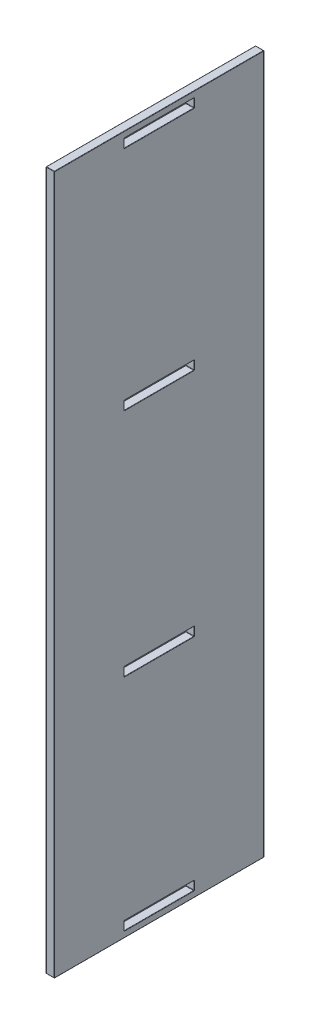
ISO-10303-21;
HEADER;
FILE_DESCRIPTION(('STEP AP214'),'2;1');
FILE_NAME('part.step','',(''),(''),'','','');
FILE_SCHEMA(('AUTOMOTIVE_DESIGN { 1 0 10303 214 1 1 1 1 }'));
ENDSEC;
DATA;
#1=APPLICATION_CONTEXT('core data for automotive mechanical design processes');
#2=APPLICATION_PROTOCOL_DEFINITION('international standard','automotive_design',2000,#1);
#3=PRODUCT_CONTEXT('',#1,'mechanical');
#4=PRODUCT('Part','Part','',(#3));
#5=PRODUCT_RELATED_PRODUCT_CATEGORY('part','',(#4));
#6=PRODUCT_DEFINITION_FORMATION('','',#4);
#7=PRODUCT_DEFINITION_CONTEXT('part definition',#1,'design');
#8=PRODUCT_DEFINITION('design','',#6,#7);
#9=PRODUCT_DEFINITION_SHAPE('','',#8);
#10=(LENGTH_UNIT() NAMED_UNIT(*) SI_UNIT(.MILLI.,.METRE.));
#11=(NAMED_UNIT(*) PLANE_ANGLE_UNIT() SI_UNIT($,.RADIAN.));
#12=(NAMED_UNIT(*) SI_UNIT($,.STERADIAN.) SOLID_ANGLE_UNIT());
#13=UNCERTAINTY_MEASURE_WITH_UNIT(LENGTH_MEASURE(1.E-05),#10,'distance_accuracy_value','');
#14=(GEOMETRIC_REPRESENTATION_CONTEXT(3) GLOBAL_UNCERTAINTY_ASSIGNED_CONTEXT((#13)) GLOBAL_UNIT_ASSIGNED_CONTEXT((#10,
#11,#12)) REPRESENTATION_CONTEXT('',''));
#15=CARTESIAN_POINT('',(0.,0.,0.));
#16=DIRECTION('',(0.,0.,1.));
#17=DIRECTION('',(1.,0.,0.));
#18=AXIS2_PLACEMENT_3D('',#15,#16,#17);
#19=CARTESIAN_POINT('',(12.,0.,0.));
#20=DIRECTION('',(1.,0.,0.));
#21=DIRECTION('',(0.,0.,-1.));
#22=AXIS2_PLACEMENT_3D('',#19,#20,#21);
#23=PLANE('',#22);
#24=CARTESIAN_POINT('',(12.,-164.25,49.4999999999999));
#25=DIRECTION('',(1.,0.,0.));
#26=DIRECTION('',(0.,0.,-1.));
#27=AXIS2_PLACEMENT_3D('',#24,#25,#26);
#28=CIRCLE('',#27,1.);
#29=CARTESIAN_POINT('',(12.,-163.25,49.4999999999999));
#30=VERTEX_POINT('',#29);
#31=CARTESIAN_POINT('',(12.,-164.25,50.4999999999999));
#32=VERTEX_POINT('',#31);
#33=EDGE_CURVE('E837',#30,#32,#28,.T.);
#34=ORIENTED_EDGE('',*,*,#33,.F.);
#35=DIRECTION('',(0.,0.,1.));
#36=VECTOR('',#35,1.);
#37=CARTESIAN_POINT('',(12.,-163.25,0.));
#38=LINE('',#37,#36);
#39=CARTESIAN_POINT('',(12.,-163.25,-49.5000000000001));
#40=VERTEX_POINT('',#39);
#41=EDGE_CURVE('E845',#30,#40,#38,.F.);
#42=ORIENTED_EDGE('',*,*,#41,.T.);
#43=CARTESIAN_POINT('',(12.,-164.25,-49.5000000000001));
#44=DIRECTION('',(1.,0.,0.));
#45=DIRECTION('',(0.,0.,-1.));
#46=AXIS2_PLACEMENT_3D('',#43,#44,#45);
#47=CIRCLE('',#46,1.);
#48=CARTESIAN_POINT('',(12.,-164.25,-50.5000000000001));
#49=VERTEX_POINT('',#48);
#50=EDGE_CURVE('E841',#49,#40,#47,.T.);
#51=ORIENTED_EDGE('',*,*,#50,.F.);
#52=DIRECTION('',(0.,1.,0.));
#53=VECTOR('',#52,1.);
#54=CARTESIAN_POINT('',(12.,0.,-50.5000000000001));
#55=LINE('',#54,#53);
#56=CARTESIAN_POINT('',(12.,-175.75,-50.5000000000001));
#57=VERTEX_POINT('',#56);
#58=EDGE_CURVE('E833',#49,#57,#55,.F.);
#59=ORIENTED_EDGE('',*,*,#58,.T.);
#60=CARTESIAN_POINT('',(12.,-175.75,-49.5000000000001));
#61=DIRECTION('',(1.,0.,0.));
#62=DIRECTION('',(0.,0.,-1.));
#63=AXIS2_PLACEMENT_3D('',#60,#61,#62);
#64=CIRCLE('',#63,1.);
#65=CARTESIAN_POINT('',(12.,-176.75,-49.5000000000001));
#66=VERTEX_POINT('',#65);
#67=EDGE_CURVE('E830',#66,#57,#64,.T.);
#68=ORIENTED_EDGE('',*,*,#67,.F.);
#69=DIRECTION('',(0.,0.,-1.));
#70=VECTOR('',#69,1.);
#71=CARTESIAN_POINT('',(12.,-176.75,0.));
#72=LINE('',#71,#70);
#73=CARTESIAN_POINT('',(12.,-176.75,49.4999999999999));
#74=VERTEX_POINT('',#73);
#75=EDGE_CURVE('E824',#66,#74,#72,.F.);
#76=ORIENTED_EDGE('',*,*,#75,.T.);
#77=CARTESIAN_POINT('',(12.,-175.75,49.4999999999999));
#78=DIRECTION('',(1.,0.,0.));
#79=DIRECTION('',(0.,0.,-1.));
#80=AXIS2_PLACEMENT_3D('',#77,#78,#79);
#81=CIRCLE('',#80,1.);
#82=CARTESIAN_POINT('',(12.,-175.75,50.4999999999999));
#83=VERTEX_POINT('',#82);
#84=EDGE_CURVE('E820',#83,#74,#81,.T.);
#85=ORIENTED_EDGE('',*,*,#84,.F.);
#86=DIRECTION('',(0.,-1.,0.));
#87=VECTOR('',#86,1.);
#88=CARTESIAN_POINT('',(12.,0.,50.4999999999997));
#89=LINE('',#88,#87);
#90=EDGE_CURVE('E827',#83,#32,#89,.F.);
#91=ORIENTED_EDGE('',*,*,#90,.T.);
#92=EDGE_LOOP('',(#34,#42,#51,#59,#68,#76,#85,#91));
#93=FACE_BOUND('',#92,.T.);
#94=CARTESIAN_POINT('',(12.,165.75,49.4999999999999));
#95=DIRECTION('',(1.,0.,0.));
#96=DIRECTION('',(0.,0.,-1.));
#97=AXIS2_PLACEMENT_3D('',#94,#95,#96);
#98=CIRCLE('',#97,1.);
#99=CARTESIAN_POINT('',(12.,166.75,49.4999999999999));
#100=VERTEX_POINT('',#99);
#101=CARTESIAN_POINT('',(12.,165.75,50.4999999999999));
#102=VERTEX_POINT('',#101);
#103=EDGE_CURVE('E809',#100,#102,#98,.T.);
#104=ORIENTED_EDGE('',*,*,#103,.F.);
#105=DIRECTION('',(0.,0.,1.));
#106=VECTOR('',#105,1.);
#107=CARTESIAN_POINT('',(12.,166.75,0.));
#108=LINE('',#107,#106);
#109=CARTESIAN_POINT('',(12.,166.75,-49.5000000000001));
#110=VERTEX_POINT('',#109);
#111=EDGE_CURVE('E817',#100,#110,#108,.F.);
#112=ORIENTED_EDGE('',*,*,#111,.T.);
#113=CARTESIAN_POINT('',(12.,165.75,-49.5000000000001));
#114=DIRECTION('',(1.,0.,0.));
#115=DIRECTION('',(0.,0.,-1.));
#116=AXIS2_PLACEMENT_3D('',#113,#114,#115);
#117=CIRCLE('',#116,1.);
#118=CARTESIAN_POINT('',(12.,165.75,-50.5000000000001));
#119=VERTEX_POINT('',#118);
#120=EDGE_CURVE('E813',#119,#110,#117,.T.);
#121=ORIENTED_EDGE('',*,*,#120,.F.);
#122=DIRECTION('',(0.,1.,0.));
#123=VECTOR('',#122,1.);
#124=CARTESIAN_POINT('',(12.,0.,-50.5000000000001));
#125=LINE('',#124,#123);
#126=CARTESIAN_POINT('',(12.,154.25,-50.5000000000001));
#127=VERTEX_POINT('',#126);
#128=EDGE_CURVE('E805',#119,#127,#125,.F.);
#129=ORIENTED_EDGE('',*,*,#128,.T.);
#130=CARTESIAN_POINT('',(12.,154.25,-49.5000000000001));
#131=DIRECTION('',(1.,0.,0.));
#132=DIRECTION('',(0.,0.,-1.));
#133=AXIS2_PLACEMENT_3D('',#130,#131,#132);
#134=CIRCLE('',#133,1.);
#135=CARTESIAN_POINT('',(12.,153.25,-49.5000000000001));
#136=VERTEX_POINT('',#135);
#137=EDGE_CURVE('E802',#136,#127,#134,.T.);
#138=ORIENTED_EDGE('',*,*,#137,.F.);
#139=DIRECTION('',(0.,0.,-1.));
#140=VECTOR('',#139,1.);
#141=CARTESIAN_POINT('',(12.,153.25,0.));
#142=LINE('',#141,#140);
#143=CARTESIAN_POINT('',(12.,153.25,49.4999999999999));
#144=VERTEX_POINT('',#143);
#145=EDGE_CURVE('E796',#136,#144,#142,.F.);
#146=ORIENTED_EDGE('',*,*,#145,.T.);
#147=CARTESIAN_POINT('',(12.,154.25,49.4999999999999));
#148=DIRECTION('',(1.,0.,0.));
#149=DIRECTION('',(0.,0.,-1.));
#150=AXIS2_PLACEMENT_3D('',#147,#148,#149);
#151=CIRCLE('',#150,1.);
#152=CARTESIAN_POINT('',(12.,154.25,50.4999999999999));
#153=VERTEX_POINT('',#152);
#154=EDGE_CURVE('E792',#153,#144,#151,.T.);
#155=ORIENTED_EDGE('',*,*,#154,.F.);
#156=DIRECTION('',(0.,-1.,0.));
#157=VECTOR('',#156,1.);
#158=CARTESIAN_POINT('',(12.,0.,50.4999999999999));
#159=LINE('',#158,#157);
#160=EDGE_CURVE('E799',#153,#102,#159,.F.);
#161=ORIENTED_EDGE('',*,*,#160,.T.);
#162=EDGE_LOOP('',(#104,#112,#121,#129,#138,#146,#155,#161));
#163=FACE_BOUND('',#162,.T.);
#164=CARTESIAN_POINT('',(12.,-490.75,-49.5));
#165=DIRECTION('',(1.,0.,0.));
#166=DIRECTION('',(0.,0.,-1.));
#167=AXIS2_PLACEMENT_3D('',#164,#165,#166);
#168=CIRCLE('',#167,1.);
#169=CARTESIAN_POINT('',(12.,-491.75,-49.5));
#170=VERTEX_POINT('',#169);
#171=CARTESIAN_POINT('',(12.,-490.75,-50.5));
#172=VERTEX_POINT('',#171);
#173=EDGE_CURVE('E781',#170,#172,#168,.T.);
#174=ORIENTED_EDGE('',*,*,#173,.F.);
#175=DIRECTION('',(0.,0.,-1.));
#176=VECTOR('',#175,1.);
#177=CARTESIAN_POINT('',(12.,-491.75,0.));
#178=LINE('',#177,#176);
#179=CARTESIAN_POINT('',(12.,-491.75,49.5));
#180=VERTEX_POINT('',#179);
#181=EDGE_CURVE('E789',#170,#180,#178,.F.);
#182=ORIENTED_EDGE('',*,*,#181,.T.);
#183=CARTESIAN_POINT('',(12.,-490.75,49.5));
#184=DIRECTION('',(1.,0.,0.));
#185=DIRECTION('',(0.,0.,-1.));
#186=AXIS2_PLACEMENT_3D('',#183,#184,#185);
#187=CIRCLE('',#186,1.);
#188=CARTESIAN_POINT('',(12.,-490.75,50.5));
#189=VERTEX_POINT('',#188);
#190=EDGE_CURVE('E785',#189,#180,#187,.T.);
#191=ORIENTED_EDGE('',*,*,#190,.F.);
#192=DIRECTION('',(0.,-1.,0.));
#193=VECTOR('',#192,1.);
#194=CARTESIAN_POINT('',(12.,0.,50.5));
#195=LINE('',#194,#193);
#196=CARTESIAN_POINT('',(12.,-479.25,50.5));
#197=VERTEX_POINT('',#196);
#198=EDGE_CURVE('E777',#189,#197,#195,.F.);
#199=ORIENTED_EDGE('',*,*,#198,.T.);
#200=CARTESIAN_POINT('',(12.,-479.25,49.5));
#201=DIRECTION('',(1.,0.,0.));
#202=DIRECTION('',(0.,0.,-1.));
#203=AXIS2_PLACEMENT_3D('',#200,#201,#202);
#204=CIRCLE('',#203,1.);
#205=CARTESIAN_POINT('',(12.,-478.25,49.5));
#206=VERTEX_POINT('',#205);
#207=EDGE_CURVE('E774',#206,#197,#204,.T.);
#208=ORIENTED_EDGE('',*,*,#207,.F.);
#209=DIRECTION('',(0.,0.,1.));
#210=VECTOR('',#209,1.);
#211=CARTESIAN_POINT('',(12.,-478.25,0.));
#212=LINE('',#211,#210);
#213=CARTESIAN_POINT('',(12.,-478.25,-49.5));
#214=VERTEX_POINT('',#213);
#215=EDGE_CURVE('E768',#206,#214,#212,.F.);
#216=ORIENTED_EDGE('',*,*,#215,.T.);
#217=CARTESIAN_POINT('',(12.,-479.25,-49.5));
#218=DIRECTION('',(1.,0.,0.));
#219=DIRECTION('',(0.,0.,-1.));
#220=AXIS2_PLACEMENT_3D('',#217,#218,#219);
#221=CIRCLE('',#220,1.);
#222=CARTESIAN_POINT('',(12.,-479.25,-50.5));
#223=VERTEX_POINT('',#222);
#224=EDGE_CURVE('E764',#223,#214,#221,.T.);
#225=ORIENTED_EDGE('',*,*,#224,.F.);
#226=DIRECTION('',(0.,1.,0.));
#227=VECTOR('',#226,1.);
#228=CARTESIAN_POINT('',(12.,0.,-50.5));
#229=LINE('',#228,#227);
#230=EDGE_CURVE('E771',#223,#172,#229,.F.);
#231=ORIENTED_EDGE('',*,*,#230,.T.);
#232=EDGE_LOOP('',(#174,#182,#191,#199,#208,#216,#225,#231));
#233=FACE_BOUND('',#232,.T.);
#234=CARTESIAN_POINT('',(12.,490.75,49.5));
#235=DIRECTION('',(1.,0.,0.));
#236=DIRECTION('',(0.,0.,-1.));
#237=AXIS2_PLACEMENT_3D('',#234,#235,#236);
#238=CIRCLE('',#237,1.);
#239=CARTESIAN_POINT('',(12.,491.75,49.5));
#240=VERTEX_POINT('',#239);
#241=CARTESIAN_POINT('',(12.,490.75,50.5));
#242=VERTEX_POINT('',#241);
#243=EDGE_CURVE('E753',#240,#242,#238,.T.);
#244=ORIENTED_EDGE('',*,*,#243,.F.);
#245=DIRECTION('',(0.,0.,1.));
#246=VECTOR('',#245,1.);
#247=CARTESIAN_POINT('',(12.,491.75,0.));
#248=LINE('',#247,#246);
#249=CARTESIAN_POINT('',(12.,491.75,-49.5));
#250=VERTEX_POINT('',#249);
#251=EDGE_CURVE('E761',#240,#250,#248,.F.);
#252=ORIENTED_EDGE('',*,*,#251,.T.);
#253=CARTESIAN_POINT('',(12.,490.75,-49.5));
#254=DIRECTION('',(1.,0.,0.));
#255=DIRECTION('',(0.,0.,-1.));
#256=AXIS2_PLACEMENT_3D('',#253,#254,#255);
#257=CIRCLE('',#256,1.);
#258=CARTESIAN_POINT('',(12.,490.75,-50.5));
#259=VERTEX_POINT('',#258);
#260=EDGE_CURVE('E757',#259,#250,#257,.T.);
#261=ORIENTED_EDGE('',*,*,#260,.F.);
#262=DIRECTION('',(0.,1.,0.));
#263=VECTOR('',#262,1.);
#264=CARTESIAN_POINT('',(12.,0.,-50.5));
#265=LINE('',#264,#263);
#266=CARTESIAN_POINT('',(12.,479.25,-50.5));
#267=VERTEX_POINT('',#266);
#268=EDGE_CURVE('E749',#259,#267,#265,.F.);
#269=ORIENTED_EDGE('',*,*,#268,.T.);
#270=CARTESIAN_POINT('',(12.,479.25,-49.5));
#271=DIRECTION('',(1.,0.,0.));
#272=DIRECTION('',(0.,0.,-1.));
#273=AXIS2_PLACEMENT_3D('',#270,#271,#272);
#274=CIRCLE('',#273,1.);
#275=CARTESIAN_POINT('',(12.,478.25,-49.5));
#276=VERTEX_POINT('',#275);
#277=EDGE_CURVE('E746',#276,#267,#274,.T.);
#278=ORIENTED_EDGE('',*,*,#277,.F.);
#279=DIRECTION('',(0.,0.,-1.));
#280=VECTOR('',#279,1.);
#281=CARTESIAN_POINT('',(12.,478.25,0.));
#282=LINE('',#281,#280);
#283=CARTESIAN_POINT('',(12.,478.25,49.5));
#284=VERTEX_POINT('',#283);
#285=EDGE_CURVE('E740',#276,#284,#282,.F.);
#286=ORIENTED_EDGE('',*,*,#285,.T.);
#287=CARTESIAN_POINT('',(12.,479.25,49.5));
#288=DIRECTION('',(1.,0.,0.));
#289=DIRECTION('',(0.,0.,-1.));
#290=AXIS2_PLACEMENT_3D('',#287,#288,#289);
#291=CIRCLE('',#290,1.);
#292=CARTESIAN_POINT('',(12.,479.25,50.5));
#293=VERTEX_POINT('',#292);
#294=EDGE_CURVE('E736',#293,#284,#291,.T.);
#295=ORIENTED_EDGE('',*,*,#294,.F.);
#296=DIRECTION('',(0.,-1.,0.));
#297=VECTOR('',#296,1.);
#298=CARTESIAN_POINT('',(12.,0.,50.5));
#299=LINE('',#298,#297);
#300=EDGE_CURVE('E743',#293,#242,#299,.F.);
#301=ORIENTED_EDGE('',*,*,#300,.T.);
#302=EDGE_LOOP('',(#244,#252,#261,#269,#278,#286,#295,#301));
#303=FACE_BOUND('',#302,.T.);
#304=DIRECTION('',(0.,0.,-1.));
#305=VECTOR('',#304,1.);
#306=CARTESIAN_POINT('',(12.,-499.5,-150.));
#307=LINE('',#306,#305);
#308=CARTESIAN_POINT('',(12.,-499.5,149.5));
#309=VERTEX_POINT('',#308);
#310=CARTESIAN_POINT('',(12.,-499.5,-149.5));
#311=VERTEX_POINT('',#310);
#312=EDGE_CURVE('E723',#309,#311,#307,.T.);
#313=ORIENTED_EDGE('',*,*,#312,.T.);
#314=DIRECTION('',(0.,1.,0.));
#315=VECTOR('',#314,1.);
#316=CARTESIAN_POINT('',(12.,500.,-149.5));
#317=LINE('',#316,#315);
#318=CARTESIAN_POINT('',(12.,499.5,-149.5));
#319=VERTEX_POINT('',#318);
#320=EDGE_CURVE('E732',#311,#319,#317,.T.);
#321=ORIENTED_EDGE('',*,*,#320,.T.);
#322=DIRECTION('',(0.,0.,1.));
#323=VECTOR('',#322,1.);
#324=CARTESIAN_POINT('',(12.,499.5,150.));
#325=LINE('',#324,#323);
#326=CARTESIAN_POINT('',(12.,499.5,149.5));
#327=VERTEX_POINT('',#326);
#328=EDGE_CURVE('E729',#319,#327,#325,.T.);
#329=ORIENTED_EDGE('',*,*,#328,.T.);
#330=DIRECTION('',(0.,-1.,0.));
#331=VECTOR('',#330,1.);
#332=CARTESIAN_POINT('',(12.,-500.,149.5));
#333=LINE('',#332,#331);
#334=EDGE_CURVE('E726',#327,#309,#333,.T.);
#335=ORIENTED_EDGE('',*,*,#334,.T.);
#336=EDGE_LOOP('',(#313,#321,#329,#335));
#337=FACE_BOUND('',#336,.T.);
#338=ADVANCED_FACE('F38',(#93,#163,#233,#303,#337),#23,.T.);
#339=CARTESIAN_POINT('',(0.,0.,0.));
#340=DIRECTION('',(1.,0.,0.));
#341=DIRECTION('',(0.,0.,-1.));
#342=AXIS2_PLACEMENT_3D('',#339,#340,#341);
#343=PLANE('',#342);
#344=CARTESIAN_POINT('',(0.,-175.75,-49.5000000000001));
#345=DIRECTION('',(1.,0.,0.));
#346=DIRECTION('',(0.,0.,-1.));
#347=AXIS2_PLACEMENT_3D('',#344,#345,#346);
#348=CIRCLE('',#347,1.);
#349=CARTESIAN_POINT('',(0.,-175.75,-50.5000000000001));
#350=VERTEX_POINT('',#349);
#351=CARTESIAN_POINT('',(0.,-176.75,-49.5000000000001));
#352=VERTEX_POINT('',#351);
#353=EDGE_CURVE('E642',#350,#352,#348,.F.);
#354=ORIENTED_EDGE('',*,*,#353,.F.);
#355=DIRECTION('',(0.,1.,0.));
#356=VECTOR('',#355,1.);
#357=CARTESIAN_POINT('',(0.,-163.75,-50.5000000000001));
#358=LINE('',#357,#356);
#359=CARTESIAN_POINT('',(0.,-164.25,-50.5000000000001));
#360=VERTEX_POINT('',#359);
#361=EDGE_CURVE('E667',#350,#360,#358,.T.);
#362=ORIENTED_EDGE('',*,*,#361,.T.);
#363=CARTESIAN_POINT('',(0.,-164.25,-49.5000000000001));
#364=DIRECTION('',(1.,0.,0.));
#365=DIRECTION('',(0.,0.,-1.));
#366=AXIS2_PLACEMENT_3D('',#363,#364,#365);
#367=CIRCLE('',#366,1.);
#368=CARTESIAN_POINT('',(0.,-163.25,-49.5000000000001));
#369=VERTEX_POINT('',#368);
#370=EDGE_CURVE('E663',#369,#360,#367,.F.);
#371=ORIENTED_EDGE('',*,*,#370,.F.);
#372=DIRECTION('',(0.,0.,1.));
#373=VECTOR('',#372,1.);
#374=CARTESIAN_POINT('',(0.,-163.25,49.9999999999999));
#375=LINE('',#374,#373);
#376=CARTESIAN_POINT('',(0.,-163.25,49.4999999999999));
#377=VERTEX_POINT('',#376);
#378=EDGE_CURVE('E660',#369,#377,#375,.T.);
#379=ORIENTED_EDGE('',*,*,#378,.T.);
#380=CARTESIAN_POINT('',(0.,-164.25,49.4999999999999));
#381=DIRECTION('',(1.,0.,0.));
#382=DIRECTION('',(0.,0.,-1.));
#383=AXIS2_PLACEMENT_3D('',#380,#381,#382);
#384=CIRCLE('',#383,1.);
#385=CARTESIAN_POINT('',(0.,-164.25,50.4999999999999));
#386=VERTEX_POINT('',#385);
#387=EDGE_CURVE('E656',#386,#377,#384,.F.);
#388=ORIENTED_EDGE('',*,*,#387,.F.);
#389=DIRECTION('',(0.,-1.,0.));
#390=VECTOR('',#389,1.);
#391=CARTESIAN_POINT('',(0.,-176.25,50.4999999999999));
#392=LINE('',#391,#390);
#393=CARTESIAN_POINT('',(0.,-175.75,50.4999999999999));
#394=VERTEX_POINT('',#393);
#395=EDGE_CURVE('E653',#386,#394,#392,.T.);
#396=ORIENTED_EDGE('',*,*,#395,.T.);
#397=CARTESIAN_POINT('',(0.,-175.75,49.4999999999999));
#398=DIRECTION('',(1.,0.,0.));
#399=DIRECTION('',(0.,0.,-1.));
#400=AXIS2_PLACEMENT_3D('',#397,#398,#399);
#401=CIRCLE('',#400,1.);
#402=CARTESIAN_POINT('',(0.,-176.75,49.4999999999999));
#403=VERTEX_POINT('',#402);
#404=EDGE_CURVE('E649',#403,#394,#401,.F.);
#405=ORIENTED_EDGE('',*,*,#404,.F.);
#406=DIRECTION('',(0.,0.,-1.));
#407=VECTOR('',#406,1.);
#408=CARTESIAN_POINT('',(0.,-176.75,-50.0000000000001));
#409=LINE('',#408,#407);
#410=EDGE_CURVE('E646',#403,#352,#409,.T.);
#411=ORIENTED_EDGE('',*,*,#410,.T.);
#412=EDGE_LOOP('',(#354,#362,#371,#379,#388,#396,#405,#411));
#413=FACE_BOUND('',#412,.T.);
#414=CARTESIAN_POINT('',(0.,154.25,-49.5000000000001));
#415=DIRECTION('',(1.,0.,0.));
#416=DIRECTION('',(0.,0.,-1.));
#417=AXIS2_PLACEMENT_3D('',#414,#415,#416);
#418=CIRCLE('',#417,1.);
#419=CARTESIAN_POINT('',(0.,154.25,-50.5000000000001));
#420=VERTEX_POINT('',#419);
#421=CARTESIAN_POINT('',(0.,153.25,-49.5000000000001));
#422=VERTEX_POINT('',#421);
#423=EDGE_CURVE('E613',#420,#422,#418,.F.);
#424=ORIENTED_EDGE('',*,*,#423,.F.);
#425=DIRECTION('',(0.,1.,0.));
#426=VECTOR('',#425,1.);
#427=CARTESIAN_POINT('',(0.,166.25,-50.5000000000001));
#428=LINE('',#427,#426);
#429=CARTESIAN_POINT('',(0.,165.75,-50.5000000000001));
#430=VERTEX_POINT('',#429);
#431=EDGE_CURVE('E638',#420,#430,#428,.T.);
#432=ORIENTED_EDGE('',*,*,#431,.T.);
#433=CARTESIAN_POINT('',(0.,165.75,-49.5000000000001));
#434=DIRECTION('',(1.,0.,0.));
#435=DIRECTION('',(0.,0.,-1.));
#436=AXIS2_PLACEMENT_3D('',#433,#434,#435);
#437=CIRCLE('',#436,1.);
#438=CARTESIAN_POINT('',(0.,166.75,-49.5000000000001));
#439=VERTEX_POINT('',#438);
#440=EDGE_CURVE('E634',#439,#430,#437,.F.);
#441=ORIENTED_EDGE('',*,*,#440,.F.);
#442=DIRECTION('',(0.,0.,1.));
#443=VECTOR('',#442,1.);
#444=CARTESIAN_POINT('',(0.,166.75,49.9999999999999));
#445=LINE('',#444,#443);
#446=CARTESIAN_POINT('',(0.,166.75,49.4999999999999));
#447=VERTEX_POINT('',#446);
#448=EDGE_CURVE('E631',#439,#447,#445,.T.);
#449=ORIENTED_EDGE('',*,*,#448,.T.);
#450=CARTESIAN_POINT('',(0.,165.75,49.4999999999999));
#451=DIRECTION('',(1.,0.,0.));
#452=DIRECTION('',(0.,0.,-1.));
#453=AXIS2_PLACEMENT_3D('',#450,#451,#452);
#454=CIRCLE('',#453,1.);
#455=CARTESIAN_POINT('',(0.,165.75,50.4999999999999));
#456=VERTEX_POINT('',#455);
#457=EDGE_CURVE('E627',#456,#447,#454,.F.);
#458=ORIENTED_EDGE('',*,*,#457,.F.);
#459=DIRECTION('',(0.,-1.,0.));
#460=VECTOR('',#459,1.);
#461=CARTESIAN_POINT('',(0.,153.75,50.4999999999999));
#462=LINE('',#461,#460);
#463=CARTESIAN_POINT('',(0.,154.25,50.4999999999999));
#464=VERTEX_POINT('',#463);
#465=EDGE_CURVE('E624',#456,#464,#462,.T.);
#466=ORIENTED_EDGE('',*,*,#465,.T.);
#467=CARTESIAN_POINT('',(0.,154.25,49.4999999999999));
#468=DIRECTION('',(1.,0.,0.));
#469=DIRECTION('',(0.,0.,-1.));
#470=AXIS2_PLACEMENT_3D('',#467,#468,#469);
#471=CIRCLE('',#470,1.);
#472=CARTESIAN_POINT('',(0.,153.25,49.4999999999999));
#473=VERTEX_POINT('',#472);
#474=EDGE_CURVE('E620',#473,#464,#471,.F.);
#475=ORIENTED_EDGE('',*,*,#474,.F.);
#476=DIRECTION('',(0.,0.,-1.));
#477=VECTOR('',#476,1.);
#478=CARTESIAN_POINT('',(0.,153.25,-50.0000000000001));
#479=LINE('',#478,#477);
#480=EDGE_CURVE('E617',#473,#422,#479,.T.);
#481=ORIENTED_EDGE('',*,*,#480,.T.);
#482=EDGE_LOOP('',(#424,#432,#441,#449,#458,#466,#475,#481));
#483=FACE_BOUND('',#482,.T.);
#484=CARTESIAN_POINT('',(0.,-479.25,49.5));
#485=DIRECTION('',(1.,0.,0.));
#486=DIRECTION('',(0.,0.,-1.));
#487=AXIS2_PLACEMENT_3D('',#484,#485,#486);
#488=CIRCLE('',#487,1.);
#489=CARTESIAN_POINT('',(0.,-479.25,50.5));
#490=VERTEX_POINT('',#489);
#491=CARTESIAN_POINT('',(0.,-478.25,49.5));
#492=VERTEX_POINT('',#491);
#493=EDGE_CURVE('E584',#490,#492,#488,.F.);
#494=ORIENTED_EDGE('',*,*,#493,.F.);
#495=DIRECTION('',(0.,-1.,0.));
#496=VECTOR('',#495,1.);
#497=CARTESIAN_POINT('',(0.,-491.25,50.5));
#498=LINE('',#497,#496);
#499=CARTESIAN_POINT('',(0.,-490.75,50.5));
#500=VERTEX_POINT('',#499);
#501=EDGE_CURVE('E609',#490,#500,#498,.T.);
#502=ORIENTED_EDGE('',*,*,#501,.T.);
#503=CARTESIAN_POINT('',(0.,-490.75,49.5));
#504=DIRECTION('',(1.,0.,0.));
#505=DIRECTION('',(0.,0.,-1.));
#506=AXIS2_PLACEMENT_3D('',#503,#504,#505);
#507=CIRCLE('',#506,1.);
#508=CARTESIAN_POINT('',(0.,-491.75,49.5));
#509=VERTEX_POINT('',#508);
#510=EDGE_CURVE('E605',#509,#500,#507,.F.);
#511=ORIENTED_EDGE('',*,*,#510,.F.);
#512=DIRECTION('',(0.,0.,-1.));
#513=VECTOR('',#512,1.);
#514=CARTESIAN_POINT('',(0.,-491.75,-50.));
#515=LINE('',#514,#513);
#516=CARTESIAN_POINT('',(0.,-491.75,-49.5));
#517=VERTEX_POINT('',#516);
#518=EDGE_CURVE('E602',#509,#517,#515,.T.);
#519=ORIENTED_EDGE('',*,*,#518,.T.);
#520=CARTESIAN_POINT('',(0.,-490.75,-49.5));
#521=DIRECTION('',(1.,0.,0.));
#522=DIRECTION('',(0.,0.,-1.));
#523=AXIS2_PLACEMENT_3D('',#520,#521,#522);
#524=CIRCLE('',#523,1.);
#525=CARTESIAN_POINT('',(0.,-490.75,-50.5));
#526=VERTEX_POINT('',#525);
#527=EDGE_CURVE('E598',#526,#517,#524,.F.);
#528=ORIENTED_EDGE('',*,*,#527,.F.);
#529=DIRECTION('',(0.,1.,0.));
#530=VECTOR('',#529,1.);
#531=CARTESIAN_POINT('',(0.,-478.75,-50.5));
#532=LINE('',#531,#530);
#533=CARTESIAN_POINT('',(0.,-479.25,-50.5));
#534=VERTEX_POINT('',#533);
#535=EDGE_CURVE('E595',#526,#534,#532,.T.);
#536=ORIENTED_EDGE('',*,*,#535,.T.);
#537=CARTESIAN_POINT('',(0.,-479.25,-49.5));
#538=DIRECTION('',(1.,0.,0.));
#539=DIRECTION('',(0.,0.,-1.));
#540=AXIS2_PLACEMENT_3D('',#537,#538,#539);
#541=CIRCLE('',#540,1.);
#542=CARTESIAN_POINT('',(0.,-478.25,-49.5));
#543=VERTEX_POINT('',#542);
#544=EDGE_CURVE('E591',#543,#534,#541,.F.);
#545=ORIENTED_EDGE('',*,*,#544,.F.);
#546=DIRECTION('',(0.,0.,1.));
#547=VECTOR('',#546,1.);
#548=CARTESIAN_POINT('',(0.,-478.25,50.));
#549=LINE('',#548,#547);
#550=EDGE_CURVE('E588',#543,#492,#549,.T.);
#551=ORIENTED_EDGE('',*,*,#550,.T.);
#552=EDGE_LOOP('',(#494,#502,#511,#519,#528,#536,#545,#551));
#553=FACE_BOUND('',#552,.T.);
#554=CARTESIAN_POINT('',(0.,479.25,-49.5));
#555=DIRECTION('',(1.,0.,0.));
#556=DIRECTION('',(0.,0.,-1.));
#557=AXIS2_PLACEMENT_3D('',#554,#555,#556);
#558=CIRCLE('',#557,1.);
#559=CARTESIAN_POINT('',(0.,479.25,-50.5));
#560=VERTEX_POINT('',#559);
#561=CARTESIAN_POINT('',(0.,478.25,-49.5));
#562=VERTEX_POINT('',#561);
#563=EDGE_CURVE('E550',#560,#562,#558,.F.);
#564=ORIENTED_EDGE('',*,*,#563,.F.);
#565=DIRECTION('',(0.,1.,0.));
#566=VECTOR('',#565,1.);
#567=CARTESIAN_POINT('',(0.,491.25,-50.5));
#568=LINE('',#567,#566);
#569=CARTESIAN_POINT('',(0.,490.75,-50.5));
#570=VERTEX_POINT('',#569);
#571=EDGE_CURVE('E580',#560,#570,#568,.T.);
#572=ORIENTED_EDGE('',*,*,#571,.T.);
#573=CARTESIAN_POINT('',(0.,490.75,-49.5));
#574=DIRECTION('',(1.,0.,0.));
#575=DIRECTION('',(0.,0.,-1.));
#576=AXIS2_PLACEMENT_3D('',#573,#574,#575);
#577=CIRCLE('',#576,1.);
#578=CARTESIAN_POINT('',(0.,491.75,-49.5));
#579=VERTEX_POINT('',#578);
#580=EDGE_CURVE('E576',#579,#570,#577,.F.);
#581=ORIENTED_EDGE('',*,*,#580,.F.);
#582=DIRECTION('',(0.,0.,1.));
#583=VECTOR('',#582,1.);
#584=CARTESIAN_POINT('',(0.,491.75,50.));
#585=LINE('',#584,#583);
#586=CARTESIAN_POINT('',(0.,491.75,49.5));
#587=VERTEX_POINT('',#586);
#588=EDGE_CURVE('E573',#579,#587,#585,.T.);
#589=ORIENTED_EDGE('',*,*,#588,.T.);
#590=CARTESIAN_POINT('',(0.,490.75,49.5));
#591=DIRECTION('',(1.,0.,0.));
#592=DIRECTION('',(0.,0.,-1.));
#593=AXIS2_PLACEMENT_3D('',#590,#591,#592);
#594=CIRCLE('',#593,1.);
#595=CARTESIAN_POINT('',(0.,490.75,50.5));
#596=VERTEX_POINT('',#595);
#597=EDGE_CURVE('E569',#596,#587,#594,.F.);
#598=ORIENTED_EDGE('',*,*,#597,.F.);
#599=DIRECTION('',(0.,-1.,0.));
#600=VECTOR('',#599,1.);
#601=CARTESIAN_POINT('',(0.,478.75,50.5));
#602=LINE('',#601,#600);
#603=CARTESIAN_POINT('',(0.,479.25,50.5));
#604=VERTEX_POINT('',#603);
#605=EDGE_CURVE('E566',#596,#604,#602,.T.);
#606=ORIENTED_EDGE('',*,*,#605,.T.);
#607=CARTESIAN_POINT('',(0.,479.25,49.5));
#608=DIRECTION('',(1.,0.,0.));
#609=DIRECTION('',(0.,0.,-1.));
#610=AXIS2_PLACEMENT_3D('',#607,#608,#609);
#611=CIRCLE('',#610,1.);
#612=CARTESIAN_POINT('',(0.,478.25,49.5));
#613=VERTEX_POINT('',#612);
#614=EDGE_CURVE('E562',#613,#604,#611,.F.);
#615=ORIENTED_EDGE('',*,*,#614,.F.);
#616=DIRECTION('',(0.,0.,-1.));
#617=VECTOR('',#616,1.);
#618=CARTESIAN_POINT('',(0.,478.25,-50.));
#619=LINE('',#618,#617);
#620=EDGE_CURVE('E555',#613,#562,#619,.T.);
#621=ORIENTED_EDGE('',*,*,#620,.T.);
#622=EDGE_LOOP('',(#564,#572,#581,#589,#598,#606,#615,#621));
#623=FACE_BOUND('',#622,.T.);
#624=DIRECTION('',(0.,0.,1.));
#625=VECTOR('',#624,1.);
#626=CARTESIAN_POINT('',(0.,499.5,0.));
#627=LINE('',#626,#625);
#628=CARTESIAN_POINT('',(0.,499.5,149.5));
#629=VERTEX_POINT('',#628);
#630=CARTESIAN_POINT('',(0.,499.5,-149.5));
#631=VERTEX_POINT('',#630);
#632=EDGE_CURVE('E547',#629,#631,#627,.F.);
#633=ORIENTED_EDGE('',*,*,#632,.T.);
#634=DIRECTION('',(0.,1.,0.));
#635=VECTOR('',#634,1.);
#636=CARTESIAN_POINT('',(0.,0.,-149.5));
#637=LINE('',#636,#635);
#638=CARTESIAN_POINT('',(0.,-499.5,-149.5));
#639=VERTEX_POINT('',#638);
#640=EDGE_CURVE('E518',#631,#639,#637,.F.);
#641=ORIENTED_EDGE('',*,*,#640,.T.);
#642=DIRECTION('',(0.,0.,-1.));
#643=VECTOR('',#642,1.);
#644=CARTESIAN_POINT('',(0.,-499.5,0.));
#645=LINE('',#644,#643);
#646=CARTESIAN_POINT('',(0.,-499.5,149.5));
#647=VERTEX_POINT('',#646);
#648=EDGE_CURVE('E535',#639,#647,#645,.F.);
#649=ORIENTED_EDGE('',*,*,#648,.T.);
#650=DIRECTION('',(0.,-1.,0.));
#651=VECTOR('',#650,1.);
#652=CARTESIAN_POINT('',(0.,0.,149.5));
#653=LINE('',#652,#651);
#654=EDGE_CURVE('E542',#647,#629,#653,.F.);
#655=ORIENTED_EDGE('',*,*,#654,.T.);
#656=EDGE_LOOP('',(#633,#641,#649,#655));
#657=FACE_BOUND('',#656,.T.);
#658=ADVANCED_FACE('F545',(#413,#483,#553,#623,#657),#343,.F.);
#659=CARTESIAN_POINT('',(12.,500.,-150.));
#660=DIRECTION('',(0.,0.,1.));
#661=DIRECTION('',(0.,-1.,0.));
#662=AXIS2_PLACEMENT_3D('',#659,#660,#661);
#663=PLANE('',#662);
#664=DIRECTION('',(0.,1.,0.));
#665=VECTOR('',#664,1.);
#666=CARTESIAN_POINT('',(11.5,-500.,-150.));
#667=LINE('',#666,#665);
#668=CARTESIAN_POINT('',(11.5,499.5,-150.));
#669=VERTEX_POINT('',#668);
#670=CARTESIAN_POINT('',(11.5,-499.5,-150.));
#671=VERTEX_POINT('',#670);
#672=EDGE_CURVE('E1007',#669,#671,#667,.F.);
#673=ORIENTED_EDGE('',*,*,#672,.T.);
#674=DIRECTION('',(-1.,0.,0.));
#675=VECTOR('',#674,1.);
#676=CARTESIAN_POINT('',(12.,-499.5,-150.));
#677=LINE('',#676,#675);
#678=CARTESIAN_POINT('',(0.5,-499.5,-150.));
#679=VERTEX_POINT('',#678);
#680=EDGE_CURVE('E1012',#671,#679,#677,.T.);
#681=ORIENTED_EDGE('',*,*,#680,.T.);
#682=DIRECTION('',(0.,1.,0.));
#683=VECTOR('',#682,1.);
#684=CARTESIAN_POINT('',(0.5,500.,-150.));
#685=LINE('',#684,#683);
#686=CARTESIAN_POINT('',(0.5,499.5,-150.));
#687=VERTEX_POINT('',#686);
#688=EDGE_CURVE('E521',#679,#687,#685,.T.);
#689=ORIENTED_EDGE('',*,*,#688,.T.);
#690=DIRECTION('',(-1.,0.,0.));
#691=VECTOR('',#690,1.);
#692=CARTESIAN_POINT('',(12.,499.5,-150.));
#693=LINE('',#692,#691);
#694=EDGE_CURVE('E1004',#687,#669,#693,.F.);
#695=ORIENTED_EDGE('',*,*,#694,.T.);
#696=EDGE_LOOP('',(#673,#681,#689,#695));
#697=FACE_BOUND('',#696,.T.);
#698=ADVANCED_FACE('F1555',(#697),#663,.F.);
#699=CARTESIAN_POINT('',(12.,500.,150.));
#700=DIRECTION('',(0.,-1.,0.));
#701=DIRECTION('',(0.,0.,-1.));
#702=AXIS2_PLACEMENT_3D('',#699,#700,#701);
#703=PLANE('',#702);
#704=DIRECTION('',(0.,0.,1.));
#705=VECTOR('',#704,1.);
#706=CARTESIAN_POINT('',(0.5,500.,150.));
#707=LINE('',#706,#705);
#708=CARTESIAN_POINT('',(0.5,500.,-149.5));
#709=VERTEX_POINT('',#708);
#710=CARTESIAN_POINT('',(0.5,500.,149.5));
#711=VERTEX_POINT('',#710);
#712=EDGE_CURVE('E1021',#709,#711,#707,.T.);
#713=ORIENTED_EDGE('',*,*,#712,.T.);
#714=DIRECTION('',(-1.,0.,0.));
#715=VECTOR('',#714,1.);
#716=CARTESIAN_POINT('',(12.,500.,149.5));
#717=LINE('',#716,#715);
#718=CARTESIAN_POINT('',(11.5,500.,149.5));
#719=VERTEX_POINT('',#718);
#720=EDGE_CURVE('E1025',#711,#719,#717,.F.);
#721=ORIENTED_EDGE('',*,*,#720,.T.);
#722=DIRECTION('',(0.,0.,1.));
#723=VECTOR('',#722,1.);
#724=CARTESIAN_POINT('',(11.5,500.,-150.));
#725=LINE('',#724,#723);
#726=CARTESIAN_POINT('',(11.5,500.,-149.5));
#727=VERTEX_POINT('',#726);
#728=EDGE_CURVE('E1018',#719,#727,#725,.F.);
#729=ORIENTED_EDGE('',*,*,#728,.T.);
#730=DIRECTION('',(-1.,0.,0.));
#731=VECTOR('',#730,1.);
#732=CARTESIAN_POINT('',(12.,500.,-149.5));
#733=LINE('',#732,#731);
#734=EDGE_CURVE('E1015',#727,#709,#733,.T.);
#735=ORIENTED_EDGE('',*,*,#734,.T.);
#736=EDGE_LOOP('',(#713,#721,#729,#735));
#737=FACE_BOUND('',#736,.T.);
#738=ADVANCED_FACE('F1567',(#737),#703,.F.);
#739=CARTESIAN_POINT('',(12.,500.,150.));
#740=DIRECTION('',(0.,0.,-1.));
#741=DIRECTION('',(0.,1.,0.));
#742=AXIS2_PLACEMENT_3D('',#739,#740,#741);
#743=PLANE('',#742);
#744=DIRECTION('',(0.,-1.,0.));
#745=VECTOR('',#744,1.);
#746=CARTESIAN_POINT('',(0.5,500.,150.));
#747=LINE('',#746,#745);
#748=CARTESIAN_POINT('',(0.5,499.5,150.));
#749=VERTEX_POINT('',#748);
#750=CARTESIAN_POINT('',(0.5,-499.5,150.));
#751=VERTEX_POINT('',#750);
#752=EDGE_CURVE('E1034',#749,#751,#747,.T.);
#753=ORIENTED_EDGE('',*,*,#752,.T.);
#754=DIRECTION('',(-1.,0.,0.));
#755=VECTOR('',#754,1.);
#756=CARTESIAN_POINT('',(12.,-499.5,150.));
#757=LINE('',#756,#755);
#758=CARTESIAN_POINT('',(11.5,-499.5,150.));
#759=VERTEX_POINT('',#758);
#760=EDGE_CURVE('E1038',#751,#759,#757,.F.);
#761=ORIENTED_EDGE('',*,*,#760,.T.);
#762=DIRECTION('',(0.,-1.,0.));
#763=VECTOR('',#762,1.);
#764=CARTESIAN_POINT('',(11.5,500.,150.));
#765=LINE('',#764,#763);
#766=CARTESIAN_POINT('',(11.5,499.5,150.));
#767=VERTEX_POINT('',#766);
#768=EDGE_CURVE('E1031',#759,#767,#765,.F.);
#769=ORIENTED_EDGE('',*,*,#768,.T.);
#770=DIRECTION('',(-1.,0.,0.));
#771=VECTOR('',#770,1.);
#772=CARTESIAN_POINT('',(12.,499.5,150.));
#773=LINE('',#772,#771);
#774=EDGE_CURVE('E1028',#767,#749,#773,.T.);
#775=ORIENTED_EDGE('',*,*,#774,.T.);
#776=EDGE_LOOP('',(#753,#761,#769,#775));
#777=FACE_BOUND('',#776,.T.);
#778=ADVANCED_FACE('F1530',(#777),#743,.F.);
#779=CARTESIAN_POINT('',(12.,-500.,150.));
#780=DIRECTION('',(0.,1.,0.));
#781=DIRECTION('',(0.,0.,1.));
#782=AXIS2_PLACEMENT_3D('',#779,#780,#781);
#783=PLANE('',#782);
#784=DIRECTION('',(0.,0.,-1.));
#785=VECTOR('',#784,1.);
#786=CARTESIAN_POINT('',(0.5,-500.,150.));
#787=LINE('',#786,#785);
#788=CARTESIAN_POINT('',(0.5,-500.,149.5));
#789=VERTEX_POINT('',#788);
#790=CARTESIAN_POINT('',(0.5,-500.,-149.5));
#791=VERTEX_POINT('',#790);
#792=EDGE_CURVE('E48',#789,#791,#787,.T.);
#793=ORIENTED_EDGE('',*,*,#792,.T.);
#794=DIRECTION('',(-1.,0.,0.));
#795=VECTOR('',#794,1.);
#796=CARTESIAN_POINT('',(12.,-500.,-149.5));
#797=LINE('',#796,#795);
#798=CARTESIAN_POINT('',(11.5,-500.,-149.5));
#799=VERTEX_POINT('',#798);
#800=EDGE_CURVE('E11',#791,#799,#797,.F.);
#801=ORIENTED_EDGE('',*,*,#800,.T.);
#802=DIRECTION('',(0.,0.,-1.));
#803=VECTOR('',#802,1.);
#804=CARTESIAN_POINT('',(11.5,-500.,150.));
#805=LINE('',#804,#803);
#806=CARTESIAN_POINT('',(11.5,-500.,149.5));
#807=VERTEX_POINT('',#806);
#808=EDGE_CURVE('E1044',#799,#807,#805,.F.);
#809=ORIENTED_EDGE('',*,*,#808,.T.);
#810=DIRECTION('',(-1.,0.,0.));
#811=VECTOR('',#810,1.);
#812=CARTESIAN_POINT('',(12.,-500.,149.5));
#813=LINE('',#812,#811);
#814=EDGE_CURVE('E1041',#807,#789,#813,.T.);
#815=ORIENTED_EDGE('',*,*,#814,.T.);
#816=EDGE_LOOP('',(#793,#801,#809,#815));
#817=FACE_BOUND('',#816,.T.);
#818=ADVANCED_FACE('F1503',(#817),#783,.F.);
#819=CARTESIAN_POINT('',(12.,491.25,-50.));
#820=DIRECTION('',(0.,0.,1.));
#821=DIRECTION('',(1.,0.,0.));
#822=AXIS2_PLACEMENT_3D('',#819,#820,#821);
#823=PLANE('',#822);
#824=DIRECTION('',(0.,1.,0.));
#825=VECTOR('',#824,1.);
#826=CARTESIAN_POINT('',(0.5,478.75,-50.));
#827=LINE('',#826,#825);
#828=CARTESIAN_POINT('',(0.5,490.75,-50.));
#829=VERTEX_POINT('',#828);
#830=CARTESIAN_POINT('',(0.5,479.25,-50.));
#831=VERTEX_POINT('',#830);
#832=EDGE_CURVE('E958',#829,#831,#827,.F.);
#833=ORIENTED_EDGE('',*,*,#832,.T.);
#834=DIRECTION('',(-1.,0.,0.));
#835=VECTOR('',#834,1.);
#836=CARTESIAN_POINT('',(12.,479.25,-50.));
#837=LINE('',#836,#835);
#838=CARTESIAN_POINT('',(11.5,479.25,-50.));
#839=VERTEX_POINT('',#838);
#840=EDGE_CURVE('E962',#831,#839,#837,.F.);
#841=ORIENTED_EDGE('',*,*,#840,.T.);
#842=DIRECTION('',(0.,1.,0.));
#843=VECTOR('',#842,1.);
#844=CARTESIAN_POINT('',(11.5,491.25,-50.));
#845=LINE('',#844,#843);
#846=CARTESIAN_POINT('',(11.5,490.75,-50.));
#847=VERTEX_POINT('',#846);
#848=EDGE_CURVE('E955',#839,#847,#845,.T.);
#849=ORIENTED_EDGE('',*,*,#848,.T.);
#850=DIRECTION('',(-1.,0.,0.));
#851=VECTOR('',#850,1.);
#852=CARTESIAN_POINT('',(0.,490.75,-50.));
#853=LINE('',#852,#851);
#854=EDGE_CURVE('E952',#847,#829,#853,.T.);
#855=ORIENTED_EDGE('',*,*,#854,.T.);
#856=EDGE_LOOP('',(#833,#841,#849,#855));
#857=FACE_BOUND('',#856,.T.);
#858=ADVANCED_FACE('F1560',(#857),#823,.T.);
#859=CARTESIAN_POINT('',(12.,491.25,50.));
#860=DIRECTION('',(0.,-1.,0.));
#861=DIRECTION('',(0.,0.,-1.));
#862=AXIS2_PLACEMENT_3D('',#859,#860,#861);
#863=PLANE('',#862);
#864=DIRECTION('',(0.,0.,1.));
#865=VECTOR('',#864,1.);
#866=CARTESIAN_POINT('',(11.5,491.25,50.));
#867=LINE('',#866,#865);
#868=CARTESIAN_POINT('',(11.5,491.25,-49.5));
#869=VERTEX_POINT('',#868);
#870=CARTESIAN_POINT('',(11.5,491.25,49.5));
#871=VERTEX_POINT('',#870);
#872=EDGE_CURVE('E968',#869,#871,#867,.T.);
#873=ORIENTED_EDGE('',*,*,#872,.T.);
#874=DIRECTION('',(-1.,0.,0.));
#875=VECTOR('',#874,1.);
#876=CARTESIAN_POINT('',(0.,491.25,49.5));
#877=LINE('',#876,#875);
#878=CARTESIAN_POINT('',(0.5,491.25,49.5));
#879=VERTEX_POINT('',#878);
#880=EDGE_CURVE('E975',#871,#879,#877,.T.);
#881=ORIENTED_EDGE('',*,*,#880,.T.);
#882=DIRECTION('',(0.,0.,1.));
#883=VECTOR('',#882,1.);
#884=CARTESIAN_POINT('',(0.5,491.25,-50.));
#885=LINE('',#884,#883);
#886=CARTESIAN_POINT('',(0.5,491.25,-49.5));
#887=VERTEX_POINT('',#886);
#888=EDGE_CURVE('E971',#879,#887,#885,.F.);
#889=ORIENTED_EDGE('',*,*,#888,.T.);
#890=DIRECTION('',(-1.,0.,0.));
#891=VECTOR('',#890,1.);
#892=CARTESIAN_POINT('',(12.,491.25,-49.5));
#893=LINE('',#892,#891);
#894=EDGE_CURVE('E965',#887,#869,#893,.F.);
#895=ORIENTED_EDGE('',*,*,#894,.T.);
#896=EDGE_LOOP('',(#873,#881,#889,#895));
#897=FACE_BOUND('',#896,.T.);
#898=ADVANCED_FACE('F2573',(#897),#863,.T.);
#899=CARTESIAN_POINT('',(12.,491.25,50.));
#900=DIRECTION('',(0.,0.,-1.));
#901=DIRECTION('',(-1.,0.,0.));
#902=AXIS2_PLACEMENT_3D('',#899,#900,#901);
#903=PLANE('',#902);
#904=DIRECTION('',(0.,-1.,0.));
#905=VECTOR('',#904,1.);
#906=CARTESIAN_POINT('',(11.5,491.25,50.));
#907=LINE('',#906,#905);
#908=CARTESIAN_POINT('',(11.5,490.75,50.));
#909=VERTEX_POINT('',#908);
#910=CARTESIAN_POINT('',(11.5,479.25,50.));
#911=VERTEX_POINT('',#910);
#912=EDGE_CURVE('E981',#909,#911,#907,.T.);
#913=ORIENTED_EDGE('',*,*,#912,.T.);
#914=DIRECTION('',(-1.,0.,0.));
#915=VECTOR('',#914,1.);
#916=CARTESIAN_POINT('',(0.,479.25,50.));
#917=LINE('',#916,#915);
#918=CARTESIAN_POINT('',(0.5,479.25,50.));
#919=VERTEX_POINT('',#918);
#920=EDGE_CURVE('E988',#911,#919,#917,.T.);
#921=ORIENTED_EDGE('',*,*,#920,.T.);
#922=DIRECTION('',(0.,-1.,0.));
#923=VECTOR('',#922,1.);
#924=CARTESIAN_POINT('',(0.5,491.25,50.));
#925=LINE('',#924,#923);
#926=CARTESIAN_POINT('',(0.5,490.75,50.));
#927=VERTEX_POINT('',#926);
#928=EDGE_CURVE('E984',#919,#927,#925,.F.);
#929=ORIENTED_EDGE('',*,*,#928,.T.);
#930=DIRECTION('',(-1.,0.,0.));
#931=VECTOR('',#930,1.);
#932=CARTESIAN_POINT('',(12.,490.75,50.));
#933=LINE('',#932,#931);
#934=EDGE_CURVE('E978',#927,#909,#933,.F.);
#935=ORIENTED_EDGE('',*,*,#934,.T.);
#936=EDGE_LOOP('',(#913,#921,#929,#935));
#937=FACE_BOUND('',#936,.T.);
#938=ADVANCED_FACE('F2564',(#937),#903,.T.);
#939=CARTESIAN_POINT('',(12.,478.75,50.));
#940=DIRECTION('',(0.,1.,0.));
#941=DIRECTION('',(0.,0.,1.));
#942=AXIS2_PLACEMENT_3D('',#939,#940,#941);
#943=PLANE('',#942);
#944=DIRECTION('',(0.,0.,-1.));
#945=VECTOR('',#944,1.);
#946=CARTESIAN_POINT('',(11.5,478.75,50.));
#947=LINE('',#946,#945);
#948=CARTESIAN_POINT('',(11.5,478.75,49.5));
#949=VERTEX_POINT('',#948);
#950=CARTESIAN_POINT('',(11.5,478.75,-49.5));
#951=VERTEX_POINT('',#950);
#952=EDGE_CURVE('E994',#949,#951,#947,.T.);
#953=ORIENTED_EDGE('',*,*,#952,.T.);
#954=DIRECTION('',(-1.,0.,0.));
#955=VECTOR('',#954,1.);
#956=CARTESIAN_POINT('',(0.,478.75,-49.5));
#957=LINE('',#956,#955);
#958=CARTESIAN_POINT('',(0.5,478.75,-49.5));
#959=VERTEX_POINT('',#958);
#960=EDGE_CURVE('E1001',#951,#959,#957,.T.);
#961=ORIENTED_EDGE('',*,*,#960,.T.);
#962=DIRECTION('',(0.,0.,-1.));
#963=VECTOR('',#962,1.);
#964=CARTESIAN_POINT('',(0.5,478.75,50.));
#965=LINE('',#964,#963);
#966=CARTESIAN_POINT('',(0.5,478.75,49.5));
#967=VERTEX_POINT('',#966);
#968=EDGE_CURVE('E997',#959,#967,#965,.F.);
#969=ORIENTED_EDGE('',*,*,#968,.T.);
#970=DIRECTION('',(-1.,0.,0.));
#971=VECTOR('',#970,1.);
#972=CARTESIAN_POINT('',(12.,478.75,49.5));
#973=LINE('',#972,#971);
#974=EDGE_CURVE('E991',#967,#949,#973,.F.);
#975=ORIENTED_EDGE('',*,*,#974,.T.);
#976=EDGE_LOOP('',(#953,#961,#969,#975));
#977=FACE_BOUND('',#976,.T.);
#978=ADVANCED_FACE('F2555',(#977),#943,.T.);
#979=CARTESIAN_POINT('',(12.,-491.25,50.));
#980=DIRECTION('',(0.,0.,-1.));
#981=DIRECTION('',(-1.,0.,0.));
#982=AXIS2_PLACEMENT_3D('',#979,#980,#981);
#983=PLANE('',#982);
#984=DIRECTION('',(0.,-1.,0.));
#985=VECTOR('',#984,1.);
#986=CARTESIAN_POINT('',(0.5,-478.75,50.));
#987=LINE('',#986,#985);
#988=CARTESIAN_POINT('',(0.5,-490.75,50.));
#989=VERTEX_POINT('',#988);
#990=CARTESIAN_POINT('',(0.5,-479.25,50.));
#991=VERTEX_POINT('',#990);
#992=EDGE_CURVE('E906',#989,#991,#987,.F.);
#993=ORIENTED_EDGE('',*,*,#992,.T.);
#994=DIRECTION('',(-1.,0.,0.));
#995=VECTOR('',#994,1.);
#996=CARTESIAN_POINT('',(12.,-479.25,50.));
#997=LINE('',#996,#995);
#998=CARTESIAN_POINT('',(11.5,-479.25,50.));
#999=VERTEX_POINT('',#998);
#1000=EDGE_CURVE('E910',#991,#999,#997,.F.);
#1001=ORIENTED_EDGE('',*,*,#1000,.T.);
#1002=DIRECTION('',(0.,-1.,0.));
#1003=VECTOR('',#1002,1.);
#1004=CARTESIAN_POINT('',(11.5,-491.25,50.));
#1005=LINE('',#1004,#1003);
#1006=CARTESIAN_POINT('',(11.5,-490.75,50.));
#1007=VERTEX_POINT('',#1006);
#1008=EDGE_CURVE('E903',#999,#1007,#1005,.T.);
#1009=ORIENTED_EDGE('',*,*,#1008,.T.);
#1010=DIRECTION('',(-1.,0.,0.));
#1011=VECTOR('',#1010,1.);
#1012=CARTESIAN_POINT('',(0.,-490.75,50.));
#1013=LINE('',#1012,#1011);
#1014=EDGE_CURVE('E900',#1007,#989,#1013,.T.);
#1015=ORIENTED_EDGE('',*,*,#1014,.T.);
#1016=EDGE_LOOP('',(#993,#1001,#1009,#1015));
#1017=FACE_BOUND('',#1016,.T.);
#1018=ADVANCED_FACE('F2546',(#1017),#983,.T.);
#1019=CARTESIAN_POINT('',(12.,-491.25,50.));
#1020=DIRECTION('',(0.,1.,0.));
#1021=DIRECTION('',(0.,0.,1.));
#1022=AXIS2_PLACEMENT_3D('',#1019,#1020,#1021);
#1023=PLANE('',#1022);
#1024=DIRECTION('',(0.,0.,-1.));
#1025=VECTOR('',#1024,1.);
#1026=CARTESIAN_POINT('',(11.5,-491.25,50.));
#1027=LINE('',#1026,#1025);
#1028=CARTESIAN_POINT('',(11.5,-491.25,49.5));
#1029=VERTEX_POINT('',#1028);
#1030=CARTESIAN_POINT('',(11.5,-491.25,-49.5));
#1031=VERTEX_POINT('',#1030);
#1032=EDGE_CURVE('E916',#1029,#1031,#1027,.T.);
#1033=ORIENTED_EDGE('',*,*,#1032,.T.);
#1034=DIRECTION('',(-1.,0.,0.));
#1035=VECTOR('',#1034,1.);
#1036=CARTESIAN_POINT('',(0.,-491.25,-49.5));
#1037=LINE('',#1036,#1035);
#1038=CARTESIAN_POINT('',(0.5,-491.25,-49.5));
#1039=VERTEX_POINT('',#1038);
#1040=EDGE_CURVE('E923',#1031,#1039,#1037,.T.);
#1041=ORIENTED_EDGE('',*,*,#1040,.T.);
#1042=DIRECTION('',(0.,0.,-1.));
#1043=VECTOR('',#1042,1.);
#1044=CARTESIAN_POINT('',(0.5,-491.25,50.));
#1045=LINE('',#1044,#1043);
#1046=CARTESIAN_POINT('',(0.5,-491.25,49.5));
#1047=VERTEX_POINT('',#1046);
#1048=EDGE_CURVE('E919',#1039,#1047,#1045,.F.);
#1049=ORIENTED_EDGE('',*,*,#1048,.T.);
#1050=DIRECTION('',(-1.,0.,0.));
#1051=VECTOR('',#1050,1.);
#1052=CARTESIAN_POINT('',(12.,-491.25,49.5));
#1053=LINE('',#1052,#1051);
#1054=EDGE_CURVE('E913',#1047,#1029,#1053,.F.);
#1055=ORIENTED_EDGE('',*,*,#1054,.T.);
#1056=EDGE_LOOP('',(#1033,#1041,#1049,#1055));
#1057=FACE_BOUND('',#1056,.T.);
#1058=ADVANCED_FACE('F2537',(#1057),#1023,.T.);
#1059=CARTESIAN_POINT('',(12.,-491.25,-50.));
#1060=DIRECTION('',(0.,0.,1.));
#1061=DIRECTION('',(1.,0.,0.));
#1062=AXIS2_PLACEMENT_3D('',#1059,#1060,#1061);
#1063=PLANE('',#1062);
#1064=DIRECTION('',(0.,1.,0.));
#1065=VECTOR('',#1064,1.);
#1066=CARTESIAN_POINT('',(11.5,-491.25,-50.));
#1067=LINE('',#1066,#1065);
#1068=CARTESIAN_POINT('',(11.5,-490.75,-50.));
#1069=VERTEX_POINT('',#1068);
#1070=CARTESIAN_POINT('',(11.5,-479.25,-50.));
#1071=VERTEX_POINT('',#1070);
#1072=EDGE_CURVE('E929',#1069,#1071,#1067,.T.);
#1073=ORIENTED_EDGE('',*,*,#1072,.T.);
#1074=DIRECTION('',(-1.,0.,0.));
#1075=VECTOR('',#1074,1.);
#1076=CARTESIAN_POINT('',(0.,-479.25,-50.));
#1077=LINE('',#1076,#1075);
#1078=CARTESIAN_POINT('',(0.5,-479.25,-50.));
#1079=VERTEX_POINT('',#1078);
#1080=EDGE_CURVE('E936',#1071,#1079,#1077,.T.);
#1081=ORIENTED_EDGE('',*,*,#1080,.T.);
#1082=DIRECTION('',(0.,1.,0.));
#1083=VECTOR('',#1082,1.);
#1084=CARTESIAN_POINT('',(0.5,-491.25,-50.));
#1085=LINE('',#1084,#1083);
#1086=CARTESIAN_POINT('',(0.5,-490.75,-50.));
#1087=VERTEX_POINT('',#1086);
#1088=EDGE_CURVE('E932',#1079,#1087,#1085,.F.);
#1089=ORIENTED_EDGE('',*,*,#1088,.T.);
#1090=DIRECTION('',(-1.,0.,0.));
#1091=VECTOR('',#1090,1.);
#1092=CARTESIAN_POINT('',(12.,-490.75,-50.));
#1093=LINE('',#1092,#1091);
#1094=EDGE_CURVE('E926',#1087,#1069,#1093,.F.);
#1095=ORIENTED_EDGE('',*,*,#1094,.T.);
#1096=EDGE_LOOP('',(#1073,#1081,#1089,#1095));
#1097=FACE_BOUND('',#1096,.T.);
#1098=ADVANCED_FACE('F2528',(#1097),#1063,.T.);
#1099=CARTESIAN_POINT('',(12.,-478.75,50.));
#1100=DIRECTION('',(0.,-1.,0.));
#1101=DIRECTION('',(0.,0.,-1.));
#1102=AXIS2_PLACEMENT_3D('',#1099,#1100,#1101);
#1103=PLANE('',#1102);
#1104=DIRECTION('',(0.,0.,1.));
#1105=VECTOR('',#1104,1.);
#1106=CARTESIAN_POINT('',(11.5,-478.75,50.));
#1107=LINE('',#1106,#1105);
#1108=CARTESIAN_POINT('',(11.5,-478.75,-49.5));
#1109=VERTEX_POINT('',#1108);
#1110=CARTESIAN_POINT('',(11.5,-478.75,49.5));
#1111=VERTEX_POINT('',#1110);
#1112=EDGE_CURVE('E942',#1109,#1111,#1107,.T.);
#1113=ORIENTED_EDGE('',*,*,#1112,.T.);
#1114=DIRECTION('',(-1.,0.,0.));
#1115=VECTOR('',#1114,1.);
#1116=CARTESIAN_POINT('',(0.,-478.75,49.5));
#1117=LINE('',#1116,#1115);
#1118=CARTESIAN_POINT('',(0.5,-478.75,49.5));
#1119=VERTEX_POINT('',#1118);
#1120=EDGE_CURVE('E949',#1111,#1119,#1117,.T.);
#1121=ORIENTED_EDGE('',*,*,#1120,.T.);
#1122=DIRECTION('',(0.,0.,1.));
#1123=VECTOR('',#1122,1.);
#1124=CARTESIAN_POINT('',(0.5,-478.75,-50.));
#1125=LINE('',#1124,#1123);
#1126=CARTESIAN_POINT('',(0.5,-478.75,-49.5));
#1127=VERTEX_POINT('',#1126);
#1128=EDGE_CURVE('E945',#1119,#1127,#1125,.F.);
#1129=ORIENTED_EDGE('',*,*,#1128,.T.);
#1130=DIRECTION('',(-1.,0.,0.));
#1131=VECTOR('',#1130,1.);
#1132=CARTESIAN_POINT('',(12.,-478.75,-49.5));
#1133=LINE('',#1132,#1131);
#1134=EDGE_CURVE('E939',#1127,#1109,#1133,.F.);
#1135=ORIENTED_EDGE('',*,*,#1134,.T.);
#1136=EDGE_LOOP('',(#1113,#1121,#1129,#1135));
#1137=FACE_BOUND('',#1136,.T.);
#1138=ADVANCED_FACE('F2519',(#1137),#1103,.T.);
#1139=CARTESIAN_POINT('',(12.,166.25,-50.0000000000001));
#1140=DIRECTION('',(0.,0.,1.));
#1141=DIRECTION('',(1.,0.,0.));
#1142=AXIS2_PLACEMENT_3D('',#1139,#1140,#1141);
#1143=PLANE('',#1142);
#1144=DIRECTION('',(0.,1.,0.));
#1145=VECTOR('',#1144,1.);
#1146=CARTESIAN_POINT('',(0.5,153.75,-50.0000000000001));
#1147=LINE('',#1146,#1145);
#1148=CARTESIAN_POINT('',(0.5,165.75,-50.0000000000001));
#1149=VERTEX_POINT('',#1148);
#1150=CARTESIAN_POINT('',(0.5,154.25,-50.0000000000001));
#1151=VERTEX_POINT('',#1150);
#1152=EDGE_CURVE('E854',#1149,#1151,#1147,.F.);
#1153=ORIENTED_EDGE('',*,*,#1152,.T.);
#1154=DIRECTION('',(-1.,0.,0.));
#1155=VECTOR('',#1154,1.);
#1156=CARTESIAN_POINT('',(12.,154.25,-50.0000000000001));
#1157=LINE('',#1156,#1155);
#1158=CARTESIAN_POINT('',(11.5,154.25,-50.0000000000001));
#1159=VERTEX_POINT('',#1158);
#1160=EDGE_CURVE('E858',#1151,#1159,#1157,.F.);
#1161=ORIENTED_EDGE('',*,*,#1160,.T.);
#1162=DIRECTION('',(0.,1.,0.));
#1163=VECTOR('',#1162,1.);
#1164=CARTESIAN_POINT('',(11.5,166.25,-50.0000000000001));
#1165=LINE('',#1164,#1163);
#1166=CARTESIAN_POINT('',(11.5,165.75,-50.0000000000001));
#1167=VERTEX_POINT('',#1166);
#1168=EDGE_CURVE('E851',#1159,#1167,#1165,.T.);
#1169=ORIENTED_EDGE('',*,*,#1168,.T.);
#1170=DIRECTION('',(-1.,0.,0.));
#1171=VECTOR('',#1170,1.);
#1172=CARTESIAN_POINT('',(0.,165.75,-50.0000000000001));
#1173=LINE('',#1172,#1171);
#1174=EDGE_CURVE('E848',#1167,#1149,#1173,.T.);
#1175=ORIENTED_EDGE('',*,*,#1174,.T.);
#1176=EDGE_LOOP('',(#1153,#1161,#1169,#1175));
#1177=FACE_BOUND('',#1176,.T.);
#1178=ADVANCED_FACE('F2510',(#1177),#1143,.T.);
#1179=CARTESIAN_POINT('',(12.,166.25,49.9999999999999));
#1180=DIRECTION('',(0.,-1.,0.));
#1181=DIRECTION('',(0.,0.,-1.));
#1182=AXIS2_PLACEMENT_3D('',#1179,#1180,#1181);
#1183=PLANE('',#1182);
#1184=DIRECTION('',(0.,0.,1.));
#1185=VECTOR('',#1184,1.);
#1186=CARTESIAN_POINT('',(11.5,166.25,49.9999999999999));
#1187=LINE('',#1186,#1185);
#1188=CARTESIAN_POINT('',(11.5,166.25,-49.5000000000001));
#1189=VERTEX_POINT('',#1188);
#1190=CARTESIAN_POINT('',(11.5,166.25,49.4999999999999));
#1191=VERTEX_POINT('',#1190);
#1192=EDGE_CURVE('E864',#1189,#1191,#1187,.T.);
#1193=ORIENTED_EDGE('',*,*,#1192,.T.);
#1194=DIRECTION('',(-1.,0.,0.));
#1195=VECTOR('',#1194,1.);
#1196=CARTESIAN_POINT('',(0.,166.25,49.4999999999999));
#1197=LINE('',#1196,#1195);
#1198=CARTESIAN_POINT('',(0.5,166.25,49.4999999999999));
#1199=VERTEX_POINT('',#1198);
#1200=EDGE_CURVE('E871',#1191,#1199,#1197,.T.);
#1201=ORIENTED_EDGE('',*,*,#1200,.T.);
#1202=DIRECTION('',(0.,0.,1.));
#1203=VECTOR('',#1202,1.);
#1204=CARTESIAN_POINT('',(0.5,166.25,-50.0000000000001));
#1205=LINE('',#1204,#1203);
#1206=CARTESIAN_POINT('',(0.5,166.25,-49.5000000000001));
#1207=VERTEX_POINT('',#1206);
#1208=EDGE_CURVE('E867',#1199,#1207,#1205,.F.);
#1209=ORIENTED_EDGE('',*,*,#1208,.T.);
#1210=DIRECTION('',(-1.,0.,0.));
#1211=VECTOR('',#1210,1.);
#1212=CARTESIAN_POINT('',(12.,166.25,-49.5000000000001));
#1213=LINE('',#1212,#1211);
#1214=EDGE_CURVE('E861',#1207,#1189,#1213,.F.);
#1215=ORIENTED_EDGE('',*,*,#1214,.T.);
#1216=EDGE_LOOP('',(#1193,#1201,#1209,#1215));
#1217=FACE_BOUND('',#1216,.T.);
#1218=ADVANCED_FACE('F2501',(#1217),#1183,.T.);
#1219=CARTESIAN_POINT('',(12.,166.25,49.9999999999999));
#1220=DIRECTION('',(0.,0.,-1.));
#1221=DIRECTION('',(-1.,0.,0.));
#1222=AXIS2_PLACEMENT_3D('',#1219,#1220,#1221);
#1223=PLANE('',#1222);
#1224=DIRECTION('',(0.,-1.,0.));
#1225=VECTOR('',#1224,1.);
#1226=CARTESIAN_POINT('',(11.5,166.25,49.9999999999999));
#1227=LINE('',#1226,#1225);
#1228=CARTESIAN_POINT('',(11.5,165.75,49.9999999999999));
#1229=VERTEX_POINT('',#1228);
#1230=CARTESIAN_POINT('',(11.5,154.25,49.9999999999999));
#1231=VERTEX_POINT('',#1230);
#1232=EDGE_CURVE('E877',#1229,#1231,#1227,.T.);
#1233=ORIENTED_EDGE('',*,*,#1232,.T.);
#1234=DIRECTION('',(-1.,0.,0.));
#1235=VECTOR('',#1234,1.);
#1236=CARTESIAN_POINT('',(0.,154.25,49.9999999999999));
#1237=LINE('',#1236,#1235);
#1238=CARTESIAN_POINT('',(0.5,154.25,49.9999999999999));
#1239=VERTEX_POINT('',#1238);
#1240=EDGE_CURVE('E884',#1231,#1239,#1237,.T.);
#1241=ORIENTED_EDGE('',*,*,#1240,.T.);
#1242=DIRECTION('',(0.,-1.,0.));
#1243=VECTOR('',#1242,1.);
#1244=CARTESIAN_POINT('',(0.5,166.25,49.9999999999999));
#1245=LINE('',#1244,#1243);
#1246=CARTESIAN_POINT('',(0.5,165.75,49.9999999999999));
#1247=VERTEX_POINT('',#1246);
#1248=EDGE_CURVE('E880',#1239,#1247,#1245,.F.);
#1249=ORIENTED_EDGE('',*,*,#1248,.T.);
#1250=DIRECTION('',(-1.,0.,0.));
#1251=VECTOR('',#1250,1.);
#1252=CARTESIAN_POINT('',(12.,165.75,49.9999999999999));
#1253=LINE('',#1252,#1251);
#1254=EDGE_CURVE('E874',#1247,#1229,#1253,.F.);
#1255=ORIENTED_EDGE('',*,*,#1254,.T.);
#1256=EDGE_LOOP('',(#1233,#1241,#1249,#1255));
#1257=FACE_BOUND('',#1256,.T.);
#1258=ADVANCED_FACE('F2492',(#1257),#1223,.T.);
#1259=CARTESIAN_POINT('',(12.,153.75,49.9999999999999));
#1260=DIRECTION('',(0.,1.,0.));
#1261=DIRECTION('',(0.,0.,1.));
#1262=AXIS2_PLACEMENT_3D('',#1259,#1260,#1261);
#1263=PLANE('',#1262);
#1264=DIRECTION('',(0.,0.,-1.));
#1265=VECTOR('',#1264,1.);
#1266=CARTESIAN_POINT('',(11.5,153.75,49.9999999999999));
#1267=LINE('',#1266,#1265);
#1268=CARTESIAN_POINT('',(11.5,153.75,49.4999999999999));
#1269=VERTEX_POINT('',#1268);
#1270=CARTESIAN_POINT('',(11.5,153.75,-49.5000000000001));
#1271=VERTEX_POINT('',#1270);
#1272=EDGE_CURVE('E890',#1269,#1271,#1267,.T.);
#1273=ORIENTED_EDGE('',*,*,#1272,.T.);
#1274=DIRECTION('',(-1.,0.,0.));
#1275=VECTOR('',#1274,1.);
#1276=CARTESIAN_POINT('',(0.,153.75,-49.5000000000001));
#1277=LINE('',#1276,#1275);
#1278=CARTESIAN_POINT('',(0.5,153.75,-49.5000000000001));
#1279=VERTEX_POINT('',#1278);
#1280=EDGE_CURVE('E897',#1271,#1279,#1277,.T.);
#1281=ORIENTED_EDGE('',*,*,#1280,.T.);
#1282=DIRECTION('',(0.,0.,-1.));
#1283=VECTOR('',#1282,1.);
#1284=CARTESIAN_POINT('',(0.5,153.75,49.9999999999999));
#1285=LINE('',#1284,#1283);
#1286=CARTESIAN_POINT('',(0.5,153.75,49.4999999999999));
#1287=VERTEX_POINT('',#1286);
#1288=EDGE_CURVE('E893',#1279,#1287,#1285,.F.);
#1289=ORIENTED_EDGE('',*,*,#1288,.T.);
#1290=DIRECTION('',(-1.,0.,0.));
#1291=VECTOR('',#1290,1.);
#1292=CARTESIAN_POINT('',(12.,153.75,49.4999999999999));
#1293=LINE('',#1292,#1291);
#1294=EDGE_CURVE('E887',#1287,#1269,#1293,.F.);
#1295=ORIENTED_EDGE('',*,*,#1294,.T.);
#1296=EDGE_LOOP('',(#1273,#1281,#1289,#1295));
#1297=FACE_BOUND('',#1296,.T.);
#1298=ADVANCED_FACE('F2483',(#1297),#1263,.T.);
#1299=CARTESIAN_POINT('',(12.,-163.75,-50.0000000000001));
#1300=DIRECTION('',(0.,0.,1.));
#1301=DIRECTION('',(1.,0.,0.));
#1302=AXIS2_PLACEMENT_3D('',#1299,#1300,#1301);
#1303=PLANE('',#1302);
#1304=DIRECTION('',(0.,1.,0.));
#1305=VECTOR('',#1304,1.);
#1306=CARTESIAN_POINT('',(0.5,-176.25,-50.0000000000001));
#1307=LINE('',#1306,#1305);
#1308=CARTESIAN_POINT('',(0.5,-164.25,-50.0000000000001));
#1309=VERTEX_POINT('',#1308);
#1310=CARTESIAN_POINT('',(0.5,-175.75,-50.0000000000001));
#1311=VERTEX_POINT('',#1310);
#1312=EDGE_CURVE('E677',#1309,#1311,#1307,.F.);
#1313=ORIENTED_EDGE('',*,*,#1312,.T.);
#1314=DIRECTION('',(-1.,0.,0.));
#1315=VECTOR('',#1314,1.);
#1316=CARTESIAN_POINT('',(12.,-175.75,-50.0000000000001));
#1317=LINE('',#1316,#1315);
#1318=CARTESIAN_POINT('',(11.5,-175.75,-50.0000000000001));
#1319=VERTEX_POINT('',#1318);
#1320=EDGE_CURVE('E681',#1311,#1319,#1317,.F.);
#1321=ORIENTED_EDGE('',*,*,#1320,.T.);
#1322=DIRECTION('',(0.,1.,0.));
#1323=VECTOR('',#1322,1.);
#1324=CARTESIAN_POINT('',(11.5,-163.75,-50.0000000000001));
#1325=LINE('',#1324,#1323);
#1326=CARTESIAN_POINT('',(11.5,-164.25,-50.0000000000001));
#1327=VERTEX_POINT('',#1326);
#1328=EDGE_CURVE('E674',#1319,#1327,#1325,.T.);
#1329=ORIENTED_EDGE('',*,*,#1328,.T.);
#1330=DIRECTION('',(-1.,0.,0.));
#1331=VECTOR('',#1330,1.);
#1332=CARTESIAN_POINT('',(0.,-164.25,-50.0000000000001));
#1333=LINE('',#1332,#1331);
#1334=EDGE_CURVE('E671',#1327,#1309,#1333,.T.);
#1335=ORIENTED_EDGE('',*,*,#1334,.T.);
#1336=EDGE_LOOP('',(#1313,#1321,#1329,#1335));
#1337=FACE_BOUND('',#1336,.T.);
#1338=ADVANCED_FACE('F2474',(#1337),#1303,.T.);
#1339=CARTESIAN_POINT('',(12.,-163.75,49.9999999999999));
#1340=DIRECTION('',(0.,-1.,0.));
#1341=DIRECTION('',(0.,0.,-1.));
#1342=AXIS2_PLACEMENT_3D('',#1339,#1340,#1341);
#1343=PLANE('',#1342);
#1344=DIRECTION('',(0.,0.,1.));
#1345=VECTOR('',#1344,1.);
#1346=CARTESIAN_POINT('',(11.5,-163.75,49.9999999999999));
#1347=LINE('',#1346,#1345);
#1348=CARTESIAN_POINT('',(11.5,-163.75,-49.5000000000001));
#1349=VERTEX_POINT('',#1348);
#1350=CARTESIAN_POINT('',(11.5,-163.75,49.4999999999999));
#1351=VERTEX_POINT('',#1350);
#1352=EDGE_CURVE('E687',#1349,#1351,#1347,.T.);
#1353=ORIENTED_EDGE('',*,*,#1352,.T.);
#1354=DIRECTION('',(-1.,0.,0.));
#1355=VECTOR('',#1354,1.);
#1356=CARTESIAN_POINT('',(0.,-163.75,49.4999999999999));
#1357=LINE('',#1356,#1355);
#1358=CARTESIAN_POINT('',(0.5,-163.75,49.4999999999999));
#1359=VERTEX_POINT('',#1358);
#1360=EDGE_CURVE('E694',#1351,#1359,#1357,.T.);
#1361=ORIENTED_EDGE('',*,*,#1360,.T.);
#1362=DIRECTION('',(0.,0.,1.));
#1363=VECTOR('',#1362,1.);
#1364=CARTESIAN_POINT('',(0.5,-163.75,-50.0000000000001));
#1365=LINE('',#1364,#1363);
#1366=CARTESIAN_POINT('',(0.5,-163.75,-49.5000000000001));
#1367=VERTEX_POINT('',#1366);
#1368=EDGE_CURVE('E690',#1359,#1367,#1365,.F.);
#1369=ORIENTED_EDGE('',*,*,#1368,.T.);
#1370=DIRECTION('',(-1.,0.,0.));
#1371=VECTOR('',#1370,1.);
#1372=CARTESIAN_POINT('',(12.,-163.75,-49.5000000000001));
#1373=LINE('',#1372,#1371);
#1374=EDGE_CURVE('E684',#1367,#1349,#1373,.F.);
#1375=ORIENTED_EDGE('',*,*,#1374,.T.);
#1376=EDGE_LOOP('',(#1353,#1361,#1369,#1375));
#1377=FACE_BOUND('',#1376,.T.);
#1378=ADVANCED_FACE('F2465',(#1377),#1343,.T.);
#1379=CARTESIAN_POINT('',(12.,-163.75,49.9999999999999));
#1380=DIRECTION('',(0.,0.,-1.));
#1381=DIRECTION('',(0.,1.,0.));
#1382=AXIS2_PLACEMENT_3D('',#1379,#1380,#1381);
#1383=PLANE('',#1382);
#1384=DIRECTION('',(0.,-1.,0.));
#1385=VECTOR('',#1384,1.);
#1386=CARTESIAN_POINT('',(11.5,-163.75,49.9999999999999));
#1387=LINE('',#1386,#1385);
#1388=CARTESIAN_POINT('',(11.5,-164.25,49.9999999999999));
#1389=VERTEX_POINT('',#1388);
#1390=CARTESIAN_POINT('',(11.5,-175.75,49.9999999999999));
#1391=VERTEX_POINT('',#1390);
#1392=EDGE_CURVE('E700',#1389,#1391,#1387,.T.);
#1393=ORIENTED_EDGE('',*,*,#1392,.T.);
#1394=DIRECTION('',(-1.,0.,0.));
#1395=VECTOR('',#1394,1.);
#1396=CARTESIAN_POINT('',(0.,-175.75,49.9999999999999));
#1397=LINE('',#1396,#1395);
#1398=CARTESIAN_POINT('',(0.5,-175.75,49.9999999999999));
#1399=VERTEX_POINT('',#1398);
#1400=EDGE_CURVE('E707',#1391,#1399,#1397,.T.);
#1401=ORIENTED_EDGE('',*,*,#1400,.T.);
#1402=DIRECTION('',(0.,-1.,0.));
#1403=VECTOR('',#1402,1.);
#1404=CARTESIAN_POINT('',(0.5,-163.75,49.9999999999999));
#1405=LINE('',#1404,#1403);
#1406=CARTESIAN_POINT('',(0.5,-164.25,49.9999999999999));
#1407=VERTEX_POINT('',#1406);
#1408=EDGE_CURVE('E703',#1399,#1407,#1405,.F.);
#1409=ORIENTED_EDGE('',*,*,#1408,.T.);
#1410=DIRECTION('',(-1.,0.,0.));
#1411=VECTOR('',#1410,1.);
#1412=CARTESIAN_POINT('',(12.,-164.25,49.9999999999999));
#1413=LINE('',#1412,#1411);
#1414=EDGE_CURVE('E697',#1407,#1389,#1413,.F.);
#1415=ORIENTED_EDGE('',*,*,#1414,.T.);
#1416=EDGE_LOOP('',(#1393,#1401,#1409,#1415));
#1417=FACE_BOUND('',#1416,.T.);
#1418=ADVANCED_FACE('F2456',(#1417),#1383,.T.);
#1419=CARTESIAN_POINT('',(12.,-176.25,49.9999999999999));
#1420=DIRECTION('',(0.,1.,0.));
#1421=DIRECTION('',(0.,0.,1.));
#1422=AXIS2_PLACEMENT_3D('',#1419,#1420,#1421);
#1423=PLANE('',#1422);
#1424=DIRECTION('',(0.,0.,-1.));
#1425=VECTOR('',#1424,1.);
#1426=CARTESIAN_POINT('',(11.5,-176.25,49.9999999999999));
#1427=LINE('',#1426,#1425);
#1428=CARTESIAN_POINT('',(11.5,-176.25,49.4999999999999));
#1429=VERTEX_POINT('',#1428);
#1430=CARTESIAN_POINT('',(11.5,-176.25,-49.5000000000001));
#1431=VERTEX_POINT('',#1430);
#1432=EDGE_CURVE('E713',#1429,#1431,#1427,.T.);
#1433=ORIENTED_EDGE('',*,*,#1432,.T.);
#1434=DIRECTION('',(-1.,0.,0.));
#1435=VECTOR('',#1434,1.);
#1436=CARTESIAN_POINT('',(0.,-176.25,-49.5000000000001));
#1437=LINE('',#1436,#1435);
#1438=CARTESIAN_POINT('',(0.5,-176.25,-49.5000000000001));
#1439=VERTEX_POINT('',#1438);
#1440=EDGE_CURVE('E720',#1431,#1439,#1437,.T.);
#1441=ORIENTED_EDGE('',*,*,#1440,.T.);
#1442=DIRECTION('',(0.,0.,-1.));
#1443=VECTOR('',#1442,1.);
#1444=CARTESIAN_POINT('',(0.5,-176.25,49.9999999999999));
#1445=LINE('',#1444,#1443);
#1446=CARTESIAN_POINT('',(0.5,-176.25,49.4999999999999));
#1447=VERTEX_POINT('',#1446);
#1448=EDGE_CURVE('E716',#1439,#1447,#1445,.F.);
#1449=ORIENTED_EDGE('',*,*,#1448,.T.);
#1450=DIRECTION('',(-1.,0.,0.));
#1451=VECTOR('',#1450,1.);
#1452=CARTESIAN_POINT('',(12.,-176.25,49.4999999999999));
#1453=LINE('',#1452,#1451);
#1454=EDGE_CURVE('E710',#1447,#1429,#1453,.F.);
#1455=ORIENTED_EDGE('',*,*,#1454,.T.);
#1456=EDGE_LOOP('',(#1433,#1441,#1449,#1455));
#1457=FACE_BOUND('',#1456,.T.);
#1458=ADVANCED_FACE('F1654',(#1457),#1423,.T.);
#1459=CARTESIAN_POINT('',(11.5,-163.75,50.4999999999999));
#1460=DIRECTION('',(0.,-1.,0.));
#1461=DIRECTION('',(0.,0.,-1.));
#1462=AXIS2_PLACEMENT_3D('',#1459,#1460,#1461);
#1463=CYLINDRICAL_SURFACE('',#1462,0.5);
#1464=CARTESIAN_POINT('',(11.5,-164.25,50.4999999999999));
#1465=DIRECTION('',(0.,1.,0.));
#1466=DIRECTION('',(0.,0.,1.));
#1467=AXIS2_PLACEMENT_3D('',#1464,#1465,#1466);
#1468=CIRCLE('',#1467,0.5);
#1469=EDGE_CURVE('E1133',#32,#1389,#1468,.T.);
#1470=ORIENTED_EDGE('',*,*,#1469,.F.);
#1471=ORIENTED_EDGE('',*,*,#90,.F.);
#1472=CARTESIAN_POINT('',(11.5,-175.75,50.4999999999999));
#1473=DIRECTION('',(0.,-1.,0.));
#1474=DIRECTION('',(0.,0.,-1.));
#1475=AXIS2_PLACEMENT_3D('',#1472,#1473,#1474);
#1476=CIRCLE('',#1475,0.5);
#1477=EDGE_CURVE('E543',#1391,#83,#1476,.T.);
#1478=ORIENTED_EDGE('',*,*,#1477,.F.);
#1479=ORIENTED_EDGE('',*,*,#1392,.F.);
#1480=EDGE_LOOP('',(#1470,#1471,#1478,#1479));
#1481=FACE_BOUND('',#1480,.T.);
#1482=ADVANCED_FACE('F1650',(#1481),#1463,.T.);
#1483=CARTESIAN_POINT('',(11.5,-175.75,49.4999999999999));
#1484=DIRECTION('',(1.,0.,0.));
#1485=DIRECTION('',(0.,0.,-1.));
#1486=AXIS2_PLACEMENT_3D('',#1483,#1484,#1485);
#1487=TOROIDAL_SURFACE('',#1486,1.,0.5);
#1488=ORIENTED_EDGE('',*,*,#1477,.T.);
#1489=ORIENTED_EDGE('',*,*,#84,.T.);
#1490=CARTESIAN_POINT('',(11.5,-176.75,49.4999999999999));
#1491=DIRECTION('',(0.,0.,1.));
#1492=DIRECTION('',(1.,0.,0.));
#1493=AXIS2_PLACEMENT_3D('',#1490,#1491,#1492);
#1494=CIRCLE('',#1493,0.5);
#1495=EDGE_CURVE('E1129',#1429,#74,#1494,.F.);
#1496=ORIENTED_EDGE('',*,*,#1495,.F.);
#1497=CARTESIAN_POINT('',(11.5,-175.75,49.4999999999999));
#1498=DIRECTION('',(1.,0.,0.));
#1499=DIRECTION('',(0.,0.,-1.));
#1500=AXIS2_PLACEMENT_3D('',#1497,#1498,#1499);
#1501=CIRCLE('',#1500,0.5);
#1502=EDGE_CURVE('E1125',#1391,#1429,#1501,.T.);
#1503=ORIENTED_EDGE('',*,*,#1502,.F.);
#1504=EDGE_LOOP('',(#1488,#1489,#1496,#1503));
#1505=FACE_BOUND('',#1504,.T.);
#1506=ADVANCED_FACE('F1646',(#1505),#1487,.T.);
#1507=CARTESIAN_POINT('',(11.5,-164.25,49.4999999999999));
#1508=DIRECTION('',(1.,0.,0.));
#1509=DIRECTION('',(0.,0.,-1.));
#1510=AXIS2_PLACEMENT_3D('',#1507,#1508,#1509);
#1511=TOROIDAL_SURFACE('',#1510,1.,0.5);
#1512=ORIENTED_EDGE('',*,*,#33,.T.);
#1513=ORIENTED_EDGE('',*,*,#1469,.T.);
#1514=CARTESIAN_POINT('',(11.5,-164.25,49.4999999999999));
#1515=DIRECTION('',(1.,0.,0.));
#1516=DIRECTION('',(0.,0.,-1.));
#1517=AXIS2_PLACEMENT_3D('',#1514,#1515,#1516);
#1518=CIRCLE('',#1517,0.5);
#1519=EDGE_CURVE('E1121',#1351,#1389,#1518,.T.);
#1520=ORIENTED_EDGE('',*,*,#1519,.F.);
#1521=CARTESIAN_POINT('',(11.5,-163.25,49.4999999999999));
#1522=DIRECTION('',(0.,0.,1.));
#1523=DIRECTION('',(1.,0.,0.));
#1524=AXIS2_PLACEMENT_3D('',#1521,#1522,#1523);
#1525=CIRCLE('',#1524,0.5);
#1526=EDGE_CURVE('E1117',#30,#1351,#1525,.F.);
#1527=ORIENTED_EDGE('',*,*,#1526,.F.);
#1528=EDGE_LOOP('',(#1512,#1513,#1520,#1527));
#1529=FACE_BOUND('',#1528,.T.);
#1530=ADVANCED_FACE('F1642',(#1529),#1511,.T.);
#1531=CARTESIAN_POINT('',(11.5,-176.75,49.9999999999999));
#1532=DIRECTION('',(0.,0.,-1.));
#1533=DIRECTION('',(-1.,0.,0.));
#1534=AXIS2_PLACEMENT_3D('',#1531,#1532,#1533);
#1535=CYLINDRICAL_SURFACE('',#1534,0.5);
#1536=ORIENTED_EDGE('',*,*,#1495,.T.);
#1537=ORIENTED_EDGE('',*,*,#75,.F.);
#1538=CARTESIAN_POINT('',(11.5,-176.75,-49.5000000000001));
#1539=DIRECTION('',(0.,0.,-1.));
#1540=DIRECTION('',(-1.,0.,0.));
#1541=AXIS2_PLACEMENT_3D('',#1538,#1539,#1540);
#1542=CIRCLE('',#1541,0.5);
#1543=EDGE_CURVE('E1109',#1431,#66,#1542,.T.);
#1544=ORIENTED_EDGE('',*,*,#1543,.F.);
#1545=ORIENTED_EDGE('',*,*,#1432,.F.);
#1546=EDGE_LOOP('',(#1536,#1537,#1544,#1545));
#1547=FACE_BOUND('',#1546,.T.);
#1548=ADVANCED_FACE('F1638',(#1547),#1535,.T.);
#1549=CARTESIAN_POINT('',(12.,-175.75,49.4999999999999));
#1550=DIRECTION('',(1.,0.,0.));
#1551=DIRECTION('',(0.,0.,-1.));
#1552=AXIS2_PLACEMENT_3D('',#1549,#1550,#1551);
#1553=CYLINDRICAL_SURFACE('',#1552,0.5);
#1554=ORIENTED_EDGE('',*,*,#1502,.T.);
#1555=ORIENTED_EDGE('',*,*,#1454,.F.);
#1556=CARTESIAN_POINT('',(0.5,-175.75,49.4999999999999));
#1557=DIRECTION('',(1.,0.,0.));
#1558=DIRECTION('',(0.,0.,-1.));
#1559=AXIS2_PLACEMENT_3D('',#1556,#1557,#1558);
#1560=CIRCLE('',#1559,0.5);
#1561=EDGE_CURVE('E1105',#1399,#1447,#1560,.T.);
#1562=ORIENTED_EDGE('',*,*,#1561,.F.);
#1563=ORIENTED_EDGE('',*,*,#1400,.F.);
#1564=EDGE_LOOP('',(#1554,#1555,#1562,#1563));
#1565=FACE_BOUND('',#1564,.T.);
#1566=ADVANCED_FACE('F1634',(#1565),#1553,.F.);
#1567=CARTESIAN_POINT('',(0.5,0.,50.4999999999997));
#1568=DIRECTION('',(0.,1.,0.));
#1569=DIRECTION('',(0.,0.,1.));
#1570=AXIS2_PLACEMENT_3D('',#1567,#1568,#1569);
#1571=CYLINDRICAL_SURFACE('',#1570,0.5);
#1572=CARTESIAN_POINT('',(0.5,-164.25,50.4999999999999));
#1573=DIRECTION('',(0.,1.,0.));
#1574=DIRECTION('',(0.,0.,1.));
#1575=AXIS2_PLACEMENT_3D('',#1572,#1573,#1574);
#1576=CIRCLE('',#1575,0.5);
#1577=EDGE_CURVE('E1097',#1407,#386,#1576,.T.);
#1578=ORIENTED_EDGE('',*,*,#1577,.F.);
#1579=ORIENTED_EDGE('',*,*,#1408,.F.);
#1580=CARTESIAN_POINT('',(0.5,-175.75,50.4999999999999));
#1581=DIRECTION('',(0.,-1.,0.));
#1582=DIRECTION('',(0.,0.,-1.));
#1583=AXIS2_PLACEMENT_3D('',#1580,#1581,#1582);
#1584=CIRCLE('',#1583,0.5);
#1585=EDGE_CURVE('E1101',#394,#1399,#1584,.T.);
#1586=ORIENTED_EDGE('',*,*,#1585,.F.);
#1587=ORIENTED_EDGE('',*,*,#395,.F.);
#1588=EDGE_LOOP('',(#1578,#1579,#1586,#1587));
#1589=FACE_BOUND('',#1588,.T.);
#1590=ADVANCED_FACE('F1630',(#1589),#1571,.T.);
#1591=CARTESIAN_POINT('',(12.,-164.25,49.4999999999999));
#1592=DIRECTION('',(1.,0.,0.));
#1593=DIRECTION('',(0.,0.,-1.));
#1594=AXIS2_PLACEMENT_3D('',#1591,#1592,#1593);
#1595=CYLINDRICAL_SURFACE('',#1594,0.5);
#1596=ORIENTED_EDGE('',*,*,#1519,.T.);
#1597=ORIENTED_EDGE('',*,*,#1414,.F.);
#1598=CARTESIAN_POINT('',(0.5,-164.25,49.4999999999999));
#1599=DIRECTION('',(1.,0.,0.));
#1600=DIRECTION('',(0.,0.,-1.));
#1601=AXIS2_PLACEMENT_3D('',#1598,#1599,#1600);
#1602=CIRCLE('',#1601,0.5);
#1603=EDGE_CURVE('E1094',#1359,#1407,#1602,.T.);
#1604=ORIENTED_EDGE('',*,*,#1603,.F.);
#1605=ORIENTED_EDGE('',*,*,#1360,.F.);
#1606=EDGE_LOOP('',(#1596,#1597,#1604,#1605));
#1607=FACE_BOUND('',#1606,.T.);
#1608=ADVANCED_FACE('F1626',(#1607),#1595,.F.);
#1609=CARTESIAN_POINT('',(11.5,-163.25,49.9999999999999));
#1610=DIRECTION('',(0.,0.,1.));
#1611=DIRECTION('',(1.,0.,0.));
#1612=AXIS2_PLACEMENT_3D('',#1609,#1610,#1611);
#1613=CYLINDRICAL_SURFACE('',#1612,0.5);
#1614=ORIENTED_EDGE('',*,*,#1526,.T.);
#1615=ORIENTED_EDGE('',*,*,#1352,.F.);
#1616=CARTESIAN_POINT('',(11.5,-163.25,-49.5000000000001));
#1617=DIRECTION('',(0.,0.,-1.));
#1618=DIRECTION('',(-1.,0.,0.));
#1619=AXIS2_PLACEMENT_3D('',#1616,#1617,#1618);
#1620=CIRCLE('',#1619,0.5);
#1621=EDGE_CURVE('E1090',#40,#1349,#1620,.T.);
#1622=ORIENTED_EDGE('',*,*,#1621,.F.);
#1623=ORIENTED_EDGE('',*,*,#41,.F.);
#1624=EDGE_LOOP('',(#1614,#1615,#1622,#1623));
#1625=FACE_BOUND('',#1624,.T.);
#1626=ADVANCED_FACE('F1622',(#1625),#1613,.T.);
#1627=CARTESIAN_POINT('',(11.5,-163.75,-50.5000000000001));
#1628=DIRECTION('',(0.,1.,0.));
#1629=DIRECTION('',(0.,0.,1.));
#1630=AXIS2_PLACEMENT_3D('',#1627,#1628,#1629);
#1631=CYLINDRICAL_SURFACE('',#1630,0.5);
#1632=CARTESIAN_POINT('',(11.5,-175.75,-50.5000000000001));
#1633=DIRECTION('',(0.,-1.,0.));
#1634=DIRECTION('',(0.,0.,-1.));
#1635=AXIS2_PLACEMENT_3D('',#1632,#1633,#1634);
#1636=CIRCLE('',#1635,0.5);
#1637=EDGE_CURVE('E1113',#57,#1319,#1636,.T.);
#1638=ORIENTED_EDGE('',*,*,#1637,.F.);
#1639=ORIENTED_EDGE('',*,*,#58,.F.);
#1640=CARTESIAN_POINT('',(11.5,-164.25,-50.5000000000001));
#1641=DIRECTION('',(0.,1.,0.));
#1642=DIRECTION('',(0.,0.,1.));
#1643=AXIS2_PLACEMENT_3D('',#1640,#1641,#1642);
#1644=CIRCLE('',#1643,0.5);
#1645=EDGE_CURVE('E1086',#1327,#49,#1644,.T.);
#1646=ORIENTED_EDGE('',*,*,#1645,.F.);
#1647=ORIENTED_EDGE('',*,*,#1328,.F.);
#1648=EDGE_LOOP('',(#1638,#1639,#1646,#1647));
#1649=FACE_BOUND('',#1648,.T.);
#1650=ADVANCED_FACE('F1618',(#1649),#1631,.T.);
#1651=CARTESIAN_POINT('',(11.5,-175.75,-49.5000000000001));
#1652=DIRECTION('',(1.,0.,0.));
#1653=DIRECTION('',(0.,0.,-1.));
#1654=AXIS2_PLACEMENT_3D('',#1651,#1652,#1653);
#1655=TOROIDAL_SURFACE('',#1654,1.,0.5);
#1656=ORIENTED_EDGE('',*,*,#67,.T.);
#1657=ORIENTED_EDGE('',*,*,#1637,.T.);
#1658=CARTESIAN_POINT('',(11.5,-175.75,-49.5000000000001));
#1659=DIRECTION('',(1.,0.,0.));
#1660=DIRECTION('',(0.,0.,-1.));
#1661=AXIS2_PLACEMENT_3D('',#1658,#1659,#1660);
#1662=CIRCLE('',#1661,0.5);
#1663=EDGE_CURVE('E1082',#1431,#1319,#1662,.T.);
#1664=ORIENTED_EDGE('',*,*,#1663,.F.);
#1665=ORIENTED_EDGE('',*,*,#1543,.T.);
#1666=EDGE_LOOP('',(#1656,#1657,#1664,#1665));
#1667=FACE_BOUND('',#1666,.T.);
#1668=ADVANCED_FACE('F1614',(#1667),#1655,.T.);
#1669=CARTESIAN_POINT('',(0.5,-175.75,49.4999999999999));
#1670=DIRECTION('',(1.,0.,0.));
#1671=DIRECTION('',(0.,0.,-1.));
#1672=AXIS2_PLACEMENT_3D('',#1669,#1670,#1671);
#1673=TOROIDAL_SURFACE('',#1672,1.,0.5);
#1674=ORIENTED_EDGE('',*,*,#1585,.T.);
#1675=ORIENTED_EDGE('',*,*,#1561,.T.);
#1676=CARTESIAN_POINT('',(0.5,-176.75,49.4999999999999));
#1677=DIRECTION('',(0.,0.,1.));
#1678=DIRECTION('',(1.,0.,0.));
#1679=AXIS2_PLACEMENT_3D('',#1676,#1677,#1678);
#1680=CIRCLE('',#1679,0.5);
#1681=EDGE_CURVE('E1079',#403,#1447,#1680,.F.);
#1682=ORIENTED_EDGE('',*,*,#1681,.F.);
#1683=ORIENTED_EDGE('',*,*,#404,.T.);
#1684=EDGE_LOOP('',(#1674,#1675,#1682,#1683));
#1685=FACE_BOUND('',#1684,.T.);
#1686=ADVANCED_FACE('F1610',(#1685),#1673,.T.);
#1687=CARTESIAN_POINT('',(0.5,-164.25,49.4999999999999));
#1688=DIRECTION('',(1.,0.,0.));
#1689=DIRECTION('',(0.,0.,-1.));
#1690=AXIS2_PLACEMENT_3D('',#1687,#1688,#1689);
#1691=TOROIDAL_SURFACE('',#1690,1.,0.5);
#1692=ORIENTED_EDGE('',*,*,#1577,.T.);
#1693=ORIENTED_EDGE('',*,*,#387,.T.);
#1694=CARTESIAN_POINT('',(0.5,-163.25,49.4999999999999));
#1695=DIRECTION('',(0.,0.,1.));
#1696=DIRECTION('',(1.,0.,0.));
#1697=AXIS2_PLACEMENT_3D('',#1694,#1695,#1696);
#1698=CIRCLE('',#1697,0.5);
#1699=EDGE_CURVE('E1075',#1359,#377,#1698,.F.);
#1700=ORIENTED_EDGE('',*,*,#1699,.F.);
#1701=ORIENTED_EDGE('',*,*,#1603,.T.);
#1702=EDGE_LOOP('',(#1692,#1693,#1700,#1701));
#1703=FACE_BOUND('',#1702,.T.);
#1704=ADVANCED_FACE('F1606',(#1703),#1691,.T.);
#1705=CARTESIAN_POINT('',(11.5,-164.25,-49.5000000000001));
#1706=DIRECTION('',(1.,0.,0.));
#1707=DIRECTION('',(0.,0.,-1.));
#1708=AXIS2_PLACEMENT_3D('',#1705,#1706,#1707);
#1709=TOROIDAL_SURFACE('',#1708,1.,0.5);
#1710=ORIENTED_EDGE('',*,*,#50,.T.);
#1711=ORIENTED_EDGE('',*,*,#1621,.T.);
#1712=CARTESIAN_POINT('',(11.5,-164.25,-49.5000000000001));
#1713=DIRECTION('',(1.,0.,0.));
#1714=DIRECTION('',(0.,0.,-1.));
#1715=AXIS2_PLACEMENT_3D('',#1712,#1713,#1714);
#1716=CIRCLE('',#1715,0.5);
#1717=EDGE_CURVE('E1071',#1327,#1349,#1716,.T.);
#1718=ORIENTED_EDGE('',*,*,#1717,.F.);
#1719=ORIENTED_EDGE('',*,*,#1645,.T.);
#1720=EDGE_LOOP('',(#1710,#1711,#1718,#1719));
#1721=FACE_BOUND('',#1720,.T.);
#1722=ADVANCED_FACE('F1602',(#1721),#1709,.T.);
#1723=CARTESIAN_POINT('',(12.,-175.75,-49.5000000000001));
#1724=DIRECTION('',(1.,0.,0.));
#1725=DIRECTION('',(0.,0.,-1.));
#1726=AXIS2_PLACEMENT_3D('',#1723,#1724,#1725);
#1727=CYLINDRICAL_SURFACE('',#1726,0.5);
#1728=ORIENTED_EDGE('',*,*,#1663,.T.);
#1729=ORIENTED_EDGE('',*,*,#1320,.F.);
#1730=CARTESIAN_POINT('',(0.5,-175.75,-49.5000000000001));
#1731=DIRECTION('',(1.,0.,0.));
#1732=DIRECTION('',(0.,0.,-1.));
#1733=AXIS2_PLACEMENT_3D('',#1730,#1731,#1732);
#1734=CIRCLE('',#1733,0.5);
#1735=EDGE_CURVE('E1067',#1439,#1311,#1734,.T.);
#1736=ORIENTED_EDGE('',*,*,#1735,.F.);
#1737=ORIENTED_EDGE('',*,*,#1440,.F.);
#1738=EDGE_LOOP('',(#1728,#1729,#1736,#1737));
#1739=FACE_BOUND('',#1738,.T.);
#1740=ADVANCED_FACE('F1598',(#1739),#1727,.F.);
#1741=CARTESIAN_POINT('',(0.5,-176.75,0.));
#1742=DIRECTION('',(0.,0.,1.));
#1743=DIRECTION('',(1.,0.,0.));
#1744=AXIS2_PLACEMENT_3D('',#1741,#1742,#1743);
#1745=CYLINDRICAL_SURFACE('',#1744,0.5);
#1746=ORIENTED_EDGE('',*,*,#1681,.T.);
#1747=ORIENTED_EDGE('',*,*,#1448,.F.);
#1748=CARTESIAN_POINT('',(0.5,-176.75,-49.5000000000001));
#1749=DIRECTION('',(0.,0.,-1.));
#1750=DIRECTION('',(-1.,0.,0.));
#1751=AXIS2_PLACEMENT_3D('',#1748,#1749,#1750);
#1752=CIRCLE('',#1751,0.5);
#1753=EDGE_CURVE('E1063',#352,#1439,#1752,.T.);
#1754=ORIENTED_EDGE('',*,*,#1753,.F.);
#1755=ORIENTED_EDGE('',*,*,#410,.F.);
#1756=EDGE_LOOP('',(#1746,#1747,#1754,#1755));
#1757=FACE_BOUND('',#1756,.T.);
#1758=ADVANCED_FACE('F1594',(#1757),#1745,.T.);
#1759=CARTESIAN_POINT('',(0.5,-163.25,0.));
#1760=DIRECTION('',(0.,0.,-1.));
#1761=DIRECTION('',(-1.,0.,0.));
#1762=AXIS2_PLACEMENT_3D('',#1759,#1760,#1761);
#1763=CYLINDRICAL_SURFACE('',#1762,0.5);
#1764=ORIENTED_EDGE('',*,*,#1699,.T.);
#1765=ORIENTED_EDGE('',*,*,#378,.F.);
#1766=CARTESIAN_POINT('',(0.5,-163.25,-49.5000000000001));
#1767=DIRECTION('',(0.,0.,-1.));
#1768=DIRECTION('',(-1.,0.,0.));
#1769=AXIS2_PLACEMENT_3D('',#1766,#1767,#1768);
#1770=CIRCLE('',#1769,0.5);
#1771=EDGE_CURVE('E1059',#1367,#369,#1770,.T.);
#1772=ORIENTED_EDGE('',*,*,#1771,.F.);
#1773=ORIENTED_EDGE('',*,*,#1368,.F.);
#1774=EDGE_LOOP('',(#1764,#1765,#1772,#1773));
#1775=FACE_BOUND('',#1774,.T.);
#1776=ADVANCED_FACE('F1590',(#1775),#1763,.T.);
#1777=CARTESIAN_POINT('',(12.,-164.25,-49.5000000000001));
#1778=DIRECTION('',(1.,0.,0.));
#1779=DIRECTION('',(0.,0.,-1.));
#1780=AXIS2_PLACEMENT_3D('',#1777,#1778,#1779);
#1781=CYLINDRICAL_SURFACE('',#1780,0.5);
#1782=ORIENTED_EDGE('',*,*,#1717,.T.);
#1783=ORIENTED_EDGE('',*,*,#1374,.F.);
#1784=CARTESIAN_POINT('',(0.5,-164.25,-49.5000000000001));
#1785=DIRECTION('',(1.,0.,0.));
#1786=DIRECTION('',(0.,0.,-1.));
#1787=AXIS2_PLACEMENT_3D('',#1784,#1785,#1786);
#1788=CIRCLE('',#1787,0.5);
#1789=EDGE_CURVE('E1056',#1309,#1367,#1788,.T.);
#1790=ORIENTED_EDGE('',*,*,#1789,.F.);
#1791=ORIENTED_EDGE('',*,*,#1334,.F.);
#1792=EDGE_LOOP('',(#1782,#1783,#1790,#1791));
#1793=FACE_BOUND('',#1792,.T.);
#1794=ADVANCED_FACE('F1586',(#1793),#1781,.F.);
#1795=CARTESIAN_POINT('',(0.5,-175.75,-49.5000000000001));
#1796=DIRECTION('',(1.,0.,0.));
#1797=DIRECTION('',(0.,0.,-1.));
#1798=AXIS2_PLACEMENT_3D('',#1795,#1796,#1797);
#1799=TOROIDAL_SURFACE('',#1798,1.,0.5);
#1800=ORIENTED_EDGE('',*,*,#1753,.T.);
#1801=ORIENTED_EDGE('',*,*,#1735,.T.);
#1802=CARTESIAN_POINT('',(0.5,-175.75,-50.5000000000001));
#1803=DIRECTION('',(0.,-1.,0.));
#1804=DIRECTION('',(0.,0.,-1.));
#1805=AXIS2_PLACEMENT_3D('',#1802,#1803,#1804);
#1806=CIRCLE('',#1805,0.5);
#1807=EDGE_CURVE('E1052',#350,#1311,#1806,.F.);
#1808=ORIENTED_EDGE('',*,*,#1807,.F.);
#1809=ORIENTED_EDGE('',*,*,#353,.T.);
#1810=EDGE_LOOP('',(#1800,#1801,#1808,#1809));
#1811=FACE_BOUND('',#1810,.T.);
#1812=ADVANCED_FACE('F1582',(#1811),#1799,.T.);
#1813=CARTESIAN_POINT('',(0.5,-164.25,-49.5000000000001));
#1814=DIRECTION('',(1.,0.,0.));
#1815=DIRECTION('',(0.,0.,-1.));
#1816=AXIS2_PLACEMENT_3D('',#1813,#1814,#1815);
#1817=TOROIDAL_SURFACE('',#1816,1.,0.5);
#1818=ORIENTED_EDGE('',*,*,#1771,.T.);
#1819=ORIENTED_EDGE('',*,*,#370,.T.);
#1820=CARTESIAN_POINT('',(0.5,-164.25,-50.5000000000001));
#1821=DIRECTION('',(0.,1.,0.));
#1822=DIRECTION('',(0.,0.,1.));
#1823=AXIS2_PLACEMENT_3D('',#1820,#1821,#1822);
#1824=CIRCLE('',#1823,0.5);
#1825=EDGE_CURVE('E1049',#1309,#360,#1824,.F.);
#1826=ORIENTED_EDGE('',*,*,#1825,.F.);
#1827=ORIENTED_EDGE('',*,*,#1789,.T.);
#1828=EDGE_LOOP('',(#1818,#1819,#1826,#1827));
#1829=FACE_BOUND('',#1828,.T.);
#1830=ADVANCED_FACE('F1578',(#1829),#1817,.T.);
#1831=CARTESIAN_POINT('',(0.5,0.,-50.5000000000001));
#1832=DIRECTION('',(0.,-1.,0.));
#1833=DIRECTION('',(0.,0.,-1.));
#1834=AXIS2_PLACEMENT_3D('',#1831,#1832,#1833);
#1835=CYLINDRICAL_SURFACE('',#1834,0.5);
#1836=ORIENTED_EDGE('',*,*,#1807,.T.);
#1837=ORIENTED_EDGE('',*,*,#1312,.F.);
#1838=ORIENTED_EDGE('',*,*,#1825,.T.);
#1839=ORIENTED_EDGE('',*,*,#361,.F.);
#1840=EDGE_LOOP('',(#1836,#1837,#1838,#1839));
#1841=FACE_BOUND('',#1840,.T.);
#1842=ADVANCED_FACE('F1574',(#1841),#1835,.T.);
#1843=CARTESIAN_POINT('',(11.5,166.25,50.4999999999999));
#1844=DIRECTION('',(0.,-1.,0.));
#1845=DIRECTION('',(0.,0.,-1.));
#1846=AXIS2_PLACEMENT_3D('',#1843,#1844,#1845);
#1847=CYLINDRICAL_SURFACE('',#1846,0.5);
#1848=CARTESIAN_POINT('',(11.5,165.75,50.4999999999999));
#1849=DIRECTION('',(0.,1.,0.));
#1850=DIRECTION('',(0.,0.,1.));
#1851=AXIS2_PLACEMENT_3D('',#1848,#1849,#1850);
#1852=CIRCLE('',#1851,0.5);
#1853=EDGE_CURVE('E1224',#102,#1229,#1852,.T.);
#1854=ORIENTED_EDGE('',*,*,#1853,.F.);
#1855=ORIENTED_EDGE('',*,*,#160,.F.);
#1856=CARTESIAN_POINT('',(11.5,154.25,50.4999999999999));
#1857=DIRECTION('',(0.,-1.,0.));
#1858=DIRECTION('',(0.,0.,-1.));
#1859=AXIS2_PLACEMENT_3D('',#1856,#1857,#1858);
#1860=CIRCLE('',#1859,0.5);
#1861=EDGE_CURVE('E1053',#1231,#153,#1860,.T.);
#1862=ORIENTED_EDGE('',*,*,#1861,.F.);
#1863=ORIENTED_EDGE('',*,*,#1232,.F.);
#1864=EDGE_LOOP('',(#1854,#1855,#1862,#1863));
#1865=FACE_BOUND('',#1864,.T.);
#1866=ADVANCED_FACE('F1577',(#1865),#1847,.T.);
#1867=CARTESIAN_POINT('',(11.5,154.25,49.4999999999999));
#1868=DIRECTION('',(1.,0.,0.));
#1869=DIRECTION('',(0.,0.,-1.));
#1870=AXIS2_PLACEMENT_3D('',#1867,#1868,#1869);
#1871=TOROIDAL_SURFACE('',#1870,1.,0.5);
#1872=ORIENTED_EDGE('',*,*,#1861,.T.);
#1873=ORIENTED_EDGE('',*,*,#154,.T.);
#1874=CARTESIAN_POINT('',(11.5,153.25,49.4999999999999));
#1875=DIRECTION('',(0.,0.,1.));
#1876=DIRECTION('',(1.,0.,0.));
#1877=AXIS2_PLACEMENT_3D('',#1874,#1875,#1876);
#1878=CIRCLE('',#1877,0.5);
#1879=EDGE_CURVE('E1220',#1269,#144,#1878,.F.);
#1880=ORIENTED_EDGE('',*,*,#1879,.F.);
#1881=CARTESIAN_POINT('',(11.5,154.25,49.4999999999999));
#1882=DIRECTION('',(1.,0.,0.));
#1883=DIRECTION('',(0.,0.,-1.));
#1884=AXIS2_PLACEMENT_3D('',#1881,#1882,#1883);
#1885=CIRCLE('',#1884,0.5);
#1886=EDGE_CURVE('E1216',#1231,#1269,#1885,.T.);
#1887=ORIENTED_EDGE('',*,*,#1886,.F.);
#1888=EDGE_LOOP('',(#1872,#1873,#1880,#1887));
#1889=FACE_BOUND('',#1888,.T.);
#1890=ADVANCED_FACE('F1728',(#1889),#1871,.T.);
#1891=CARTESIAN_POINT('',(11.5,165.75,49.4999999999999));
#1892=DIRECTION('',(1.,0.,0.));
#1893=DIRECTION('',(0.,0.,-1.));
#1894=AXIS2_PLACEMENT_3D('',#1891,#1892,#1893);
#1895=TOROIDAL_SURFACE('',#1894,1.,0.5);
#1896=ORIENTED_EDGE('',*,*,#103,.T.);
#1897=ORIENTED_EDGE('',*,*,#1853,.T.);
#1898=CARTESIAN_POINT('',(11.5,165.75,49.4999999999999));
#1899=DIRECTION('',(1.,0.,0.));
#1900=DIRECTION('',(0.,0.,-1.));
#1901=AXIS2_PLACEMENT_3D('',#1898,#1899,#1900);
#1902=CIRCLE('',#1901,0.5);
#1903=EDGE_CURVE('E1212',#1191,#1229,#1902,.T.);
#1904=ORIENTED_EDGE('',*,*,#1903,.F.);
#1905=CARTESIAN_POINT('',(11.5,166.75,49.4999999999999));
#1906=DIRECTION('',(0.,0.,1.));
#1907=DIRECTION('',(1.,0.,0.));
#1908=AXIS2_PLACEMENT_3D('',#1905,#1906,#1907);
#1909=CIRCLE('',#1908,0.5);
#1910=EDGE_CURVE('E1208',#100,#1191,#1909,.F.);
#1911=ORIENTED_EDGE('',*,*,#1910,.F.);
#1912=EDGE_LOOP('',(#1896,#1897,#1904,#1911));
#1913=FACE_BOUND('',#1912,.T.);
#1914=ADVANCED_FACE('F1724',(#1913),#1895,.T.);
#1915=CARTESIAN_POINT('',(11.5,153.25,49.9999999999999));
#1916=DIRECTION('',(0.,0.,-1.));
#1917=DIRECTION('',(-1.,0.,0.));
#1918=AXIS2_PLACEMENT_3D('',#1915,#1916,#1917);
#1919=CYLINDRICAL_SURFACE('',#1918,0.5);
#1920=ORIENTED_EDGE('',*,*,#1879,.T.);
#1921=ORIENTED_EDGE('',*,*,#145,.F.);
#1922=CARTESIAN_POINT('',(11.5,153.25,-49.5000000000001));
#1923=DIRECTION('',(0.,0.,-1.));
#1924=DIRECTION('',(-1.,0.,0.));
#1925=AXIS2_PLACEMENT_3D('',#1922,#1923,#1924);
#1926=CIRCLE('',#1925,0.5);
#1927=EDGE_CURVE('E1200',#1271,#136,#1926,.T.);
#1928=ORIENTED_EDGE('',*,*,#1927,.F.);
#1929=ORIENTED_EDGE('',*,*,#1272,.F.);
#1930=EDGE_LOOP('',(#1920,#1921,#1928,#1929));
#1931=FACE_BOUND('',#1930,.T.);
#1932=ADVANCED_FACE('F1720',(#1931),#1919,.T.);
#1933=CARTESIAN_POINT('',(12.,154.25,49.4999999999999));
#1934=DIRECTION('',(1.,0.,0.));
#1935=DIRECTION('',(0.,0.,-1.));
#1936=AXIS2_PLACEMENT_3D('',#1933,#1934,#1935);
#1937=CYLINDRICAL_SURFACE('',#1936,0.5);
#1938=ORIENTED_EDGE('',*,*,#1886,.T.);
#1939=ORIENTED_EDGE('',*,*,#1294,.F.);
#1940=CARTESIAN_POINT('',(0.5,154.25,49.4999999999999));
#1941=DIRECTION('',(1.,0.,0.));
#1942=DIRECTION('',(0.,0.,-1.));
#1943=AXIS2_PLACEMENT_3D('',#1940,#1941,#1942);
#1944=CIRCLE('',#1943,0.5);
#1945=EDGE_CURVE('E1196',#1239,#1287,#1944,.T.);
#1946=ORIENTED_EDGE('',*,*,#1945,.F.);
#1947=ORIENTED_EDGE('',*,*,#1240,.F.);
#1948=EDGE_LOOP('',(#1938,#1939,#1946,#1947));
#1949=FACE_BOUND('',#1948,.T.);
#1950=ADVANCED_FACE('F1716',(#1949),#1937,.F.);
#1951=CARTESIAN_POINT('',(0.5,0.,50.4999999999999));
#1952=DIRECTION('',(0.,1.,0.));
#1953=DIRECTION('',(0.,0.,1.));
#1954=AXIS2_PLACEMENT_3D('',#1951,#1952,#1953);
#1955=CYLINDRICAL_SURFACE('',#1954,0.5);
#1956=CARTESIAN_POINT('',(0.5,165.75,50.4999999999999));
#1957=DIRECTION('',(0.,1.,0.));
#1958=DIRECTION('',(0.,0.,1.));
#1959=AXIS2_PLACEMENT_3D('',#1956,#1957,#1958);
#1960=CIRCLE('',#1959,0.5);
#1961=EDGE_CURVE('E1188',#1247,#456,#1960,.T.);
#1962=ORIENTED_EDGE('',*,*,#1961,.F.);
#1963=ORIENTED_EDGE('',*,*,#1248,.F.);
#1964=CARTESIAN_POINT('',(0.5,154.25,50.4999999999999));
#1965=DIRECTION('',(0.,-1.,0.));
#1966=DIRECTION('',(0.,0.,-1.));
#1967=AXIS2_PLACEMENT_3D('',#1964,#1965,#1966);
#1968=CIRCLE('',#1967,0.5);
#1969=EDGE_CURVE('E1192',#464,#1239,#1968,.T.);
#1970=ORIENTED_EDGE('',*,*,#1969,.F.);
#1971=ORIENTED_EDGE('',*,*,#465,.F.);
#1972=EDGE_LOOP('',(#1962,#1963,#1970,#1971));
#1973=FACE_BOUND('',#1972,.T.);
#1974=ADVANCED_FACE('F1712',(#1973),#1955,.T.);
#1975=CARTESIAN_POINT('',(12.,165.75,49.4999999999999));
#1976=DIRECTION('',(1.,0.,0.));
#1977=DIRECTION('',(0.,0.,-1.));
#1978=AXIS2_PLACEMENT_3D('',#1975,#1976,#1977);
#1979=CYLINDRICAL_SURFACE('',#1978,0.5);
#1980=ORIENTED_EDGE('',*,*,#1903,.T.);
#1981=ORIENTED_EDGE('',*,*,#1254,.F.);
#1982=CARTESIAN_POINT('',(0.5,165.75,49.4999999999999));
#1983=DIRECTION('',(1.,0.,0.));
#1984=DIRECTION('',(0.,0.,-1.));
#1985=AXIS2_PLACEMENT_3D('',#1982,#1983,#1984);
#1986=CIRCLE('',#1985,0.5);
#1987=EDGE_CURVE('E1185',#1199,#1247,#1986,.T.);
#1988=ORIENTED_EDGE('',*,*,#1987,.F.);
#1989=ORIENTED_EDGE('',*,*,#1200,.F.);
#1990=EDGE_LOOP('',(#1980,#1981,#1988,#1989));
#1991=FACE_BOUND('',#1990,.T.);
#1992=ADVANCED_FACE('F1708',(#1991),#1979,.F.);
#1993=CARTESIAN_POINT('',(11.5,166.75,49.9999999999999));
#1994=DIRECTION('',(0.,0.,1.));
#1995=DIRECTION('',(1.,0.,0.));
#1996=AXIS2_PLACEMENT_3D('',#1993,#1994,#1995);
#1997=CYLINDRICAL_SURFACE('',#1996,0.5);
#1998=ORIENTED_EDGE('',*,*,#1910,.T.);
#1999=ORIENTED_EDGE('',*,*,#1192,.F.);
#2000=CARTESIAN_POINT('',(11.5,166.75,-49.5000000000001));
#2001=DIRECTION('',(0.,0.,-1.));
#2002=DIRECTION('',(-1.,0.,0.));
#2003=AXIS2_PLACEMENT_3D('',#2000,#2001,#2002);
#2004=CIRCLE('',#2003,0.5);
#2005=EDGE_CURVE('E1181',#110,#1189,#2004,.T.);
#2006=ORIENTED_EDGE('',*,*,#2005,.F.);
#2007=ORIENTED_EDGE('',*,*,#111,.F.);
#2008=EDGE_LOOP('',(#1998,#1999,#2006,#2007));
#2009=FACE_BOUND('',#2008,.T.);
#2010=ADVANCED_FACE('F1704',(#2009),#1997,.T.);
#2011=CARTESIAN_POINT('',(11.5,166.25,-50.5000000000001));
#2012=DIRECTION('',(0.,1.,0.));
#2013=DIRECTION('',(0.,0.,1.));
#2014=AXIS2_PLACEMENT_3D('',#2011,#2012,#2013);
#2015=CYLINDRICAL_SURFACE('',#2014,0.5);
#2016=CARTESIAN_POINT('',(11.5,154.25,-50.5000000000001));
#2017=DIRECTION('',(0.,-1.,0.));
#2018=DIRECTION('',(0.,0.,-1.));
#2019=AXIS2_PLACEMENT_3D('',#2016,#2017,#2018);
#2020=CIRCLE('',#2019,0.5);
#2021=EDGE_CURVE('E1204',#127,#1159,#2020,.T.);
#2022=ORIENTED_EDGE('',*,*,#2021,.F.);
#2023=ORIENTED_EDGE('',*,*,#128,.F.);
#2024=CARTESIAN_POINT('',(11.5,165.75,-50.5000000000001));
#2025=DIRECTION('',(0.,1.,0.));
#2026=DIRECTION('',(0.,0.,1.));
#2027=AXIS2_PLACEMENT_3D('',#2024,#2025,#2026);
#2028=CIRCLE('',#2027,0.5);
#2029=EDGE_CURVE('E1177',#1167,#119,#2028,.T.);
#2030=ORIENTED_EDGE('',*,*,#2029,.F.);
#2031=ORIENTED_EDGE('',*,*,#1168,.F.);
#2032=EDGE_LOOP('',(#2022,#2023,#2030,#2031));
#2033=FACE_BOUND('',#2032,.T.);
#2034=ADVANCED_FACE('F1700',(#2033),#2015,.T.);
#2035=CARTESIAN_POINT('',(11.5,154.25,-49.5000000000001));
#2036=DIRECTION('',(1.,0.,0.));
#2037=DIRECTION('',(0.,0.,-1.));
#2038=AXIS2_PLACEMENT_3D('',#2035,#2036,#2037);
#2039=TOROIDAL_SURFACE('',#2038,1.,0.5);
#2040=ORIENTED_EDGE('',*,*,#137,.T.);
#2041=ORIENTED_EDGE('',*,*,#2021,.T.);
#2042=CARTESIAN_POINT('',(11.5,154.25,-49.5000000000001));
#2043=DIRECTION('',(1.,0.,0.));
#2044=DIRECTION('',(0.,0.,-1.));
#2045=AXIS2_PLACEMENT_3D('',#2042,#2043,#2044);
#2046=CIRCLE('',#2045,0.5);
#2047=EDGE_CURVE('E1173',#1271,#1159,#2046,.T.);
#2048=ORIENTED_EDGE('',*,*,#2047,.F.);
#2049=ORIENTED_EDGE('',*,*,#1927,.T.);
#2050=EDGE_LOOP('',(#2040,#2041,#2048,#2049));
#2051=FACE_BOUND('',#2050,.T.);
#2052=ADVANCED_FACE('F1696',(#2051),#2039,.T.);
#2053=CARTESIAN_POINT('',(0.5,154.25,49.4999999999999));
#2054=DIRECTION('',(1.,0.,0.));
#2055=DIRECTION('',(0.,0.,-1.));
#2056=AXIS2_PLACEMENT_3D('',#2053,#2054,#2055);
#2057=TOROIDAL_SURFACE('',#2056,1.,0.5);
#2058=ORIENTED_EDGE('',*,*,#1969,.T.);
#2059=ORIENTED_EDGE('',*,*,#1945,.T.);
#2060=CARTESIAN_POINT('',(0.5,153.25,49.4999999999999));
#2061=DIRECTION('',(0.,0.,1.));
#2062=DIRECTION('',(1.,0.,0.));
#2063=AXIS2_PLACEMENT_3D('',#2060,#2061,#2062);
#2064=CIRCLE('',#2063,0.5);
#2065=EDGE_CURVE('E1170',#473,#1287,#2064,.F.);
#2066=ORIENTED_EDGE('',*,*,#2065,.F.);
#2067=ORIENTED_EDGE('',*,*,#474,.T.);
#2068=EDGE_LOOP('',(#2058,#2059,#2066,#2067));
#2069=FACE_BOUND('',#2068,.T.);
#2070=ADVANCED_FACE('F1692',(#2069),#2057,.T.);
#2071=CARTESIAN_POINT('',(0.5,165.75,49.4999999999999));
#2072=DIRECTION('',(1.,0.,0.));
#2073=DIRECTION('',(0.,0.,-1.));
#2074=AXIS2_PLACEMENT_3D('',#2071,#2072,#2073);
#2075=TOROIDAL_SURFACE('',#2074,1.,0.5);
#2076=ORIENTED_EDGE('',*,*,#1961,.T.);
#2077=ORIENTED_EDGE('',*,*,#457,.T.);
#2078=CARTESIAN_POINT('',(0.5,166.75,49.4999999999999));
#2079=DIRECTION('',(0.,0.,1.));
#2080=DIRECTION('',(1.,0.,0.));
#2081=AXIS2_PLACEMENT_3D('',#2078,#2079,#2080);
#2082=CIRCLE('',#2081,0.5);
#2083=EDGE_CURVE('E1166',#1199,#447,#2082,.F.);
#2084=ORIENTED_EDGE('',*,*,#2083,.F.);
#2085=ORIENTED_EDGE('',*,*,#1987,.T.);
#2086=EDGE_LOOP('',(#2076,#2077,#2084,#2085));
#2087=FACE_BOUND('',#2086,.T.);
#2088=ADVANCED_FACE('F1688',(#2087),#2075,.T.);
#2089=CARTESIAN_POINT('',(11.5,165.75,-49.5000000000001));
#2090=DIRECTION('',(1.,0.,0.));
#2091=DIRECTION('',(0.,0.,-1.));
#2092=AXIS2_PLACEMENT_3D('',#2089,#2090,#2091);
#2093=TOROIDAL_SURFACE('',#2092,1.,0.5);
#2094=ORIENTED_EDGE('',*,*,#120,.T.);
#2095=ORIENTED_EDGE('',*,*,#2005,.T.);
#2096=CARTESIAN_POINT('',(11.5,165.75,-49.5000000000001));
#2097=DIRECTION('',(1.,0.,0.));
#2098=DIRECTION('',(0.,0.,-1.));
#2099=AXIS2_PLACEMENT_3D('',#2096,#2097,#2098);
#2100=CIRCLE('',#2099,0.5);
#2101=EDGE_CURVE('E1162',#1167,#1189,#2100,.T.);
#2102=ORIENTED_EDGE('',*,*,#2101,.F.);
#2103=ORIENTED_EDGE('',*,*,#2029,.T.);
#2104=EDGE_LOOP('',(#2094,#2095,#2102,#2103));
#2105=FACE_BOUND('',#2104,.T.);
#2106=ADVANCED_FACE('F1684',(#2105),#2093,.T.);
#2107=CARTESIAN_POINT('',(12.,154.25,-49.5000000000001));
#2108=DIRECTION('',(1.,0.,0.));
#2109=DIRECTION('',(0.,0.,-1.));
#2110=AXIS2_PLACEMENT_3D('',#2107,#2108,#2109);
#2111=CYLINDRICAL_SURFACE('',#2110,0.5);
#2112=ORIENTED_EDGE('',*,*,#2047,.T.);
#2113=ORIENTED_EDGE('',*,*,#1160,.F.);
#2114=CARTESIAN_POINT('',(0.5,154.25,-49.5000000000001));
#2115=DIRECTION('',(1.,0.,0.));
#2116=DIRECTION('',(0.,0.,-1.));
#2117=AXIS2_PLACEMENT_3D('',#2114,#2115,#2116);
#2118=CIRCLE('',#2117,0.5);
#2119=EDGE_CURVE('E1158',#1279,#1151,#2118,.T.);
#2120=ORIENTED_EDGE('',*,*,#2119,.F.);
#2121=ORIENTED_EDGE('',*,*,#1280,.F.);
#2122=EDGE_LOOP('',(#2112,#2113,#2120,#2121));
#2123=FACE_BOUND('',#2122,.T.);
#2124=ADVANCED_FACE('F1680',(#2123),#2111,.F.);
#2125=CARTESIAN_POINT('',(0.5,153.25,0.));
#2126=DIRECTION('',(0.,0.,1.));
#2127=DIRECTION('',(1.,0.,0.));
#2128=AXIS2_PLACEMENT_3D('',#2125,#2126,#2127);
#2129=CYLINDRICAL_SURFACE('',#2128,0.5);
#2130=ORIENTED_EDGE('',*,*,#2065,.T.);
#2131=ORIENTED_EDGE('',*,*,#1288,.F.);
#2132=CARTESIAN_POINT('',(0.5,153.25,-49.5000000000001));
#2133=DIRECTION('',(0.,0.,-1.));
#2134=DIRECTION('',(-1.,0.,0.));
#2135=AXIS2_PLACEMENT_3D('',#2132,#2133,#2134);
#2136=CIRCLE('',#2135,0.5);
#2137=EDGE_CURVE('E1154',#422,#1279,#2136,.T.);
#2138=ORIENTED_EDGE('',*,*,#2137,.F.);
#2139=ORIENTED_EDGE('',*,*,#480,.F.);
#2140=EDGE_LOOP('',(#2130,#2131,#2138,#2139));
#2141=FACE_BOUND('',#2140,.T.);
#2142=ADVANCED_FACE('F1676',(#2141),#2129,.T.);
#2143=CARTESIAN_POINT('',(0.5,166.75,0.));
#2144=DIRECTION('',(0.,0.,-1.));
#2145=DIRECTION('',(-1.,0.,0.));
#2146=AXIS2_PLACEMENT_3D('',#2143,#2144,#2145);
#2147=CYLINDRICAL_SURFACE('',#2146,0.5);
#2148=ORIENTED_EDGE('',*,*,#2083,.T.);
#2149=ORIENTED_EDGE('',*,*,#448,.F.);
#2150=CARTESIAN_POINT('',(0.5,166.75,-49.5000000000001));
#2151=DIRECTION('',(0.,0.,-1.));
#2152=DIRECTION('',(-1.,0.,0.));
#2153=AXIS2_PLACEMENT_3D('',#2150,#2151,#2152);
#2154=CIRCLE('',#2153,0.5);
#2155=EDGE_CURVE('E1150',#1207,#439,#2154,.T.);
#2156=ORIENTED_EDGE('',*,*,#2155,.F.);
#2157=ORIENTED_EDGE('',*,*,#1208,.F.);
#2158=EDGE_LOOP('',(#2148,#2149,#2156,#2157));
#2159=FACE_BOUND('',#2158,.T.);
#2160=ADVANCED_FACE('F1672',(#2159),#2147,.T.);
#2161=CARTESIAN_POINT('',(12.,165.75,-49.5000000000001));
#2162=DIRECTION('',(1.,0.,0.));
#2163=DIRECTION('',(0.,0.,-1.));
#2164=AXIS2_PLACEMENT_3D('',#2161,#2162,#2163);
#2165=CYLINDRICAL_SURFACE('',#2164,0.5);
#2166=ORIENTED_EDGE('',*,*,#2101,.T.);
#2167=ORIENTED_EDGE('',*,*,#1214,.F.);
#2168=CARTESIAN_POINT('',(0.5,165.75,-49.5000000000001));
#2169=DIRECTION('',(1.,0.,0.));
#2170=DIRECTION('',(0.,0.,-1.));
#2171=AXIS2_PLACEMENT_3D('',#2168,#2169,#2170);
#2172=CIRCLE('',#2171,0.5);
#2173=EDGE_CURVE('E1147',#1149,#1207,#2172,.T.);
#2174=ORIENTED_EDGE('',*,*,#2173,.F.);
#2175=ORIENTED_EDGE('',*,*,#1174,.F.);
#2176=EDGE_LOOP('',(#2166,#2167,#2174,#2175));
#2177=FACE_BOUND('',#2176,.T.);
#2178=ADVANCED_FACE('F1668',(#2177),#2165,.F.);
#2179=CARTESIAN_POINT('',(0.5,154.25,-49.5000000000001));
#2180=DIRECTION('',(1.,0.,0.));
#2181=DIRECTION('',(0.,0.,-1.));
#2182=AXIS2_PLACEMENT_3D('',#2179,#2180,#2181);
#2183=TOROIDAL_SURFACE('',#2182,1.,0.5);
#2184=ORIENTED_EDGE('',*,*,#2137,.T.);
#2185=ORIENTED_EDGE('',*,*,#2119,.T.);
#2186=CARTESIAN_POINT('',(0.5,154.25,-50.5000000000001));
#2187=DIRECTION('',(0.,-1.,0.));
#2188=DIRECTION('',(0.,0.,-1.));
#2189=AXIS2_PLACEMENT_3D('',#2186,#2187,#2188);
#2190=CIRCLE('',#2189,0.5);
#2191=EDGE_CURVE('E1143',#420,#1151,#2190,.F.);
#2192=ORIENTED_EDGE('',*,*,#2191,.F.);
#2193=ORIENTED_EDGE('',*,*,#423,.T.);
#2194=EDGE_LOOP('',(#2184,#2185,#2192,#2193));
#2195=FACE_BOUND('',#2194,.T.);
#2196=ADVANCED_FACE('F1664',(#2195),#2183,.T.);
#2197=CARTESIAN_POINT('',(0.5,165.75,-49.5000000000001));
#2198=DIRECTION('',(1.,0.,0.));
#2199=DIRECTION('',(0.,0.,-1.));
#2200=AXIS2_PLACEMENT_3D('',#2197,#2198,#2199);
#2201=TOROIDAL_SURFACE('',#2200,1.,0.5);
#2202=ORIENTED_EDGE('',*,*,#2155,.T.);
#2203=ORIENTED_EDGE('',*,*,#440,.T.);
#2204=CARTESIAN_POINT('',(0.5,165.75,-50.5000000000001));
#2205=DIRECTION('',(0.,1.,0.));
#2206=DIRECTION('',(0.,0.,1.));
#2207=AXIS2_PLACEMENT_3D('',#2204,#2205,#2206);
#2208=CIRCLE('',#2207,0.5);
#2209=EDGE_CURVE('E1140',#1149,#430,#2208,.F.);
#2210=ORIENTED_EDGE('',*,*,#2209,.F.);
#2211=ORIENTED_EDGE('',*,*,#2173,.T.);
#2212=EDGE_LOOP('',(#2202,#2203,#2210,#2211));
#2213=FACE_BOUND('',#2212,.T.);
#2214=ADVANCED_FACE('F1660',(#2213),#2201,.T.);
#2215=CARTESIAN_POINT('',(0.5,0.,-50.5000000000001));
#2216=DIRECTION('',(0.,-1.,0.));
#2217=DIRECTION('',(0.,0.,-1.));
#2218=AXIS2_PLACEMENT_3D('',#2215,#2216,#2217);
#2219=CYLINDRICAL_SURFACE('',#2218,0.5);
#2220=ORIENTED_EDGE('',*,*,#2191,.T.);
#2221=ORIENTED_EDGE('',*,*,#1152,.F.);
#2222=ORIENTED_EDGE('',*,*,#2209,.T.);
#2223=ORIENTED_EDGE('',*,*,#431,.F.);
#2224=EDGE_LOOP('',(#2220,#2221,#2222,#2223));
#2225=FACE_BOUND('',#2224,.T.);
#2226=ADVANCED_FACE('F1656',(#2225),#2219,.T.);
#2227=CARTESIAN_POINT('',(11.5,-491.25,-50.5));
#2228=DIRECTION('',(0.,1.,0.));
#2229=DIRECTION('',(0.,0.,1.));
#2230=AXIS2_PLACEMENT_3D('',#2227,#2228,#2229);
#2231=CYLINDRICAL_SURFACE('',#2230,0.5);
#2232=CARTESIAN_POINT('',(11.5,-490.75,-50.5));
#2233=DIRECTION('',(0.,-1.,0.));
#2234=DIRECTION('',(0.,0.,-1.));
#2235=AXIS2_PLACEMENT_3D('',#2232,#2233,#2234);
#2236=CIRCLE('',#2235,0.5);
#2237=EDGE_CURVE('E1315',#172,#1069,#2236,.T.);
#2238=ORIENTED_EDGE('',*,*,#2237,.F.);
#2239=ORIENTED_EDGE('',*,*,#230,.F.);
#2240=CARTESIAN_POINT('',(11.5,-479.25,-50.5));
#2241=DIRECTION('',(0.,1.,0.));
#2242=DIRECTION('',(0.,0.,1.));
#2243=AXIS2_PLACEMENT_3D('',#2240,#2241,#2242);
#2244=CIRCLE('',#2243,0.5);
#2245=EDGE_CURVE('E1144',#1071,#223,#2244,.T.);
#2246=ORIENTED_EDGE('',*,*,#2245,.F.);
#2247=ORIENTED_EDGE('',*,*,#1072,.F.);
#2248=EDGE_LOOP('',(#2238,#2239,#2246,#2247));
#2249=FACE_BOUND('',#2248,.T.);
#2250=ADVANCED_FACE('F1659',(#2249),#2231,.T.);
#2251=CARTESIAN_POINT('',(11.5,-479.25,-49.5));
#2252=DIRECTION('',(1.,0.,0.));
#2253=DIRECTION('',(0.,0.,-1.));
#2254=AXIS2_PLACEMENT_3D('',#2251,#2252,#2253);
#2255=TOROIDAL_SURFACE('',#2254,1.,0.5);
#2256=ORIENTED_EDGE('',*,*,#2245,.T.);
#2257=ORIENTED_EDGE('',*,*,#224,.T.);
#2258=CARTESIAN_POINT('',(11.5,-478.25,-49.5));
#2259=DIRECTION('',(0.,0.,-1.));
#2260=DIRECTION('',(-1.,0.,0.));
#2261=AXIS2_PLACEMENT_3D('',#2258,#2259,#2260);
#2262=CIRCLE('',#2261,0.5);
#2263=EDGE_CURVE('E1311',#1109,#214,#2262,.F.);
#2264=ORIENTED_EDGE('',*,*,#2263,.F.);
#2265=CARTESIAN_POINT('',(11.5,-479.25,-49.5));
#2266=DIRECTION('',(1.,0.,0.));
#2267=DIRECTION('',(0.,0.,-1.));
#2268=AXIS2_PLACEMENT_3D('',#2265,#2266,#2267);
#2269=CIRCLE('',#2268,0.5);
#2270=EDGE_CURVE('E1307',#1071,#1109,#2269,.T.);
#2271=ORIENTED_EDGE('',*,*,#2270,.F.);
#2272=EDGE_LOOP('',(#2256,#2257,#2264,#2271));
#2273=FACE_BOUND('',#2272,.T.);
#2274=ADVANCED_FACE('F1808',(#2273),#2255,.T.);
#2275=CARTESIAN_POINT('',(11.5,-490.75,-49.5));
#2276=DIRECTION('',(1.,0.,0.));
#2277=DIRECTION('',(0.,0.,-1.));
#2278=AXIS2_PLACEMENT_3D('',#2275,#2276,#2277);
#2279=TOROIDAL_SURFACE('',#2278,1.,0.5);
#2280=ORIENTED_EDGE('',*,*,#173,.T.);
#2281=ORIENTED_EDGE('',*,*,#2237,.T.);
#2282=CARTESIAN_POINT('',(11.5,-490.75,-49.5));
#2283=DIRECTION('',(1.,0.,0.));
#2284=DIRECTION('',(0.,0.,-1.));
#2285=AXIS2_PLACEMENT_3D('',#2282,#2283,#2284);
#2286=CIRCLE('',#2285,0.5);
#2287=EDGE_CURVE('E1303',#1031,#1069,#2286,.T.);
#2288=ORIENTED_EDGE('',*,*,#2287,.F.);
#2289=CARTESIAN_POINT('',(11.5,-491.75,-49.5));
#2290=DIRECTION('',(0.,0.,-1.));
#2291=DIRECTION('',(-1.,0.,0.));
#2292=AXIS2_PLACEMENT_3D('',#2289,#2290,#2291);
#2293=CIRCLE('',#2292,0.5);
#2294=EDGE_CURVE('E1299',#170,#1031,#2293,.F.);
#2295=ORIENTED_EDGE('',*,*,#2294,.F.);
#2296=EDGE_LOOP('',(#2280,#2281,#2288,#2295));
#2297=FACE_BOUND('',#2296,.T.);
#2298=ADVANCED_FACE('F1804',(#2297),#2279,.T.);
#2299=CARTESIAN_POINT('',(11.5,-478.25,50.));
#2300=DIRECTION('',(0.,0.,1.));
#2301=DIRECTION('',(1.,0.,0.));
#2302=AXIS2_PLACEMENT_3D('',#2299,#2300,#2301);
#2303=CYLINDRICAL_SURFACE('',#2302,0.5);
#2304=ORIENTED_EDGE('',*,*,#2263,.T.);
#2305=ORIENTED_EDGE('',*,*,#215,.F.);
#2306=CARTESIAN_POINT('',(11.5,-478.25,49.5));
#2307=DIRECTION('',(0.,0.,1.));
#2308=DIRECTION('',(1.,0.,0.));
#2309=AXIS2_PLACEMENT_3D('',#2306,#2307,#2308);
#2310=CIRCLE('',#2309,0.5);
#2311=EDGE_CURVE('E1291',#1111,#206,#2310,.T.);
#2312=ORIENTED_EDGE('',*,*,#2311,.F.);
#2313=ORIENTED_EDGE('',*,*,#1112,.F.);
#2314=EDGE_LOOP('',(#2304,#2305,#2312,#2313));
#2315=FACE_BOUND('',#2314,.T.);
#2316=ADVANCED_FACE('F1800',(#2315),#2303,.T.);
#2317=CARTESIAN_POINT('',(12.,-479.25,-49.5));
#2318=DIRECTION('',(1.,0.,0.));
#2319=DIRECTION('',(0.,0.,-1.));
#2320=AXIS2_PLACEMENT_3D('',#2317,#2318,#2319);
#2321=CYLINDRICAL_SURFACE('',#2320,0.5);
#2322=ORIENTED_EDGE('',*,*,#2270,.T.);
#2323=ORIENTED_EDGE('',*,*,#1134,.F.);
#2324=CARTESIAN_POINT('',(0.5,-479.25,-49.5));
#2325=DIRECTION('',(1.,0.,0.));
#2326=DIRECTION('',(0.,0.,-1.));
#2327=AXIS2_PLACEMENT_3D('',#2324,#2325,#2326);
#2328=CIRCLE('',#2327,0.5);
#2329=EDGE_CURVE('E1287',#1079,#1127,#2328,.T.);
#2330=ORIENTED_EDGE('',*,*,#2329,.F.);
#2331=ORIENTED_EDGE('',*,*,#1080,.F.);
#2332=EDGE_LOOP('',(#2322,#2323,#2330,#2331));
#2333=FACE_BOUND('',#2332,.T.);
#2334=ADVANCED_FACE('F1796',(#2333),#2321,.F.);
#2335=CARTESIAN_POINT('',(0.5,0.,-50.5));
#2336=DIRECTION('',(0.,-1.,0.));
#2337=DIRECTION('',(0.,0.,-1.));
#2338=AXIS2_PLACEMENT_3D('',#2335,#2336,#2337);
#2339=CYLINDRICAL_SURFACE('',#2338,0.5);
#2340=CARTESIAN_POINT('',(0.5,-490.75,-50.5));
#2341=DIRECTION('',(0.,-1.,0.));
#2342=DIRECTION('',(0.,0.,-1.));
#2343=AXIS2_PLACEMENT_3D('',#2340,#2341,#2342);
#2344=CIRCLE('',#2343,0.5);
#2345=EDGE_CURVE('E1279',#1087,#526,#2344,.T.);
#2346=ORIENTED_EDGE('',*,*,#2345,.F.);
#2347=ORIENTED_EDGE('',*,*,#1088,.F.);
#2348=CARTESIAN_POINT('',(0.5,-479.25,-50.5));
#2349=DIRECTION('',(0.,1.,0.));
#2350=DIRECTION('',(0.,0.,1.));
#2351=AXIS2_PLACEMENT_3D('',#2348,#2349,#2350);
#2352=CIRCLE('',#2351,0.5);
#2353=EDGE_CURVE('E1283',#534,#1079,#2352,.T.);
#2354=ORIENTED_EDGE('',*,*,#2353,.F.);
#2355=ORIENTED_EDGE('',*,*,#535,.F.);
#2356=EDGE_LOOP('',(#2346,#2347,#2354,#2355));
#2357=FACE_BOUND('',#2356,.T.);
#2358=ADVANCED_FACE('F1792',(#2357),#2339,.T.);
#2359=CARTESIAN_POINT('',(12.,-490.75,-49.5));
#2360=DIRECTION('',(1.,0.,0.));
#2361=DIRECTION('',(0.,0.,-1.));
#2362=AXIS2_PLACEMENT_3D('',#2359,#2360,#2361);
#2363=CYLINDRICAL_SURFACE('',#2362,0.5);
#2364=ORIENTED_EDGE('',*,*,#2287,.T.);
#2365=ORIENTED_EDGE('',*,*,#1094,.F.);
#2366=CARTESIAN_POINT('',(0.5,-490.75,-49.5));
#2367=DIRECTION('',(1.,0.,0.));
#2368=DIRECTION('',(0.,0.,-1.));
#2369=AXIS2_PLACEMENT_3D('',#2366,#2367,#2368);
#2370=CIRCLE('',#2369,0.5);
#2371=EDGE_CURVE('E1276',#1039,#1087,#2370,.T.);
#2372=ORIENTED_EDGE('',*,*,#2371,.F.);
#2373=ORIENTED_EDGE('',*,*,#1040,.F.);
#2374=EDGE_LOOP('',(#2364,#2365,#2372,#2373));
#2375=FACE_BOUND('',#2374,.T.);
#2376=ADVANCED_FACE('F1788',(#2375),#2363,.F.);
#2377=CARTESIAN_POINT('',(11.5,-491.75,50.));
#2378=DIRECTION('',(0.,0.,-1.));
#2379=DIRECTION('',(-1.,0.,0.));
#2380=AXIS2_PLACEMENT_3D('',#2377,#2378,#2379);
#2381=CYLINDRICAL_SURFACE('',#2380,0.5);
#2382=ORIENTED_EDGE('',*,*,#2294,.T.);
#2383=ORIENTED_EDGE('',*,*,#1032,.F.);
#2384=CARTESIAN_POINT('',(11.5,-491.75,49.5));
#2385=DIRECTION('',(0.,0.,1.));
#2386=DIRECTION('',(1.,0.,0.));
#2387=AXIS2_PLACEMENT_3D('',#2384,#2385,#2386);
#2388=CIRCLE('',#2387,0.5);
#2389=EDGE_CURVE('E1272',#180,#1029,#2388,.T.);
#2390=ORIENTED_EDGE('',*,*,#2389,.F.);
#2391=ORIENTED_EDGE('',*,*,#181,.F.);
#2392=EDGE_LOOP('',(#2382,#2383,#2390,#2391));
#2393=FACE_BOUND('',#2392,.T.);
#2394=ADVANCED_FACE('F1784',(#2393),#2381,.T.);
#2395=CARTESIAN_POINT('',(11.5,-491.25,50.5));
#2396=DIRECTION('',(0.,-1.,0.));
#2397=DIRECTION('',(0.,0.,-1.));
#2398=AXIS2_PLACEMENT_3D('',#2395,#2396,#2397);
#2399=CYLINDRICAL_SURFACE('',#2398,0.5);
#2400=CARTESIAN_POINT('',(11.5,-479.25,50.5));
#2401=DIRECTION('',(0.,1.,0.));
#2402=DIRECTION('',(0.,0.,1.));
#2403=AXIS2_PLACEMENT_3D('',#2400,#2401,#2402);
#2404=CIRCLE('',#2403,0.5);
#2405=EDGE_CURVE('E1295',#197,#999,#2404,.T.);
#2406=ORIENTED_EDGE('',*,*,#2405,.F.);
#2407=ORIENTED_EDGE('',*,*,#198,.F.);
#2408=CARTESIAN_POINT('',(11.5,-490.75,50.5));
#2409=DIRECTION('',(0.,-1.,0.));
#2410=DIRECTION('',(0.,0.,-1.));
#2411=AXIS2_PLACEMENT_3D('',#2408,#2409,#2410);
#2412=CIRCLE('',#2411,0.5);
#2413=EDGE_CURVE('E1268',#1007,#189,#2412,.T.);
#2414=ORIENTED_EDGE('',*,*,#2413,.F.);
#2415=ORIENTED_EDGE('',*,*,#1008,.F.);
#2416=EDGE_LOOP('',(#2406,#2407,#2414,#2415));
#2417=FACE_BOUND('',#2416,.T.);
#2418=ADVANCED_FACE('F1780',(#2417),#2399,.T.);
#2419=CARTESIAN_POINT('',(11.5,-479.25,49.5));
#2420=DIRECTION('',(1.,0.,0.));
#2421=DIRECTION('',(0.,0.,-1.));
#2422=AXIS2_PLACEMENT_3D('',#2419,#2420,#2421);
#2423=TOROIDAL_SURFACE('',#2422,1.,0.5);
#2424=ORIENTED_EDGE('',*,*,#207,.T.);
#2425=ORIENTED_EDGE('',*,*,#2405,.T.);
#2426=CARTESIAN_POINT('',(11.5,-479.25,49.5));
#2427=DIRECTION('',(1.,0.,0.));
#2428=DIRECTION('',(0.,0.,-1.));
#2429=AXIS2_PLACEMENT_3D('',#2426,#2427,#2428);
#2430=CIRCLE('',#2429,0.5);
#2431=EDGE_CURVE('E1264',#1111,#999,#2430,.T.);
#2432=ORIENTED_EDGE('',*,*,#2431,.F.);
#2433=ORIENTED_EDGE('',*,*,#2311,.T.);
#2434=EDGE_LOOP('',(#2424,#2425,#2432,#2433));
#2435=FACE_BOUND('',#2434,.T.);
#2436=ADVANCED_FACE('F1776',(#2435),#2423,.T.);
#2437=CARTESIAN_POINT('',(0.5,-479.25,-49.5));
#2438=DIRECTION('',(1.,0.,0.));
#2439=DIRECTION('',(0.,0.,-1.));
#2440=AXIS2_PLACEMENT_3D('',#2437,#2438,#2439);
#2441=TOROIDAL_SURFACE('',#2440,1.,0.5);
#2442=ORIENTED_EDGE('',*,*,#2353,.T.);
#2443=ORIENTED_EDGE('',*,*,#2329,.T.);
#2444=CARTESIAN_POINT('',(0.5,-478.25,-49.5));
#2445=DIRECTION('',(0.,0.,-1.));
#2446=DIRECTION('',(-1.,0.,0.));
#2447=AXIS2_PLACEMENT_3D('',#2444,#2445,#2446);
#2448=CIRCLE('',#2447,0.5);
#2449=EDGE_CURVE('E1261',#543,#1127,#2448,.F.);
#2450=ORIENTED_EDGE('',*,*,#2449,.F.);
#2451=ORIENTED_EDGE('',*,*,#544,.T.);
#2452=EDGE_LOOP('',(#2442,#2443,#2450,#2451));
#2453=FACE_BOUND('',#2452,.T.);
#2454=ADVANCED_FACE('F1772',(#2453),#2441,.T.);
#2455=CARTESIAN_POINT('',(0.5,-490.75,-49.5));
#2456=DIRECTION('',(1.,0.,0.));
#2457=DIRECTION('',(0.,0.,-1.));
#2458=AXIS2_PLACEMENT_3D('',#2455,#2456,#2457);
#2459=TOROIDAL_SURFACE('',#2458,1.,0.5);
#2460=ORIENTED_EDGE('',*,*,#2345,.T.);
#2461=ORIENTED_EDGE('',*,*,#527,.T.);
#2462=CARTESIAN_POINT('',(0.5,-491.75,-49.5));
#2463=DIRECTION('',(0.,0.,-1.));
#2464=DIRECTION('',(-1.,0.,0.));
#2465=AXIS2_PLACEMENT_3D('',#2462,#2463,#2464);
#2466=CIRCLE('',#2465,0.5);
#2467=EDGE_CURVE('E1257',#1039,#517,#2466,.F.);
#2468=ORIENTED_EDGE('',*,*,#2467,.F.);
#2469=ORIENTED_EDGE('',*,*,#2371,.T.);
#2470=EDGE_LOOP('',(#2460,#2461,#2468,#2469));
#2471=FACE_BOUND('',#2470,.T.);
#2472=ADVANCED_FACE('F1768',(#2471),#2459,.T.);
#2473=CARTESIAN_POINT('',(11.5,-490.75,49.5));
#2474=DIRECTION('',(1.,0.,0.));
#2475=DIRECTION('',(0.,0.,-1.));
#2476=AXIS2_PLACEMENT_3D('',#2473,#2474,#2475);
#2477=TOROIDAL_SURFACE('',#2476,1.,0.5);
#2478=ORIENTED_EDGE('',*,*,#190,.T.);
#2479=ORIENTED_EDGE('',*,*,#2389,.T.);
#2480=CARTESIAN_POINT('',(11.5,-490.75,49.5));
#2481=DIRECTION('',(1.,0.,0.));
#2482=DIRECTION('',(0.,0.,-1.));
#2483=AXIS2_PLACEMENT_3D('',#2480,#2481,#2482);
#2484=CIRCLE('',#2483,0.5);
#2485=EDGE_CURVE('E1253',#1007,#1029,#2484,.T.);
#2486=ORIENTED_EDGE('',*,*,#2485,.F.);
#2487=ORIENTED_EDGE('',*,*,#2413,.T.);
#2488=EDGE_LOOP('',(#2478,#2479,#2486,#2487));
#2489=FACE_BOUND('',#2488,.T.);
#2490=ADVANCED_FACE('F1764',(#2489),#2477,.T.);
#2491=CARTESIAN_POINT('',(12.,-479.25,49.5));
#2492=DIRECTION('',(1.,0.,0.));
#2493=DIRECTION('',(0.,0.,-1.));
#2494=AXIS2_PLACEMENT_3D('',#2491,#2492,#2493);
#2495=CYLINDRICAL_SURFACE('',#2494,0.5);
#2496=ORIENTED_EDGE('',*,*,#2431,.T.);
#2497=ORIENTED_EDGE('',*,*,#1000,.F.);
#2498=CARTESIAN_POINT('',(0.5,-479.25,49.5));
#2499=DIRECTION('',(1.,0.,0.));
#2500=DIRECTION('',(0.,0.,-1.));
#2501=AXIS2_PLACEMENT_3D('',#2498,#2499,#2500);
#2502=CIRCLE('',#2501,0.5);
#2503=EDGE_CURVE('E1249',#1119,#991,#2502,.T.);
#2504=ORIENTED_EDGE('',*,*,#2503,.F.);
#2505=ORIENTED_EDGE('',*,*,#1120,.F.);
#2506=EDGE_LOOP('',(#2496,#2497,#2504,#2505));
#2507=FACE_BOUND('',#2506,.T.);
#2508=ADVANCED_FACE('F1760',(#2507),#2495,.F.);
#2509=CARTESIAN_POINT('',(0.5,-478.25,0.));
#2510=DIRECTION('',(0.,0.,-1.));
#2511=DIRECTION('',(-1.,0.,0.));
#2512=AXIS2_PLACEMENT_3D('',#2509,#2510,#2511);
#2513=CYLINDRICAL_SURFACE('',#2512,0.5);
#2514=ORIENTED_EDGE('',*,*,#2449,.T.);
#2515=ORIENTED_EDGE('',*,*,#1128,.F.);
#2516=CARTESIAN_POINT('',(0.5,-478.25,49.5));
#2517=DIRECTION('',(0.,0.,1.));
#2518=DIRECTION('',(1.,0.,0.));
#2519=AXIS2_PLACEMENT_3D('',#2516,#2517,#2518);
#2520=CIRCLE('',#2519,0.5);
#2521=EDGE_CURVE('E1245',#492,#1119,#2520,.T.);
#2522=ORIENTED_EDGE('',*,*,#2521,.F.);
#2523=ORIENTED_EDGE('',*,*,#550,.F.);
#2524=EDGE_LOOP('',(#2514,#2515,#2522,#2523));
#2525=FACE_BOUND('',#2524,.T.);
#2526=ADVANCED_FACE('F1756',(#2525),#2513,.T.);
#2527=CARTESIAN_POINT('',(0.5,-491.75,0.));
#2528=DIRECTION('',(0.,0.,1.));
#2529=DIRECTION('',(1.,0.,0.));
#2530=AXIS2_PLACEMENT_3D('',#2527,#2528,#2529);
#2531=CYLINDRICAL_SURFACE('',#2530,0.5);
#2532=ORIENTED_EDGE('',*,*,#2467,.T.);
#2533=ORIENTED_EDGE('',*,*,#518,.F.);
#2534=CARTESIAN_POINT('',(0.5,-491.75,49.5));
#2535=DIRECTION('',(0.,0.,1.));
#2536=DIRECTION('',(1.,0.,0.));
#2537=AXIS2_PLACEMENT_3D('',#2534,#2535,#2536);
#2538=CIRCLE('',#2537,0.5);
#2539=EDGE_CURVE('E1241',#1047,#509,#2538,.T.);
#2540=ORIENTED_EDGE('',*,*,#2539,.F.);
#2541=ORIENTED_EDGE('',*,*,#1048,.F.);
#2542=EDGE_LOOP('',(#2532,#2533,#2540,#2541));
#2543=FACE_BOUND('',#2542,.T.);
#2544=ADVANCED_FACE('F1752',(#2543),#2531,.T.);
#2545=CARTESIAN_POINT('',(12.,-490.75,49.5));
#2546=DIRECTION('',(1.,0.,0.));
#2547=DIRECTION('',(0.,0.,-1.));
#2548=AXIS2_PLACEMENT_3D('',#2545,#2546,#2547);
#2549=CYLINDRICAL_SURFACE('',#2548,0.5);
#2550=ORIENTED_EDGE('',*,*,#2485,.T.);
#2551=ORIENTED_EDGE('',*,*,#1054,.F.);
#2552=CARTESIAN_POINT('',(0.5,-490.75,49.5));
#2553=DIRECTION('',(1.,0.,0.));
#2554=DIRECTION('',(0.,0.,-1.));
#2555=AXIS2_PLACEMENT_3D('',#2552,#2553,#2554);
#2556=CIRCLE('',#2555,0.5);
#2557=EDGE_CURVE('E1238',#989,#1047,#2556,.T.);
#2558=ORIENTED_EDGE('',*,*,#2557,.F.);
#2559=ORIENTED_EDGE('',*,*,#1014,.F.);
#2560=EDGE_LOOP('',(#2550,#2551,#2558,#2559));
#2561=FACE_BOUND('',#2560,.T.);
#2562=ADVANCED_FACE('F1748',(#2561),#2549,.F.);
#2563=CARTESIAN_POINT('',(0.5,-479.25,49.5));
#2564=DIRECTION('',(1.,0.,0.));
#2565=DIRECTION('',(0.,0.,-1.));
#2566=AXIS2_PLACEMENT_3D('',#2563,#2564,#2565);
#2567=TOROIDAL_SURFACE('',#2566,1.,0.5);
#2568=ORIENTED_EDGE('',*,*,#2521,.T.);
#2569=ORIENTED_EDGE('',*,*,#2503,.T.);
#2570=CARTESIAN_POINT('',(0.5,-479.25,50.5));
#2571=DIRECTION('',(0.,1.,0.));
#2572=DIRECTION('',(0.,0.,1.));
#2573=AXIS2_PLACEMENT_3D('',#2570,#2571,#2572);
#2574=CIRCLE('',#2573,0.5);
#2575=EDGE_CURVE('E1234',#490,#991,#2574,.F.);
#2576=ORIENTED_EDGE('',*,*,#2575,.F.);
#2577=ORIENTED_EDGE('',*,*,#493,.T.);
#2578=EDGE_LOOP('',(#2568,#2569,#2576,#2577));
#2579=FACE_BOUND('',#2578,.T.);
#2580=ADVANCED_FACE('F1744',(#2579),#2567,.T.);
#2581=CARTESIAN_POINT('',(0.5,-490.75,49.5));
#2582=DIRECTION('',(1.,0.,0.));
#2583=DIRECTION('',(0.,0.,-1.));
#2584=AXIS2_PLACEMENT_3D('',#2581,#2582,#2583);
#2585=TOROIDAL_SURFACE('',#2584,1.,0.5);
#2586=ORIENTED_EDGE('',*,*,#2539,.T.);
#2587=ORIENTED_EDGE('',*,*,#510,.T.);
#2588=CARTESIAN_POINT('',(0.5,-490.75,50.5));
#2589=DIRECTION('',(0.,-1.,0.));
#2590=DIRECTION('',(0.,0.,-1.));
#2591=AXIS2_PLACEMENT_3D('',#2588,#2589,#2590);
#2592=CIRCLE('',#2591,0.5);
#2593=EDGE_CURVE('E1231',#989,#500,#2592,.F.);
#2594=ORIENTED_EDGE('',*,*,#2593,.F.);
#2595=ORIENTED_EDGE('',*,*,#2557,.T.);
#2596=EDGE_LOOP('',(#2586,#2587,#2594,#2595));
#2597=FACE_BOUND('',#2596,.T.);
#2598=ADVANCED_FACE('F1740',(#2597),#2585,.T.);
#2599=CARTESIAN_POINT('',(0.5,0.,50.5));
#2600=DIRECTION('',(0.,1.,0.));
#2601=DIRECTION('',(0.,0.,1.));
#2602=AXIS2_PLACEMENT_3D('',#2599,#2600,#2601);
#2603=CYLINDRICAL_SURFACE('',#2602,0.5);
#2604=ORIENTED_EDGE('',*,*,#2575,.T.);
#2605=ORIENTED_EDGE('',*,*,#992,.F.);
#2606=ORIENTED_EDGE('',*,*,#2593,.T.);
#2607=ORIENTED_EDGE('',*,*,#501,.F.);
#2608=EDGE_LOOP('',(#2604,#2605,#2606,#2607));
#2609=FACE_BOUND('',#2608,.T.);
#2610=ADVANCED_FACE('F1736',(#2609),#2603,.T.);
#2611=CARTESIAN_POINT('',(11.5,491.25,50.5));
#2612=DIRECTION('',(0.,-1.,0.));
#2613=DIRECTION('',(0.,0.,-1.));
#2614=AXIS2_PLACEMENT_3D('',#2611,#2612,#2613);
#2615=CYLINDRICAL_SURFACE('',#2614,0.5);
#2616=CARTESIAN_POINT('',(11.5,490.75,50.5));
#2617=DIRECTION('',(0.,1.,0.));
#2618=DIRECTION('',(0.,0.,1.));
#2619=AXIS2_PLACEMENT_3D('',#2616,#2617,#2618);
#2620=CIRCLE('',#2619,0.5);
#2621=EDGE_CURVE('E1405',#242,#909,#2620,.T.);
#2622=ORIENTED_EDGE('',*,*,#2621,.F.);
#2623=ORIENTED_EDGE('',*,*,#300,.F.);
#2624=CARTESIAN_POINT('',(11.5,479.25,50.5));
#2625=DIRECTION('',(0.,-1.,0.));
#2626=DIRECTION('',(0.,0.,-1.));
#2627=AXIS2_PLACEMENT_3D('',#2624,#2625,#2626);
#2628=CIRCLE('',#2627,0.5);
#2629=EDGE_CURVE('E1235',#911,#293,#2628,.T.);
#2630=ORIENTED_EDGE('',*,*,#2629,.F.);
#2631=ORIENTED_EDGE('',*,*,#912,.F.);
#2632=EDGE_LOOP('',(#2622,#2623,#2630,#2631));
#2633=FACE_BOUND('',#2632,.T.);
#2634=ADVANCED_FACE('F1739',(#2633),#2615,.T.);
#2635=CARTESIAN_POINT('',(11.5,479.25,49.5));
#2636=DIRECTION('',(1.,0.,0.));
#2637=DIRECTION('',(0.,0.,-1.));
#2638=AXIS2_PLACEMENT_3D('',#2635,#2636,#2637);
#2639=TOROIDAL_SURFACE('',#2638,1.,0.5);
#2640=ORIENTED_EDGE('',*,*,#2629,.T.);
#2641=ORIENTED_EDGE('',*,*,#294,.T.);
#2642=CARTESIAN_POINT('',(11.5,478.25,49.5));
#2643=DIRECTION('',(0.,0.,1.));
#2644=DIRECTION('',(1.,0.,0.));
#2645=AXIS2_PLACEMENT_3D('',#2642,#2643,#2644);
#2646=CIRCLE('',#2645,0.5);
#2647=EDGE_CURVE('E1401',#949,#284,#2646,.F.);
#2648=ORIENTED_EDGE('',*,*,#2647,.F.);
#2649=CARTESIAN_POINT('',(11.5,479.25,49.5));
#2650=DIRECTION('',(1.,0.,0.));
#2651=DIRECTION('',(0.,0.,-1.));
#2652=AXIS2_PLACEMENT_3D('',#2649,#2650,#2651);
#2653=CIRCLE('',#2652,0.5);
#2654=EDGE_CURVE('E1397',#911,#949,#2653,.T.);
#2655=ORIENTED_EDGE('',*,*,#2654,.F.);
#2656=EDGE_LOOP('',(#2640,#2641,#2648,#2655));
#2657=FACE_BOUND('',#2656,.T.);
#2658=ADVANCED_FACE('F1887',(#2657),#2639,.T.);
#2659=CARTESIAN_POINT('',(11.5,490.75,49.5));
#2660=DIRECTION('',(1.,0.,0.));
#2661=DIRECTION('',(0.,0.,-1.));
#2662=AXIS2_PLACEMENT_3D('',#2659,#2660,#2661);
#2663=TOROIDAL_SURFACE('',#2662,1.,0.5);
#2664=ORIENTED_EDGE('',*,*,#243,.T.);
#2665=ORIENTED_EDGE('',*,*,#2621,.T.);
#2666=CARTESIAN_POINT('',(11.5,490.75,49.5));
#2667=DIRECTION('',(1.,0.,0.));
#2668=DIRECTION('',(0.,0.,-1.));
#2669=AXIS2_PLACEMENT_3D('',#2666,#2667,#2668);
#2670=CIRCLE('',#2669,0.5);
#2671=EDGE_CURVE('E1393',#871,#909,#2670,.T.);
#2672=ORIENTED_EDGE('',*,*,#2671,.F.);
#2673=CARTESIAN_POINT('',(11.5,491.75,49.5));
#2674=DIRECTION('',(0.,0.,1.));
#2675=DIRECTION('',(1.,0.,0.));
#2676=AXIS2_PLACEMENT_3D('',#2673,#2674,#2675);
#2677=CIRCLE('',#2676,0.5);
#2678=EDGE_CURVE('E1389',#240,#871,#2677,.F.);
#2679=ORIENTED_EDGE('',*,*,#2678,.F.);
#2680=EDGE_LOOP('',(#2664,#2665,#2672,#2679));
#2681=FACE_BOUND('',#2680,.T.);
#2682=ADVANCED_FACE('F1883',(#2681),#2663,.T.);
#2683=CARTESIAN_POINT('',(11.5,478.25,50.));
#2684=DIRECTION('',(0.,0.,-1.));
#2685=DIRECTION('',(-1.,0.,0.));
#2686=AXIS2_PLACEMENT_3D('',#2683,#2684,#2685);
#2687=CYLINDRICAL_SURFACE('',#2686,0.5);
#2688=ORIENTED_EDGE('',*,*,#2647,.T.);
#2689=ORIENTED_EDGE('',*,*,#285,.F.);
#2690=CARTESIAN_POINT('',(11.5,478.25,-49.5));
#2691=DIRECTION('',(0.,0.,-1.));
#2692=DIRECTION('',(-1.,0.,0.));
#2693=AXIS2_PLACEMENT_3D('',#2690,#2691,#2692);
#2694=CIRCLE('',#2693,0.5);
#2695=EDGE_CURVE('E1381',#951,#276,#2694,.T.);
#2696=ORIENTED_EDGE('',*,*,#2695,.F.);
#2697=ORIENTED_EDGE('',*,*,#952,.F.);
#2698=EDGE_LOOP('',(#2688,#2689,#2696,#2697));
#2699=FACE_BOUND('',#2698,.T.);
#2700=ADVANCED_FACE('F1879',(#2699),#2687,.T.);
#2701=CARTESIAN_POINT('',(12.,479.25,49.5));
#2702=DIRECTION('',(1.,0.,0.));
#2703=DIRECTION('',(0.,0.,-1.));
#2704=AXIS2_PLACEMENT_3D('',#2701,#2702,#2703);
#2705=CYLINDRICAL_SURFACE('',#2704,0.5);
#2706=ORIENTED_EDGE('',*,*,#2654,.T.);
#2707=ORIENTED_EDGE('',*,*,#974,.F.);
#2708=CARTESIAN_POINT('',(0.5,479.25,49.5));
#2709=DIRECTION('',(1.,0.,0.));
#2710=DIRECTION('',(0.,0.,-1.));
#2711=AXIS2_PLACEMENT_3D('',#2708,#2709,#2710);
#2712=CIRCLE('',#2711,0.5);
#2713=EDGE_CURVE('E1377',#919,#967,#2712,.T.);
#2714=ORIENTED_EDGE('',*,*,#2713,.F.);
#2715=ORIENTED_EDGE('',*,*,#920,.F.);
#2716=EDGE_LOOP('',(#2706,#2707,#2714,#2715));
#2717=FACE_BOUND('',#2716,.T.);
#2718=ADVANCED_FACE('F1875',(#2717),#2705,.F.);
#2719=CARTESIAN_POINT('',(0.5,0.,50.5));
#2720=DIRECTION('',(0.,1.,0.));
#2721=DIRECTION('',(0.,0.,1.));
#2722=AXIS2_PLACEMENT_3D('',#2719,#2720,#2721);
#2723=CYLINDRICAL_SURFACE('',#2722,0.5);
#2724=CARTESIAN_POINT('',(0.5,490.75,50.5));
#2725=DIRECTION('',(0.,1.,0.));
#2726=DIRECTION('',(0.,0.,1.));
#2727=AXIS2_PLACEMENT_3D('',#2724,#2725,#2726);
#2728=CIRCLE('',#2727,0.5);
#2729=EDGE_CURVE('E1369',#927,#596,#2728,.T.);
#2730=ORIENTED_EDGE('',*,*,#2729,.F.);
#2731=ORIENTED_EDGE('',*,*,#928,.F.);
#2732=CARTESIAN_POINT('',(0.5,479.25,50.5));
#2733=DIRECTION('',(0.,-1.,0.));
#2734=DIRECTION('',(0.,0.,-1.));
#2735=AXIS2_PLACEMENT_3D('',#2732,#2733,#2734);
#2736=CIRCLE('',#2735,0.5);
#2737=EDGE_CURVE('E1373',#604,#919,#2736,.T.);
#2738=ORIENTED_EDGE('',*,*,#2737,.F.);
#2739=ORIENTED_EDGE('',*,*,#605,.F.);
#2740=EDGE_LOOP('',(#2730,#2731,#2738,#2739));
#2741=FACE_BOUND('',#2740,.T.);
#2742=ADVANCED_FACE('F1871',(#2741),#2723,.T.);
#2743=CARTESIAN_POINT('',(12.,490.75,49.5));
#2744=DIRECTION('',(1.,0.,0.));
#2745=DIRECTION('',(0.,0.,-1.));
#2746=AXIS2_PLACEMENT_3D('',#2743,#2744,#2745);
#2747=CYLINDRICAL_SURFACE('',#2746,0.5);
#2748=ORIENTED_EDGE('',*,*,#2671,.T.);
#2749=ORIENTED_EDGE('',*,*,#934,.F.);
#2750=CARTESIAN_POINT('',(0.5,490.75,49.5));
#2751=DIRECTION('',(1.,0.,0.));
#2752=DIRECTION('',(0.,0.,-1.));
#2753=AXIS2_PLACEMENT_3D('',#2750,#2751,#2752);
#2754=CIRCLE('',#2753,0.5);
#2755=EDGE_CURVE('E1366',#879,#927,#2754,.T.);
#2756=ORIENTED_EDGE('',*,*,#2755,.F.);
#2757=ORIENTED_EDGE('',*,*,#880,.F.);
#2758=EDGE_LOOP('',(#2748,#2749,#2756,#2757));
#2759=FACE_BOUND('',#2758,.T.);
#2760=ADVANCED_FACE('F1867',(#2759),#2747,.F.);
#2761=CARTESIAN_POINT('',(11.5,491.75,50.));
#2762=DIRECTION('',(0.,0.,1.));
#2763=DIRECTION('',(1.,0.,0.));
#2764=AXIS2_PLACEMENT_3D('',#2761,#2762,#2763);
#2765=CYLINDRICAL_SURFACE('',#2764,0.5);
#2766=ORIENTED_EDGE('',*,*,#2678,.T.);
#2767=ORIENTED_EDGE('',*,*,#872,.F.);
#2768=CARTESIAN_POINT('',(11.5,491.75,-49.5));
#2769=DIRECTION('',(0.,0.,-1.));
#2770=DIRECTION('',(-1.,0.,0.));
#2771=AXIS2_PLACEMENT_3D('',#2768,#2769,#2770);
#2772=CIRCLE('',#2771,0.5);
#2773=EDGE_CURVE('E1362',#250,#869,#2772,.T.);
#2774=ORIENTED_EDGE('',*,*,#2773,.F.);
#2775=ORIENTED_EDGE('',*,*,#251,.F.);
#2776=EDGE_LOOP('',(#2766,#2767,#2774,#2775));
#2777=FACE_BOUND('',#2776,.T.);
#2778=ADVANCED_FACE('F1863',(#2777),#2765,.T.);
#2779=CARTESIAN_POINT('',(11.5,491.25,-50.5));
#2780=DIRECTION('',(0.,1.,0.));
#2781=DIRECTION('',(0.,0.,1.));
#2782=AXIS2_PLACEMENT_3D('',#2779,#2780,#2781);
#2783=CYLINDRICAL_SURFACE('',#2782,0.5);
#2784=CARTESIAN_POINT('',(11.5,479.25,-50.5));
#2785=DIRECTION('',(0.,-1.,0.));
#2786=DIRECTION('',(0.,0.,-1.));
#2787=AXIS2_PLACEMENT_3D('',#2784,#2785,#2786);
#2788=CIRCLE('',#2787,0.5);
#2789=EDGE_CURVE('E1385',#267,#839,#2788,.T.);
#2790=ORIENTED_EDGE('',*,*,#2789,.F.);
#2791=ORIENTED_EDGE('',*,*,#268,.F.);
#2792=CARTESIAN_POINT('',(11.5,490.75,-50.5));
#2793=DIRECTION('',(0.,1.,0.));
#2794=DIRECTION('',(0.,0.,1.));
#2795=AXIS2_PLACEMENT_3D('',#2792,#2793,#2794);
#2796=CIRCLE('',#2795,0.5);
#2797=EDGE_CURVE('E1358',#847,#259,#2796,.T.);
#2798=ORIENTED_EDGE('',*,*,#2797,.F.);
#2799=ORIENTED_EDGE('',*,*,#848,.F.);
#2800=EDGE_LOOP('',(#2790,#2791,#2798,#2799));
#2801=FACE_BOUND('',#2800,.T.);
#2802=ADVANCED_FACE('F1859',(#2801),#2783,.T.);
#2803=CARTESIAN_POINT('',(11.5,479.25,-49.5));
#2804=DIRECTION('',(1.,0.,0.));
#2805=DIRECTION('',(0.,0.,-1.));
#2806=AXIS2_PLACEMENT_3D('',#2803,#2804,#2805);
#2807=TOROIDAL_SURFACE('',#2806,1.,0.5);
#2808=ORIENTED_EDGE('',*,*,#277,.T.);
#2809=ORIENTED_EDGE('',*,*,#2789,.T.);
#2810=CARTESIAN_POINT('',(11.5,479.25,-49.5));
#2811=DIRECTION('',(1.,0.,0.));
#2812=DIRECTION('',(0.,0.,-1.));
#2813=AXIS2_PLACEMENT_3D('',#2810,#2811,#2812);
#2814=CIRCLE('',#2813,0.5);
#2815=EDGE_CURVE('E1354',#951,#839,#2814,.T.);
#2816=ORIENTED_EDGE('',*,*,#2815,.F.);
#2817=ORIENTED_EDGE('',*,*,#2695,.T.);
#2818=EDGE_LOOP('',(#2808,#2809,#2816,#2817));
#2819=FACE_BOUND('',#2818,.T.);
#2820=ADVANCED_FACE('F1855',(#2819),#2807,.T.);
#2821=CARTESIAN_POINT('',(0.5,479.25,49.5));
#2822=DIRECTION('',(1.,0.,0.));
#2823=DIRECTION('',(0.,0.,-1.));
#2824=AXIS2_PLACEMENT_3D('',#2821,#2822,#2823);
#2825=TOROIDAL_SURFACE('',#2824,1.,0.5);
#2826=ORIENTED_EDGE('',*,*,#2737,.T.);
#2827=ORIENTED_EDGE('',*,*,#2713,.T.);
#2828=CARTESIAN_POINT('',(0.5,478.25,49.5));
#2829=DIRECTION('',(0.,0.,1.));
#2830=DIRECTION('',(1.,0.,0.));
#2831=AXIS2_PLACEMENT_3D('',#2828,#2829,#2830);
#2832=CIRCLE('',#2831,0.5);
#2833=EDGE_CURVE('E1351',#613,#967,#2832,.F.);
#2834=ORIENTED_EDGE('',*,*,#2833,.F.);
#2835=ORIENTED_EDGE('',*,*,#614,.T.);
#2836=EDGE_LOOP('',(#2826,#2827,#2834,#2835));
#2837=FACE_BOUND('',#2836,.T.);
#2838=ADVANCED_FACE('F1851',(#2837),#2825,.T.);
#2839=CARTESIAN_POINT('',(0.5,490.75,49.5));
#2840=DIRECTION('',(1.,0.,0.));
#2841=DIRECTION('',(0.,0.,-1.));
#2842=AXIS2_PLACEMENT_3D('',#2839,#2840,#2841);
#2843=TOROIDAL_SURFACE('',#2842,1.,0.5);
#2844=ORIENTED_EDGE('',*,*,#2729,.T.);
#2845=ORIENTED_EDGE('',*,*,#597,.T.);
#2846=CARTESIAN_POINT('',(0.5,491.75,49.5));
#2847=DIRECTION('',(0.,0.,1.));
#2848=DIRECTION('',(1.,0.,0.));
#2849=AXIS2_PLACEMENT_3D('',#2846,#2847,#2848);
#2850=CIRCLE('',#2849,0.5);
#2851=EDGE_CURVE('E1347',#879,#587,#2850,.F.);
#2852=ORIENTED_EDGE('',*,*,#2851,.F.);
#2853=ORIENTED_EDGE('',*,*,#2755,.T.);
#2854=EDGE_LOOP('',(#2844,#2845,#2852,#2853));
#2855=FACE_BOUND('',#2854,.T.);
#2856=ADVANCED_FACE('F1847',(#2855),#2843,.T.);
#2857=CARTESIAN_POINT('',(11.5,490.75,-49.5));
#2858=DIRECTION('',(1.,0.,0.));
#2859=DIRECTION('',(0.,0.,-1.));
#2860=AXIS2_PLACEMENT_3D('',#2857,#2858,#2859);
#2861=TOROIDAL_SURFACE('',#2860,1.,0.5);
#2862=ORIENTED_EDGE('',*,*,#260,.T.);
#2863=ORIENTED_EDGE('',*,*,#2773,.T.);
#2864=CARTESIAN_POINT('',(11.5,490.75,-49.5));
#2865=DIRECTION('',(1.,0.,0.));
#2866=DIRECTION('',(0.,0.,-1.));
#2867=AXIS2_PLACEMENT_3D('',#2864,#2865,#2866);
#2868=CIRCLE('',#2867,0.5);
#2869=EDGE_CURVE('E1343',#847,#869,#2868,.T.);
#2870=ORIENTED_EDGE('',*,*,#2869,.F.);
#2871=ORIENTED_EDGE('',*,*,#2797,.T.);
#2872=EDGE_LOOP('',(#2862,#2863,#2870,#2871));
#2873=FACE_BOUND('',#2872,.T.);
#2874=ADVANCED_FACE('F1843',(#2873),#2861,.T.);
#2875=CARTESIAN_POINT('',(12.,479.25,-49.5));
#2876=DIRECTION('',(1.,0.,0.));
#2877=DIRECTION('',(0.,0.,-1.));
#2878=AXIS2_PLACEMENT_3D('',#2875,#2876,#2877);
#2879=CYLINDRICAL_SURFACE('',#2878,0.5);
#2880=ORIENTED_EDGE('',*,*,#2815,.T.);
#2881=ORIENTED_EDGE('',*,*,#840,.F.);
#2882=CARTESIAN_POINT('',(0.5,479.25,-49.5));
#2883=DIRECTION('',(1.,0.,0.));
#2884=DIRECTION('',(0.,0.,-1.));
#2885=AXIS2_PLACEMENT_3D('',#2882,#2883,#2884);
#2886=CIRCLE('',#2885,0.5);
#2887=EDGE_CURVE('E1339',#959,#831,#2886,.T.);
#2888=ORIENTED_EDGE('',*,*,#2887,.F.);
#2889=ORIENTED_EDGE('',*,*,#960,.F.);
#2890=EDGE_LOOP('',(#2880,#2881,#2888,#2889));
#2891=FACE_BOUND('',#2890,.T.);
#2892=ADVANCED_FACE('F1839',(#2891),#2879,.F.);
#2893=CARTESIAN_POINT('',(0.5,478.25,0.));
#2894=DIRECTION('',(0.,0.,1.));
#2895=DIRECTION('',(1.,0.,0.));
#2896=AXIS2_PLACEMENT_3D('',#2893,#2894,#2895);
#2897=CYLINDRICAL_SURFACE('',#2896,0.5);
#2898=ORIENTED_EDGE('',*,*,#2833,.T.);
#2899=ORIENTED_EDGE('',*,*,#968,.F.);
#2900=CARTESIAN_POINT('',(0.5,478.25,-49.5));
#2901=DIRECTION('',(0.,0.,-1.));
#2902=DIRECTION('',(-1.,0.,0.));
#2903=AXIS2_PLACEMENT_3D('',#2900,#2901,#2902);
#2904=CIRCLE('',#2903,0.5);
#2905=EDGE_CURVE('E1335',#562,#959,#2904,.T.);
#2906=ORIENTED_EDGE('',*,*,#2905,.F.);
#2907=ORIENTED_EDGE('',*,*,#620,.F.);
#2908=EDGE_LOOP('',(#2898,#2899,#2906,#2907));
#2909=FACE_BOUND('',#2908,.T.);
#2910=ADVANCED_FACE('F1835',(#2909),#2897,.T.);
#2911=CARTESIAN_POINT('',(0.5,491.75,0.));
#2912=DIRECTION('',(0.,0.,-1.));
#2913=DIRECTION('',(-1.,0.,0.));
#2914=AXIS2_PLACEMENT_3D('',#2911,#2912,#2913);
#2915=CYLINDRICAL_SURFACE('',#2914,0.5);
#2916=ORIENTED_EDGE('',*,*,#2851,.T.);
#2917=ORIENTED_EDGE('',*,*,#588,.F.);
#2918=CARTESIAN_POINT('',(0.5,491.75,-49.5));
#2919=DIRECTION('',(0.,0.,-1.));
#2920=DIRECTION('',(-1.,0.,0.));
#2921=AXIS2_PLACEMENT_3D('',#2918,#2919,#2920);
#2922=CIRCLE('',#2921,0.5);
#2923=EDGE_CURVE('E1331',#887,#579,#2922,.T.);
#2924=ORIENTED_EDGE('',*,*,#2923,.F.);
#2925=ORIENTED_EDGE('',*,*,#888,.F.);
#2926=EDGE_LOOP('',(#2916,#2917,#2924,#2925));
#2927=FACE_BOUND('',#2926,.T.);
#2928=ADVANCED_FACE('F1831',(#2927),#2915,.T.);
#2929=CARTESIAN_POINT('',(12.,490.75,-49.5));
#2930=DIRECTION('',(1.,0.,0.));
#2931=DIRECTION('',(0.,0.,-1.));
#2932=AXIS2_PLACEMENT_3D('',#2929,#2930,#2931);
#2933=CYLINDRICAL_SURFACE('',#2932,0.5);
#2934=ORIENTED_EDGE('',*,*,#2869,.T.);
#2935=ORIENTED_EDGE('',*,*,#894,.F.);
#2936=CARTESIAN_POINT('',(0.5,490.75,-49.5));
#2937=DIRECTION('',(1.,0.,0.));
#2938=DIRECTION('',(0.,0.,-1.));
#2939=AXIS2_PLACEMENT_3D('',#2936,#2937,#2938);
#2940=CIRCLE('',#2939,0.5);
#2941=EDGE_CURVE('E1328',#829,#887,#2940,.T.);
#2942=ORIENTED_EDGE('',*,*,#2941,.F.);
#2943=ORIENTED_EDGE('',*,*,#854,.F.);
#2944=EDGE_LOOP('',(#2934,#2935,#2942,#2943));
#2945=FACE_BOUND('',#2944,.T.);
#2946=ADVANCED_FACE('F1827',(#2945),#2933,.F.);
#2947=CARTESIAN_POINT('',(0.5,479.25,-49.5));
#2948=DIRECTION('',(1.,0.,0.));
#2949=DIRECTION('',(0.,0.,-1.));
#2950=AXIS2_PLACEMENT_3D('',#2947,#2948,#2949);
#2951=TOROIDAL_SURFACE('',#2950,1.,0.5);
#2952=ORIENTED_EDGE('',*,*,#2905,.T.);
#2953=ORIENTED_EDGE('',*,*,#2887,.T.);
#2954=CARTESIAN_POINT('',(0.5,479.25,-50.5));
#2955=DIRECTION('',(0.,-1.,0.));
#2956=DIRECTION('',(0.,0.,-1.));
#2957=AXIS2_PLACEMENT_3D('',#2954,#2955,#2956);
#2958=CIRCLE('',#2957,0.5);
#2959=EDGE_CURVE('E1325',#560,#831,#2958,.F.);
#2960=ORIENTED_EDGE('',*,*,#2959,.F.);
#2961=ORIENTED_EDGE('',*,*,#563,.T.);
#2962=EDGE_LOOP('',(#2952,#2953,#2960,#2961));
#2963=FACE_BOUND('',#2962,.T.);
#2964=ADVANCED_FACE('F1823',(#2963),#2951,.T.);
#2965=CARTESIAN_POINT('',(0.5,490.75,-49.5));
#2966=DIRECTION('',(1.,0.,0.));
#2967=DIRECTION('',(0.,0.,-1.));
#2968=AXIS2_PLACEMENT_3D('',#2965,#2966,#2967);
#2969=TOROIDAL_SURFACE('',#2968,1.,0.5);
#2970=ORIENTED_EDGE('',*,*,#2923,.T.);
#2971=ORIENTED_EDGE('',*,*,#580,.T.);
#2972=CARTESIAN_POINT('',(0.5,490.75,-50.5));
#2973=DIRECTION('',(0.,1.,0.));
#2974=DIRECTION('',(0.,0.,1.));
#2975=AXIS2_PLACEMENT_3D('',#2972,#2973,#2974);
#2976=CIRCLE('',#2975,0.5);
#2977=EDGE_CURVE('E1322',#829,#570,#2976,.F.);
#2978=ORIENTED_EDGE('',*,*,#2977,.F.);
#2979=ORIENTED_EDGE('',*,*,#2941,.T.);
#2980=EDGE_LOOP('',(#2970,#2971,#2978,#2979));
#2981=FACE_BOUND('',#2980,.T.);
#2982=ADVANCED_FACE('F1819',(#2981),#2969,.T.);
#2983=CARTESIAN_POINT('',(0.5,0.,-50.5));
#2984=DIRECTION('',(0.,-1.,0.));
#2985=DIRECTION('',(0.,0.,-1.));
#2986=AXIS2_PLACEMENT_3D('',#2983,#2984,#2985);
#2987=CYLINDRICAL_SURFACE('',#2986,0.5);
#2988=ORIENTED_EDGE('',*,*,#2959,.T.);
#2989=ORIENTED_EDGE('',*,*,#832,.F.);
#2990=ORIENTED_EDGE('',*,*,#2977,.T.);
#2991=ORIENTED_EDGE('',*,*,#571,.F.);
#2992=EDGE_LOOP('',(#2988,#2989,#2990,#2991));
#2993=FACE_BOUND('',#2992,.T.);
#2994=ADVANCED_FACE('F1816',(#2993),#2987,.T.);
#2995=CARTESIAN_POINT('',(11.5,0.,149.5));
#2996=DIRECTION('',(0.,1.,0.));
#2997=DIRECTION('',(0.,0.,1.));
#2998=AXIS2_PLACEMENT_3D('',#2995,#2996,#2997);
#2999=CYLINDRICAL_SURFACE('',#2998,0.5);
#3000=CARTESIAN_POINT('',(11.5,-499.5,149.5));
#3001=DIRECTION('',(0.,-1.,0.));
#3002=DIRECTION('',(0.,0.,-1.));
#3003=AXIS2_PLACEMENT_3D('',#3000,#3001,#3002);
#3004=CIRCLE('',#3003,0.5);
#3005=EDGE_CURVE('E42',#309,#759,#3004,.T.);
#3006=ORIENTED_EDGE('',*,*,#3005,.F.);
#3007=ORIENTED_EDGE('',*,*,#334,.F.);
#3008=CARTESIAN_POINT('',(11.5,499.5,149.5));
#3009=DIRECTION('',(0.,1.,0.));
#3010=DIRECTION('',(0.,0.,1.));
#3011=AXIS2_PLACEMENT_3D('',#3008,#3009,#3010);
#3012=CIRCLE('',#3011,0.5);
#3013=EDGE_CURVE('E1480',#767,#327,#3012,.T.);
#3014=ORIENTED_EDGE('',*,*,#3013,.F.);
#3015=ORIENTED_EDGE('',*,*,#768,.F.);
#3016=EDGE_LOOP('',(#3006,#3007,#3014,#3015));
#3017=FACE_BOUND('',#3016,.T.);
#3018=ADVANCED_FACE('F40',(#3017),#2999,.T.);
#3019=CARTESIAN_POINT('',(11.5,-499.5,149.5));
#3020=DIRECTION('',(0.,0.,1.));
#3021=DIRECTION('',(1.,0.,0.));
#3022=AXIS2_PLACEMENT_3D('',#3019,#3020,#3021);
#3023=SPHERICAL_SURFACE('',#3022,0.5);
#3024=CARTESIAN_POINT('',(11.5,-499.5,149.5));
#3025=DIRECTION('',(0.,0.,1.));
#3026=DIRECTION('',(1.,0.,0.));
#3027=AXIS2_PLACEMENT_3D('',#3024,#3025,#3026);
#3028=CIRCLE('',#3027,0.5);
#3029=EDGE_CURVE('E1473',#309,#807,#3028,.F.);
#3030=ORIENTED_EDGE('',*,*,#3029,.F.);
#3031=ORIENTED_EDGE('',*,*,#3005,.T.);
#3032=CARTESIAN_POINT('',(11.5,-499.5,149.5));
#3033=DIRECTION('',(1.,0.,0.));
#3034=DIRECTION('',(0.,0.,-1.));
#3035=AXIS2_PLACEMENT_3D('',#3032,#3033,#3034);
#3036=CIRCLE('',#3035,0.5);
#3037=EDGE_CURVE('E1477',#807,#759,#3036,.F.);
#3038=ORIENTED_EDGE('',*,*,#3037,.F.);
#3039=EDGE_LOOP('',(#3030,#3031,#3038));
#3040=FACE_BOUND('',#3039,.T.);
#3041=ADVANCED_FACE('F1493',(#3040),#3023,.T.);
#3042=CARTESIAN_POINT('',(11.5,499.5,149.5));
#3043=DIRECTION('',(0.,0.,1.));
#3044=DIRECTION('',(1.,0.,0.));
#3045=AXIS2_PLACEMENT_3D('',#3042,#3043,#3044);
#3046=SPHERICAL_SURFACE('',#3045,0.5);
#3047=CARTESIAN_POINT('',(11.5,499.5,149.5));
#3048=DIRECTION('',(1.,0.,0.));
#3049=DIRECTION('',(0.,0.,-1.));
#3050=AXIS2_PLACEMENT_3D('',#3047,#3048,#3049);
#3051=CIRCLE('',#3050,0.5);
#3052=EDGE_CURVE('E1465',#767,#719,#3051,.F.);
#3053=ORIENTED_EDGE('',*,*,#3052,.F.);
#3054=ORIENTED_EDGE('',*,*,#3013,.T.);
#3055=CARTESIAN_POINT('',(11.5,499.5,149.5));
#3056=DIRECTION('',(0.,0.,1.));
#3057=DIRECTION('',(1.,0.,0.));
#3058=AXIS2_PLACEMENT_3D('',#3055,#3056,#3057);
#3059=CIRCLE('',#3058,0.5);
#3060=EDGE_CURVE('E1469',#719,#327,#3059,.F.);
#3061=ORIENTED_EDGE('',*,*,#3060,.F.);
#3062=EDGE_LOOP('',(#3053,#3054,#3061));
#3063=FACE_BOUND('',#3062,.T.);
#3064=ADVANCED_FACE('F1523',(#3063),#3046,.T.);
#3065=CARTESIAN_POINT('',(12.,-499.5,149.5));
#3066=DIRECTION('',(-1.,0.,0.));
#3067=DIRECTION('',(0.,0.,1.));
#3068=AXIS2_PLACEMENT_3D('',#3065,#3066,#3067);
#3069=CYLINDRICAL_SURFACE('',#3068,0.5);
#3070=ORIENTED_EDGE('',*,*,#3037,.T.);
#3071=ORIENTED_EDGE('',*,*,#760,.F.);
#3072=CARTESIAN_POINT('',(0.5,-499.5,149.5));
#3073=DIRECTION('',(-1.,0.,0.));
#3074=DIRECTION('',(0.,0.,1.));
#3075=AXIS2_PLACEMENT_3D('',#3072,#3073,#3074);
#3076=CIRCLE('',#3075,0.5);
#3077=EDGE_CURVE('E1458',#789,#751,#3076,.T.);
#3078=ORIENTED_EDGE('',*,*,#3077,.F.);
#3079=ORIENTED_EDGE('',*,*,#814,.F.);
#3080=EDGE_LOOP('',(#3070,#3071,#3078,#3079));
#3081=FACE_BOUND('',#3080,.T.);
#3082=ADVANCED_FACE('F1501',(#3081),#3069,.T.);
#3083=CARTESIAN_POINT('',(11.5,-499.5,0.));
#3084=DIRECTION('',(0.,0.,1.));
#3085=DIRECTION('',(1.,0.,0.));
#3086=AXIS2_PLACEMENT_3D('',#3083,#3084,#3085);
#3087=CYLINDRICAL_SURFACE('',#3086,0.5);
#3088=ORIENTED_EDGE('',*,*,#3029,.T.);
#3089=ORIENTED_EDGE('',*,*,#808,.F.);
#3090=CARTESIAN_POINT('',(11.5,-499.5,-149.5));
#3091=DIRECTION('',(0.,0.,-1.));
#3092=DIRECTION('',(-1.,0.,0.));
#3093=AXIS2_PLACEMENT_3D('',#3090,#3091,#3092);
#3094=CIRCLE('',#3093,0.5);
#3095=EDGE_CURVE('E1454',#311,#799,#3094,.T.);
#3096=ORIENTED_EDGE('',*,*,#3095,.F.);
#3097=ORIENTED_EDGE('',*,*,#312,.F.);
#3098=EDGE_LOOP('',(#3088,#3089,#3096,#3097));
#3099=FACE_BOUND('',#3098,.T.);
#3100=ADVANCED_FACE('F1506',(#3099),#3087,.T.);
#3101=CARTESIAN_POINT('',(11.5,0.,-149.5));
#3102=DIRECTION('',(0.,-1.,0.));
#3103=DIRECTION('',(0.,0.,-1.));
#3104=AXIS2_PLACEMENT_3D('',#3101,#3102,#3103);
#3105=CYLINDRICAL_SURFACE('',#3104,0.5);
#3106=CARTESIAN_POINT('',(11.5,499.5,-149.5));
#3107=DIRECTION('',(0.,1.,0.));
#3108=DIRECTION('',(0.,0.,1.));
#3109=AXIS2_PLACEMENT_3D('',#3106,#3107,#3108);
#3110=CIRCLE('',#3109,0.5);
#3111=EDGE_CURVE('E1446',#319,#669,#3110,.T.);
#3112=ORIENTED_EDGE('',*,*,#3111,.F.);
#3113=ORIENTED_EDGE('',*,*,#320,.F.);
#3114=CARTESIAN_POINT('',(11.5,-499.5,-149.5));
#3115=DIRECTION('',(1.11022302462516E-13,-1.,0.));
#3116=DIRECTION('',(1.,1.11022302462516E-13,0.));
#3117=AXIS2_PLACEMENT_3D('',#3114,#3115,#3116);
#3118=CIRCLE('',#3117,0.5);
#3119=EDGE_CURVE('E1450',#671,#311,#3118,.T.);
#3120=ORIENTED_EDGE('',*,*,#3119,.F.);
#3121=ORIENTED_EDGE('',*,*,#672,.F.);
#3122=EDGE_LOOP('',(#3112,#3113,#3120,#3121));
#3123=FACE_BOUND('',#3122,.T.);
#3124=ADVANCED_FACE('F1512',(#3123),#3105,.T.);
#3125=CARTESIAN_POINT('',(11.5,499.5,0.));
#3126=DIRECTION('',(0.,0.,-1.));
#3127=DIRECTION('',(-1.,0.,0.));
#3128=AXIS2_PLACEMENT_3D('',#3125,#3126,#3127);
#3129=CYLINDRICAL_SURFACE('',#3128,0.5);
#3130=ORIENTED_EDGE('',*,*,#3060,.T.);
#3131=ORIENTED_EDGE('',*,*,#328,.F.);
#3132=CARTESIAN_POINT('',(11.5,499.5,-149.5));
#3133=DIRECTION('',(0.,0.,-1.));
#3134=DIRECTION('',(-1.,0.,0.));
#3135=AXIS2_PLACEMENT_3D('',#3132,#3133,#3134);
#3136=CIRCLE('',#3135,0.5);
#3137=EDGE_CURVE('E1443',#727,#319,#3136,.T.);
#3138=ORIENTED_EDGE('',*,*,#3137,.F.);
#3139=ORIENTED_EDGE('',*,*,#728,.F.);
#3140=EDGE_LOOP('',(#3130,#3131,#3138,#3139));
#3141=FACE_BOUND('',#3140,.T.);
#3142=ADVANCED_FACE('F1520',(#3141),#3129,.T.);
#3143=CARTESIAN_POINT('',(12.,499.5,149.5));
#3144=DIRECTION('',(-1.,0.,0.));
#3145=DIRECTION('',(0.,0.,1.));
#3146=AXIS2_PLACEMENT_3D('',#3143,#3144,#3145);
#3147=CYLINDRICAL_SURFACE('',#3146,0.5);
#3148=ORIENTED_EDGE('',*,*,#3052,.T.);
#3149=ORIENTED_EDGE('',*,*,#720,.F.);
#3150=CARTESIAN_POINT('',(0.5,499.5,149.5));
#3151=DIRECTION('',(-1.,0.,0.));
#3152=DIRECTION('',(0.,0.,1.));
#3153=AXIS2_PLACEMENT_3D('',#3150,#3151,#3152);
#3154=CIRCLE('',#3153,0.5);
#3155=EDGE_CURVE('E1439',#749,#711,#3154,.T.);
#3156=ORIENTED_EDGE('',*,*,#3155,.F.);
#3157=ORIENTED_EDGE('',*,*,#774,.F.);
#3158=EDGE_LOOP('',(#3148,#3149,#3156,#3157));
#3159=FACE_BOUND('',#3158,.T.);
#3160=ADVANCED_FACE('F1527',(#3159),#3147,.T.);
#3161=CARTESIAN_POINT('',(0.5,500.,149.5));
#3162=DIRECTION('',(0.,-1.,0.));
#3163=DIRECTION('',(0.,0.,-1.));
#3164=AXIS2_PLACEMENT_3D('',#3161,#3162,#3163);
#3165=CYLINDRICAL_SURFACE('',#3164,0.5);
#3166=CARTESIAN_POINT('',(0.5,-499.5,149.5));
#3167=DIRECTION('',(0.,-1.,0.));
#3168=DIRECTION('',(0.,0.,-1.));
#3169=AXIS2_PLACEMENT_3D('',#3166,#3167,#3168);
#3170=CIRCLE('',#3169,0.5);
#3171=EDGE_CURVE('E1461',#751,#647,#3170,.T.);
#3172=ORIENTED_EDGE('',*,*,#3171,.F.);
#3173=ORIENTED_EDGE('',*,*,#752,.F.);
#3174=CARTESIAN_POINT('',(0.5,499.5,149.5));
#3175=DIRECTION('',(0.,1.,0.));
#3176=DIRECTION('',(0.,0.,1.));
#3177=AXIS2_PLACEMENT_3D('',#3174,#3175,#3176);
#3178=CIRCLE('',#3177,0.5);
#3179=EDGE_CURVE('E1435',#629,#749,#3178,.T.);
#3180=ORIENTED_EDGE('',*,*,#3179,.F.);
#3181=ORIENTED_EDGE('',*,*,#654,.F.);
#3182=EDGE_LOOP('',(#3172,#3173,#3180,#3181));
#3183=FACE_BOUND('',#3182,.T.);
#3184=ADVANCED_FACE('F1534',(#3183),#3165,.T.);
#3185=CARTESIAN_POINT('',(0.5,-499.5,149.5));
#3186=DIRECTION('',(0.,0.,1.));
#3187=DIRECTION('',(1.,0.,0.));
#3188=AXIS2_PLACEMENT_3D('',#3185,#3186,#3187);
#3189=SPHERICAL_SURFACE('',#3188,0.5);
#3190=ORIENTED_EDGE('',*,*,#3077,.T.);
#3191=ORIENTED_EDGE('',*,*,#3171,.T.);
#3192=CARTESIAN_POINT('',(0.5,-499.5,149.5));
#3193=DIRECTION('',(0.,0.,1.));
#3194=DIRECTION('',(1.,0.,0.));
#3195=AXIS2_PLACEMENT_3D('',#3192,#3193,#3194);
#3196=CIRCLE('',#3195,0.5);
#3197=EDGE_CURVE('E538',#789,#647,#3196,.F.);
#3198=ORIENTED_EDGE('',*,*,#3197,.F.);
#3199=EDGE_LOOP('',(#3190,#3191,#3198));
#3200=FACE_BOUND('',#3199,.T.);
#3201=ADVANCED_FACE('F1537',(#3200),#3189,.T.);
#3202=CARTESIAN_POINT('',(11.5,-499.5,-149.5));
#3203=DIRECTION('',(0.,0.,1.));
#3204=DIRECTION('',(1.,0.,0.));
#3205=AXIS2_PLACEMENT_3D('',#3202,#3203,#3204);
#3206=SPHERICAL_SURFACE('',#3205,0.5);
#3207=ORIENTED_EDGE('',*,*,#3119,.T.);
#3208=ORIENTED_EDGE('',*,*,#3095,.T.);
#3209=CARTESIAN_POINT('',(11.5,-499.5,-149.5));
#3210=DIRECTION('',(1.,0.,0.));
#3211=DIRECTION('',(0.,0.,-1.));
#3212=AXIS2_PLACEMENT_3D('',#3209,#3210,#3211);
#3213=CIRCLE('',#3212,0.5);
#3214=EDGE_CURVE('E1429',#671,#799,#3213,.F.);
#3215=ORIENTED_EDGE('',*,*,#3214,.F.);
#3216=EDGE_LOOP('',(#3207,#3208,#3215));
#3217=FACE_BOUND('',#3216,.T.);
#3218=ADVANCED_FACE('F1539',(#3217),#3206,.T.);
#3219=CARTESIAN_POINT('',(11.5,499.5,-149.5));
#3220=DIRECTION('',(0.,0.,1.));
#3221=DIRECTION('',(1.,0.,0.));
#3222=AXIS2_PLACEMENT_3D('',#3219,#3220,#3221);
#3223=SPHERICAL_SURFACE('',#3222,0.5);
#3224=ORIENTED_EDGE('',*,*,#3137,.T.);
#3225=ORIENTED_EDGE('',*,*,#3111,.T.);
#3226=CARTESIAN_POINT('',(11.5,499.5,-149.5));
#3227=DIRECTION('',(1.,0.,0.));
#3228=DIRECTION('',(0.,0.,-1.));
#3229=AXIS2_PLACEMENT_3D('',#3226,#3227,#3228);
#3230=CIRCLE('',#3229,0.5);
#3231=EDGE_CURVE('E1425',#727,#669,#3230,.F.);
#3232=ORIENTED_EDGE('',*,*,#3231,.F.);
#3233=EDGE_LOOP('',(#3224,#3225,#3232));
#3234=FACE_BOUND('',#3233,.T.);
#3235=ADVANCED_FACE('F1545',(#3234),#3223,.T.);
#3236=CARTESIAN_POINT('',(0.5,499.5,149.5));
#3237=DIRECTION('',(0.,0.,1.));
#3238=DIRECTION('',(1.,0.,0.));
#3239=AXIS2_PLACEMENT_3D('',#3236,#3237,#3238);
#3240=SPHERICAL_SURFACE('',#3239,0.5);
#3241=ORIENTED_EDGE('',*,*,#3179,.T.);
#3242=ORIENTED_EDGE('',*,*,#3155,.T.);
#3243=CARTESIAN_POINT('',(0.5,499.5,149.5));
#3244=DIRECTION('',(0.,0.,1.));
#3245=DIRECTION('',(1.,0.,0.));
#3246=AXIS2_PLACEMENT_3D('',#3243,#3244,#3245);
#3247=CIRCLE('',#3246,0.5);
#3248=EDGE_CURVE('E532',#629,#711,#3247,.F.);
#3249=ORIENTED_EDGE('',*,*,#3248,.F.);
#3250=EDGE_LOOP('',(#3241,#3242,#3249));
#3251=FACE_BOUND('',#3250,.T.);
#3252=ADVANCED_FACE('F1917',(#3251),#3240,.T.);
#3253=CARTESIAN_POINT('',(0.5,-499.5,150.));
#3254=DIRECTION('',(0.,0.,-1.));
#3255=DIRECTION('',(-1.,0.,0.));
#3256=AXIS2_PLACEMENT_3D('',#3253,#3254,#3255);
#3257=CYLINDRICAL_SURFACE('',#3256,0.5);
#3258=ORIENTED_EDGE('',*,*,#3197,.T.);
#3259=ORIENTED_EDGE('',*,*,#648,.F.);
#3260=CARTESIAN_POINT('',(0.5,-499.5,-149.5));
#3261=DIRECTION('',(0.,0.,-1.));
#3262=DIRECTION('',(-1.,0.,0.));
#3263=AXIS2_PLACEMENT_3D('',#3260,#3261,#3262);
#3264=CIRCLE('',#3263,0.5);
#3265=EDGE_CURVE('E526',#791,#639,#3264,.T.);
#3266=ORIENTED_EDGE('',*,*,#3265,.F.);
#3267=ORIENTED_EDGE('',*,*,#792,.F.);
#3268=EDGE_LOOP('',(#3258,#3259,#3266,#3267));
#3269=FACE_BOUND('',#3268,.T.);
#3270=ADVANCED_FACE('F536',(#3269),#3257,.T.);
#3271=CARTESIAN_POINT('',(12.,-499.5,-149.5));
#3272=DIRECTION('',(-1.,0.,0.));
#3273=DIRECTION('',(0.,0.,1.));
#3274=AXIS2_PLACEMENT_3D('',#3271,#3272,#3273);
#3275=CYLINDRICAL_SURFACE('',#3274,0.5);
#3276=ORIENTED_EDGE('',*,*,#3214,.T.);
#3277=ORIENTED_EDGE('',*,*,#800,.F.);
#3278=CARTESIAN_POINT('',(0.5,-499.5,-149.5));
#3279=DIRECTION('',(-1.,0.,0.));
#3280=DIRECTION('',(0.,0.,1.));
#3281=AXIS2_PLACEMENT_3D('',#3278,#3279,#3280);
#3282=CIRCLE('',#3281,0.5);
#3283=EDGE_CURVE('E56',#679,#791,#3282,.T.);
#3284=ORIENTED_EDGE('',*,*,#3283,.F.);
#3285=ORIENTED_EDGE('',*,*,#680,.F.);
#3286=EDGE_LOOP('',(#3276,#3277,#3284,#3285));
#3287=FACE_BOUND('',#3286,.T.);
#3288=ADVANCED_FACE('F1910',(#3287),#3275,.T.);
#3289=CARTESIAN_POINT('',(12.,499.5,-149.5));
#3290=DIRECTION('',(-1.,0.,0.));
#3291=DIRECTION('',(0.,0.,1.));
#3292=AXIS2_PLACEMENT_3D('',#3289,#3290,#3291);
#3293=CYLINDRICAL_SURFACE('',#3292,0.5);
#3294=ORIENTED_EDGE('',*,*,#3231,.T.);
#3295=ORIENTED_EDGE('',*,*,#694,.F.);
#3296=CARTESIAN_POINT('',(0.5,499.5,-149.5));
#3297=DIRECTION('',(-1.,0.,0.));
#3298=DIRECTION('',(0.,0.,1.));
#3299=AXIS2_PLACEMENT_3D('',#3296,#3297,#3298);
#3300=CIRCLE('',#3299,0.5);
#3301=EDGE_CURVE('E1417',#709,#687,#3300,.T.);
#3302=ORIENTED_EDGE('',*,*,#3301,.F.);
#3303=ORIENTED_EDGE('',*,*,#734,.F.);
#3304=EDGE_LOOP('',(#3294,#3295,#3302,#3303));
#3305=FACE_BOUND('',#3304,.T.);
#3306=ADVANCED_FACE('F1906',(#3305),#3293,.T.);
#3307=CARTESIAN_POINT('',(0.5,499.5,150.));
#3308=DIRECTION('',(0.,0.,1.));
#3309=DIRECTION('',(1.,0.,0.));
#3310=AXIS2_PLACEMENT_3D('',#3307,#3308,#3309);
#3311=CYLINDRICAL_SURFACE('',#3310,0.5);
#3312=ORIENTED_EDGE('',*,*,#3248,.T.);
#3313=ORIENTED_EDGE('',*,*,#712,.F.);
#3314=CARTESIAN_POINT('',(0.5,499.5,-149.5));
#3315=DIRECTION('',(0.,0.,-1.));
#3316=DIRECTION('',(-1.,0.,0.));
#3317=AXIS2_PLACEMENT_3D('',#3314,#3315,#3316);
#3318=CIRCLE('',#3317,0.5);
#3319=EDGE_CURVE('E523',#631,#709,#3318,.T.);
#3320=ORIENTED_EDGE('',*,*,#3319,.F.);
#3321=ORIENTED_EDGE('',*,*,#632,.F.);
#3322=EDGE_LOOP('',(#3312,#3313,#3320,#3321));
#3323=FACE_BOUND('',#3322,.T.);
#3324=ADVANCED_FACE('F1903',(#3323),#3311,.T.);
#3325=CARTESIAN_POINT('',(0.5,-499.5,-149.5));
#3326=DIRECTION('',(0.,0.,1.));
#3327=DIRECTION('',(1.,0.,0.));
#3328=AXIS2_PLACEMENT_3D('',#3325,#3326,#3327);
#3329=SPHERICAL_SURFACE('',#3328,0.5);
#3330=ORIENTED_EDGE('',*,*,#3283,.T.);
#3331=ORIENTED_EDGE('',*,*,#3265,.T.);
#3332=CARTESIAN_POINT('',(0.5,-499.5,-149.5));
#3333=DIRECTION('',(0.,-1.,1.11022302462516E-13));
#3334=DIRECTION('',(0.,-1.11022302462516E-13,-1.));
#3335=AXIS2_PLACEMENT_3D('',#3332,#3333,#3334);
#3336=CIRCLE('',#3335,0.5);
#3337=EDGE_CURVE('E515',#679,#639,#3336,.F.);
#3338=ORIENTED_EDGE('',*,*,#3337,.F.);
#3339=EDGE_LOOP('',(#3330,#3331,#3338));
#3340=FACE_BOUND('',#3339,.T.);
#3341=ADVANCED_FACE('F528',(#3340),#3329,.T.);
#3342=CARTESIAN_POINT('',(0.5,499.5,-149.5));
#3343=DIRECTION('',(0.,0.,1.));
#3344=DIRECTION('',(1.,0.,0.));
#3345=AXIS2_PLACEMENT_3D('',#3342,#3343,#3344);
#3346=SPHERICAL_SURFACE('',#3345,0.5);
#3347=ORIENTED_EDGE('',*,*,#3319,.T.);
#3348=ORIENTED_EDGE('',*,*,#3301,.T.);
#3349=CARTESIAN_POINT('',(0.5,499.5,-149.5));
#3350=DIRECTION('',(0.,1.,0.));
#3351=DIRECTION('',(0.,0.,1.));
#3352=AXIS2_PLACEMENT_3D('',#3349,#3350,#3351);
#3353=CIRCLE('',#3352,0.5);
#3354=EDGE_CURVE('E524',#631,#687,#3353,.F.);
#3355=ORIENTED_EDGE('',*,*,#3354,.F.);
#3356=EDGE_LOOP('',(#3347,#3348,#3355));
#3357=FACE_BOUND('',#3356,.T.);
#3358=ADVANCED_FACE('F1897',(#3357),#3346,.T.);
#3359=CARTESIAN_POINT('',(0.5,500.,-149.5));
#3360=DIRECTION('',(0.,1.,0.));
#3361=DIRECTION('',(0.,0.,1.));
#3362=AXIS2_PLACEMENT_3D('',#3359,#3360,#3361);
#3363=CYLINDRICAL_SURFACE('',#3362,0.5);
#3364=ORIENTED_EDGE('',*,*,#3337,.T.);
#3365=ORIENTED_EDGE('',*,*,#640,.F.);
#3366=ORIENTED_EDGE('',*,*,#3354,.T.);
#3367=ORIENTED_EDGE('',*,*,#688,.F.);
#3368=EDGE_LOOP('',(#3364,#3365,#3366,#3367));
#3369=FACE_BOUND('',#3368,.T.);
#3370=ADVANCED_FACE('F516',(#3369),#3363,.T.);
#3371=CLOSED_SHELL('',(#338,#658,#698,#738,#778,#818,#858,#898,#938,#978,#1018,#1058,#1098,
#1138,#1178,#1218,#1258,#1298,#1338,#1378,#1418,#1458,#1482,#1506,#1530,#1548,#1566,#1590,#1608,
#1626,#1650,#1668,#1686,#1704,#1722,#1740,#1758,#1776,#1794,#1812,#1830,#1842,#1866,#1890,#1914,
#1932,#1950,#1974,#1992,#2010,#2034,#2052,#2070,#2088,#2106,#2124,#2142,#2160,#2178,#2196,#2214,
#2226,#2250,#2274,#2298,#2316,#2334,#2358,#2376,#2394,#2418,#2436,#2454,#2472,#2490,#2508,#2526,
#2544,#2562,#2580,#2598,#2610,#2634,#2658,#2682,#2700,#2718,#2742,#2760,#2778,#2802,#2820,#2838,
#2856,#2874,#2892,#2910,#2928,#2946,#2964,#2982,#2994,#3018,#3041,#3064,#3082,#3100,#3124,#3142,
#3160,#3184,#3201,#3218,#3235,#3252,#3270,#3288,#3306,#3324,#3341,#3358,#3370));
#3372=MANIFOLD_SOLID_BREP('B2',#3371);
#3373=ADVANCED_BREP_SHAPE_REPRESENTATION('',(#18,#3372),#14);
#3374=SHAPE_DEFINITION_REPRESENTATION(#9,#3373);
ENDSEC;
END-ISO-10303-21;
